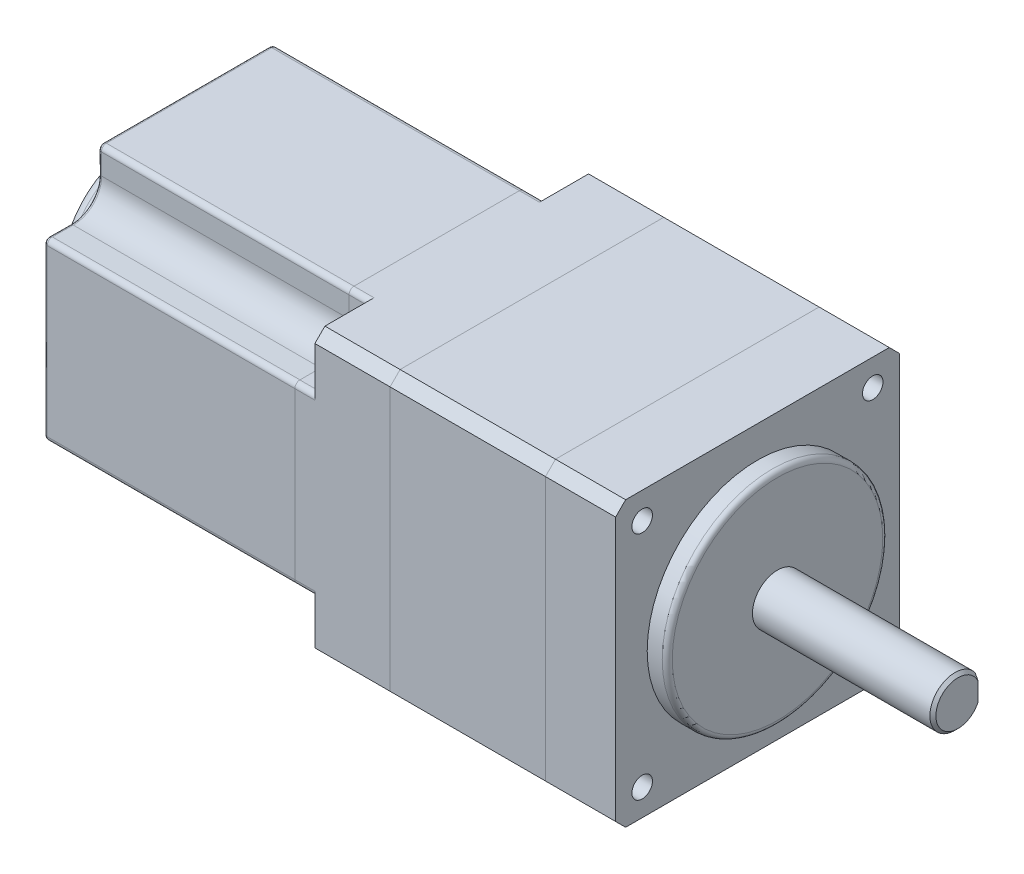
ISO-10303-21;
HEADER;
FILE_DESCRIPTION(('STEP AP214'),'2;1');
FILE_NAME('part.step','',(''),(''),'','','');
FILE_SCHEMA(('AUTOMOTIVE_DESIGN { 1 0 10303 214 1 1 1 1 }'));
ENDSEC;
DATA;
#1=APPLICATION_CONTEXT('core data for automotive mechanical design processes');
#2=APPLICATION_PROTOCOL_DEFINITION('international standard','automotive_design',2000,#1);
#3=PRODUCT_CONTEXT('',#1,'mechanical');
#4=PRODUCT('Part','Part','',(#3));
#5=PRODUCT_RELATED_PRODUCT_CATEGORY('part','',(#4));
#6=PRODUCT_DEFINITION_FORMATION('','',#4);
#7=PRODUCT_DEFINITION_CONTEXT('part definition',#1,'design');
#8=PRODUCT_DEFINITION('design','',#6,#7);
#9=PRODUCT_DEFINITION_SHAPE('','',#8);
#10=(LENGTH_UNIT() NAMED_UNIT(*) SI_UNIT(.MILLI.,.METRE.));
#11=(NAMED_UNIT(*) PLANE_ANGLE_UNIT() SI_UNIT($,.RADIAN.));
#12=(NAMED_UNIT(*) SI_UNIT($,.STERADIAN.) SOLID_ANGLE_UNIT());
#13=UNCERTAINTY_MEASURE_WITH_UNIT(LENGTH_MEASURE(1.E-05),#10,'distance_accuracy_value','');
#14=(GEOMETRIC_REPRESENTATION_CONTEXT(3) GLOBAL_UNCERTAINTY_ASSIGNED_CONTEXT((#13)) GLOBAL_UNIT_ASSIGNED_CONTEXT((#10,
#11,#12)) REPRESENTATION_CONTEXT('',''));
#15=CARTESIAN_POINT('',(0.,0.,0.));
#16=DIRECTION('',(0.,0.,1.));
#17=DIRECTION('',(1.,0.,0.));
#18=AXIS2_PLACEMENT_3D('',#15,#16,#17);
#19=CARTESIAN_POINT('',(-57.,0.,0.));
#20=DIRECTION('',(-1.,0.,0.));
#21=DIRECTION('',(0.,0.,1.));
#22=AXIS2_PLACEMENT_3D('',#19,#20,#21);
#23=PLANE('',#22);
#24=CARTESIAN_POINT('',(-57.,-8.25,-13.65));
#25=DIRECTION('',(-1.,0.,0.));
#26=DIRECTION('',(0.,0.,1.));
#27=AXIS2_PLACEMENT_3D('',#24,#25,#26);
#28=CIRCLE('',#27,0.2);
#29=CARTESIAN_POINT('',(-57.,-8.25,-13.85));
#30=VERTEX_POINT('',#29);
#31=CARTESIAN_POINT('',(-57.,-8.4499357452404,-13.6449307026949));
#32=VERTEX_POINT('',#31);
#33=EDGE_CURVE('E493',#30,#32,#28,.T.);
#34=ORIENTED_EDGE('',*,*,#33,.T.);
#35=DIRECTION('',(0.,0.00879604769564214,0.999961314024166));
#36=VECTOR('',#35,1.);
#37=CARTESIAN_POINT('',(-57.,-8.431583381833,-11.5585785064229));
#38=LINE('',#37,#36);
#39=CARTESIAN_POINT('',(-57.,-8.43159804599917,-11.5602455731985));
#40=VERTEX_POINT('',#39);
#41=EDGE_CURVE('E495',#32,#40,#38,.T.);
#42=ORIENTED_EDGE('',*,*,#41,.T.);
#43=CARTESIAN_POINT('',(-57.,-11.5,-11.5));
#44=DIRECTION('',(-1.,0.,0.));
#45=DIRECTION('',(0.,0.,1.));
#46=AXIS2_PLACEMENT_3D('',#43,#44,#45);
#47=CIRCLE('',#46,3.06899333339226);
#48=CARTESIAN_POINT('',(-57.,-8.91095106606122,-9.85210871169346));
#49=VERTEX_POINT('',#48);
#50=EDGE_CURVE('E306',#40,#49,#47,.F.);
#51=ORIENTED_EDGE('',*,*,#50,.T.);
#52=CARTESIAN_POINT('',(-57.,-11.45,-11.45));
#53=DIRECTION('',(-1.,0.,0.));
#54=DIRECTION('',(0.,0.,1.));
#55=AXIS2_PLACEMENT_3D('',#52,#53,#54);
#56=CIRCLE('',#55,3.);
#57=CARTESIAN_POINT('',(-57.,-9.8506729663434,-8.91186031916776));
#58=VERTEX_POINT('',#57);
#59=EDGE_CURVE('E447',#49,#58,#56,.F.);
#60=ORIENTED_EDGE('',*,*,#59,.T.);
#61=CARTESIAN_POINT('',(-57.,-11.5,-11.5));
#62=DIRECTION('',(-1.,0.,0.));
#63=DIRECTION('',(0.,0.,1.));
#64=AXIS2_PLACEMENT_3D('',#61,#62,#63);
#65=CIRCLE('',#64,3.06899333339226);
#66=CARTESIAN_POINT('',(-57.,-11.825224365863,-8.44828749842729));
#67=VERTEX_POINT('',#66);
#68=EDGE_CURVE('E449',#58,#67,#65,.F.);
#69=ORIENTED_EDGE('',*,*,#68,.T.);
#70=DIRECTION('',(0.,0.999999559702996,0.000938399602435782));
#71=VECTOR('',#70,1.);
#72=CARTESIAN_POINT('',(-57.,0.00791745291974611,-8.43718327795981));
#73=LINE('',#72,#71);
#74=CARTESIAN_POINT('',(-57.,-13.650000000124,-8.44999986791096));
#75=VERTEX_POINT('',#74);
#76=EDGE_CURVE('E451',#67,#75,#73,.F.);
#77=ORIENTED_EDGE('',*,*,#76,.T.);
#78=CARTESIAN_POINT('',(-57.,-13.65,-8.25));
#79=DIRECTION('',(-1.,0.,0.));
#80=DIRECTION('',(0.,0.,1.));
#81=AXIS2_PLACEMENT_3D('',#78,#79,#80);
#82=CIRCLE('',#81,0.2);
#83=CARTESIAN_POINT('',(-57.,-13.85,-8.24999999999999));
#84=VERTEX_POINT('',#83);
#85=EDGE_CURVE('E453',#75,#84,#82,.T.);
#86=ORIENTED_EDGE('',*,*,#85,.T.);
#87=DIRECTION('',(0.,0.,1.));
#88=VECTOR('',#87,1.);
#89=CARTESIAN_POINT('',(-57.,-13.85,8.25));
#90=LINE('',#89,#88);
#91=CARTESIAN_POINT('',(-57.,-13.85,8.25));
#92=VERTEX_POINT('',#91);
#93=EDGE_CURVE('E455',#84,#92,#90,.T.);
#94=ORIENTED_EDGE('',*,*,#93,.T.);
#95=CARTESIAN_POINT('',(-57.,-13.65,8.25));
#96=DIRECTION('',(-1.,0.,0.));
#97=DIRECTION('',(0.,0.,1.));
#98=AXIS2_PLACEMENT_3D('',#95,#96,#97);
#99=CIRCLE('',#98,0.2);
#100=CARTESIAN_POINT('',(-57.,-13.6511195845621,8.44999686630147));
#101=VERTEX_POINT('',#100);
#102=EDGE_CURVE('E457',#92,#101,#99,.T.);
#103=ORIENTED_EDGE('',*,*,#102,.T.);
#104=DIRECTION('',(0.,-0.999953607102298,0.00963242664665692));
#105=VECTOR('',#104,1.);
#106=CARTESIAN_POINT('',(-57.,0.0801235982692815,8.3177255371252));
#107=LINE('',#106,#105);
#108=CARTESIAN_POINT('',(-57.,-11.5576722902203,8.42983095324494));
#109=VERTEX_POINT('',#108);
#110=EDGE_CURVE('E459',#101,#109,#107,.F.);
#111=ORIENTED_EDGE('',*,*,#110,.T.);
#112=CARTESIAN_POINT('',(-57.,-11.5,11.5));
#113=DIRECTION('',(-1.,0.,0.));
#114=DIRECTION('',(0.,0.,1.));
#115=AXIS2_PLACEMENT_3D('',#112,#113,#114);
#116=CIRCLE('',#115,3.07071067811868);
#117=CARTESIAN_POINT('',(-57.,-8.45000000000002,11.8560394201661));
#118=VERTEX_POINT('',#117);
#119=EDGE_CURVE('E461',#109,#118,#116,.F.);
#120=ORIENTED_EDGE('',*,*,#119,.T.);
#121=DIRECTION('',(0.,0.,1.));
#122=VECTOR('',#121,1.);
#123=CARTESIAN_POINT('',(-57.,-8.45000000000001,13.65));
#124=LINE('',#123,#122);
#125=CARTESIAN_POINT('',(-57.,-8.45000000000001,13.65));
#126=VERTEX_POINT('',#125);
#127=EDGE_CURVE('E463',#118,#126,#124,.T.);
#128=ORIENTED_EDGE('',*,*,#127,.T.);
#129=CARTESIAN_POINT('',(-57.,-8.25000000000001,13.65));
#130=DIRECTION('',(-1.,0.,0.));
#131=DIRECTION('',(0.,0.,1.));
#132=AXIS2_PLACEMENT_3D('',#129,#130,#131);
#133=CIRCLE('',#132,0.2);
#134=CARTESIAN_POINT('',(-57.,-8.25,13.85));
#135=VERTEX_POINT('',#134);
#136=EDGE_CURVE('E465',#126,#135,#133,.T.);
#137=ORIENTED_EDGE('',*,*,#136,.T.);
#138=DIRECTION('',(0.,1.,0.));
#139=VECTOR('',#138,1.);
#140=CARTESIAN_POINT('',(-57.,8.25,13.85));
#141=LINE('',#140,#139);
#142=CARTESIAN_POINT('',(-57.,8.25,13.85));
#143=VERTEX_POINT('',#142);
#144=EDGE_CURVE('E467',#135,#143,#141,.T.);
#145=ORIENTED_EDGE('',*,*,#144,.T.);
#146=CARTESIAN_POINT('',(-57.,8.25,13.65));
#147=DIRECTION('',(-1.,0.,0.));
#148=DIRECTION('',(0.,0.,1.));
#149=AXIS2_PLACEMENT_3D('',#146,#147,#148);
#150=CIRCLE('',#149,0.2);
#151=CARTESIAN_POINT('',(-57.,8.44993818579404,13.6450278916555));
#152=VERTEX_POINT('',#151);
#153=EDGE_CURVE('E469',#143,#152,#150,.T.);
#154=ORIENTED_EDGE('',*,*,#153,.T.);
#155=DIRECTION('',(0.,0.00963242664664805,0.999953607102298));
#156=VECTOR('',#155,1.);
#157=CARTESIAN_POINT('',(-57.,8.31772553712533,-0.080123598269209));
#158=LINE('',#157,#156);
#159=CARTESIAN_POINT('',(-57.,8.42983095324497,11.5576722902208));
#160=VERTEX_POINT('',#159);
#161=EDGE_CURVE('E471',#152,#160,#158,.F.);
#162=ORIENTED_EDGE('',*,*,#161,.T.);
#163=CARTESIAN_POINT('',(-57.,11.5,11.5));
#164=DIRECTION('',(-1.,0.,0.));
#165=DIRECTION('',(0.,0.,1.));
#166=AXIS2_PLACEMENT_3D('',#163,#164,#165);
#167=CIRCLE('',#166,3.07071067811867);
#168=CARTESIAN_POINT('',(-57.,11.5576722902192,8.42983095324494));
#169=VERTEX_POINT('',#168);
#170=EDGE_CURVE('E473',#160,#169,#167,.F.);
#171=ORIENTED_EDGE('',*,*,#170,.T.);
#172=DIRECTION('',(0.,0.999953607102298,0.00963242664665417));
#173=VECTOR('',#172,1.);
#174=CARTESIAN_POINT('',(-57.,13.652889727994,8.45001391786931));
#175=LINE('',#174,#173);
#176=CARTESIAN_POINT('',(-57.,13.6511195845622,8.44999686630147));
#177=VERTEX_POINT('',#176);
#178=EDGE_CURVE('E475',#169,#177,#175,.T.);
#179=ORIENTED_EDGE('',*,*,#178,.T.);
#180=CARTESIAN_POINT('',(-57.,13.65,8.25));
#181=DIRECTION('',(-1.,0.,0.));
#182=DIRECTION('',(0.,0.,1.));
#183=AXIS2_PLACEMENT_3D('',#180,#181,#182);
#184=CIRCLE('',#183,0.2);
#185=CARTESIAN_POINT('',(-57.,13.85,8.25));
#186=VERTEX_POINT('',#185);
#187=EDGE_CURVE('E477',#177,#186,#184,.T.);
#188=ORIENTED_EDGE('',*,*,#187,.T.);
#189=DIRECTION('',(0.,0.,-1.));
#190=VECTOR('',#189,1.);
#191=CARTESIAN_POINT('',(-57.,13.85,-8.25));
#192=LINE('',#191,#190);
#193=CARTESIAN_POINT('',(-57.,13.85,-8.25));
#194=VERTEX_POINT('',#193);
#195=EDGE_CURVE('E479',#186,#194,#192,.T.);
#196=ORIENTED_EDGE('',*,*,#195,.T.);
#197=CARTESIAN_POINT('',(-57.,13.65,-8.25));
#198=DIRECTION('',(-1.,0.,0.));
#199=DIRECTION('',(0.,0.,1.));
#200=AXIS2_PLACEMENT_3D('',#197,#198,#199);
#201=CIRCLE('',#200,0.2);
#202=CARTESIAN_POINT('',(-57.,13.65,-8.45));
#203=VERTEX_POINT('',#202);
#204=EDGE_CURVE('E481',#194,#203,#201,.T.);
#205=ORIENTED_EDGE('',*,*,#204,.T.);
#206=DIRECTION('',(0.,-1.,0.));
#207=VECTOR('',#206,1.);
#208=CARTESIAN_POINT('',(-57.,11.8381385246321,-8.45));
#209=LINE('',#208,#207);
#210=CARTESIAN_POINT('',(-57.,11.8560394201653,-8.45));
#211=VERTEX_POINT('',#210);
#212=EDGE_CURVE('E483',#203,#211,#209,.T.);
#213=ORIENTED_EDGE('',*,*,#212,.T.);
#214=CARTESIAN_POINT('',(-57.,11.5,-11.5));
#215=DIRECTION('',(-1.,0.,0.));
#216=DIRECTION('',(0.,0.,1.));
#217=AXIS2_PLACEMENT_3D('',#214,#215,#216);
#218=CIRCLE('',#217,3.07071067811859);
#219=CARTESIAN_POINT('',(-57.,8.42983095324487,-11.5576722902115));
#220=VERTEX_POINT('',#219);
#221=EDGE_CURVE('E485',#211,#220,#218,.F.);
#222=ORIENTED_EDGE('',*,*,#221,.T.);
#223=DIRECTION('',(0.,0.00963242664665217,-0.999953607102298));
#224=VECTOR('',#223,1.);
#225=CARTESIAN_POINT('',(-57.,8.44992113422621,-13.6432577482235));
#226=LINE('',#225,#224);
#227=CARTESIAN_POINT('',(-57.,8.44993818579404,-13.6450278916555));
#228=VERTEX_POINT('',#227);
#229=EDGE_CURVE('E487',#220,#228,#226,.T.);
#230=ORIENTED_EDGE('',*,*,#229,.T.);
#231=CARTESIAN_POINT('',(-57.,8.25,-13.65));
#232=DIRECTION('',(-1.,0.,0.));
#233=DIRECTION('',(0.,0.,1.));
#234=AXIS2_PLACEMENT_3D('',#231,#232,#233);
#235=CIRCLE('',#234,0.200000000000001);
#236=CARTESIAN_POINT('',(-57.,8.24999999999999,-13.85));
#237=VERTEX_POINT('',#236);
#238=EDGE_CURVE('E489',#228,#237,#235,.T.);
#239=ORIENTED_EDGE('',*,*,#238,.T.);
#240=DIRECTION('',(0.,-1.,0.));
#241=VECTOR('',#240,1.);
#242=CARTESIAN_POINT('',(-57.,-8.25,-13.85));
#243=LINE('',#242,#241);
#244=EDGE_CURVE('E491',#237,#30,#243,.T.);
#245=ORIENTED_EDGE('',*,*,#244,.T.);
#246=EDGE_LOOP('',(#34,#42,#51,#60,#69,#77,#86,#94,#103,#111,#120,#128,#137,#145,#154,#162,#171,
#179,#188,#196,#205,#213,#222,#230,#239,#245));
#247=FACE_BOUND('',#246,.T.);
#248=CARTESIAN_POINT('',(-57.,0.,0.));
#249=DIRECTION('',(-1.,0.,0.));
#250=DIRECTION('',(0.,0.,1.));
#251=AXIS2_PLACEMENT_3D('',#248,#249,#250);
#252=CIRCLE('',#251,8.);
#253=CARTESIAN_POINT('',(-57.,0.,8.));
#254=VERTEX_POINT('',#253);
#255=EDGE_CURVE('E557',#254,#254,#252,.T.);
#256=ORIENTED_EDGE('',*,*,#255,.F.);
#257=EDGE_LOOP('',(#256));
#258=FACE_BOUND('',#257,.T.);
#259=ADVANCED_FACE('F48',(#247,#258),#23,.T.);
#260=CARTESIAN_POINT('',(-57.,-11.5,-11.5));
#261=DIRECTION('',(1.,0.,0.));
#262=DIRECTION('',(0.,0.,-1.));
#263=AXIS2_PLACEMENT_3D('',#260,#261,#262);
#264=CYLINDRICAL_SURFACE('',#263,2.76899333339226);
#265=DIRECTION('',(1.,0.,0.));
#266=VECTOR('',#265,1.);
#267=CARTESIAN_POINT('',(-57.,-9.16485925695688,-10.0118999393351));
#268=LINE('',#267,#266);
#269=CARTESIAN_POINT('',(-56.7,-9.16485925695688,-10.0118999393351));
#270=VERTEX_POINT('',#269);
#271=CARTESIAN_POINT('',(-32.,-9.16485925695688,-10.0118999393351));
#272=VERTEX_POINT('',#271);
#273=EDGE_CURVE('E298',#270,#272,#268,.T.);
#274=ORIENTED_EDGE('',*,*,#273,.F.);
#275=CARTESIAN_POINT('',(-56.7,-11.5,-11.5));
#276=DIRECTION('',(-1.,0.,0.));
#277=DIRECTION('',(0.,0.,1.));
#278=AXIS2_PLACEMENT_3D('',#275,#276,#277);
#279=CIRCLE('',#278,2.76899333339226);
#280=CARTESIAN_POINT('',(-56.7,-8.73157177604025,-11.5559396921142));
#281=VERTEX_POINT('',#280);
#282=EDGE_CURVE('E547',#270,#281,#279,.T.);
#283=ORIENTED_EDGE('',*,*,#282,.T.);
#284=DIRECTION('',(1.,0.,0.));
#285=VECTOR('',#284,1.);
#286=CARTESIAN_POINT('',(-57.,-8.73157177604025,-11.5559396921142));
#287=LINE('',#286,#285);
#288=CARTESIAN_POINT('',(-32.,-8.73157177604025,-11.5559396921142));
#289=VERTEX_POINT('',#288);
#290=EDGE_CURVE('E320',#281,#289,#287,.T.);
#291=ORIENTED_EDGE('',*,*,#290,.T.);
#292=CARTESIAN_POINT('',(-32.,-11.5,-11.5));
#293=DIRECTION('',(-1.,0.,0.));
#294=DIRECTION('',(0.,0.,1.));
#295=AXIS2_PLACEMENT_3D('',#292,#293,#294);
#296=CIRCLE('',#295,2.76899333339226);
#297=EDGE_CURVE('E313',#272,#289,#296,.T.);
#298=ORIENTED_EDGE('',*,*,#297,.F.);
#299=EDGE_LOOP('',(#274,#283,#291,#298));
#300=FACE_BOUND('',#299,.T.);
#301=ADVANCED_FACE('F318',(#300),#264,.F.);
#302=CARTESIAN_POINT('',(-57.,-11.45,-11.45));
#303=DIRECTION('',(1.,0.,0.));
#304=DIRECTION('',(0.,0.,-1.));
#305=AXIS2_PLACEMENT_3D('',#302,#303,#304);
#306=CYLINDRICAL_SURFACE('',#305,2.7);
#307=DIRECTION('',(1.,0.,0.));
#308=VECTOR('',#307,1.);
#309=CARTESIAN_POINT('',(-57.,-10.0118999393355,-9.16485925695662));
#310=LINE('',#309,#308);
#311=CARTESIAN_POINT('',(-56.7,-10.0118999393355,-9.16485925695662));
#312=VERTEX_POINT('',#311);
#313=CARTESIAN_POINT('',(-32.,-10.0118999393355,-9.16485925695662));
#314=VERTEX_POINT('',#313);
#315=EDGE_CURVE('E307',#312,#314,#310,.T.);
#316=ORIENTED_EDGE('',*,*,#315,.F.);
#317=CARTESIAN_POINT('',(-56.7,-11.45,-11.45));
#318=DIRECTION('',(-1.,0.,0.));
#319=DIRECTION('',(0.,0.,1.));
#320=AXIS2_PLACEMENT_3D('',#317,#318,#319);
#321=CIRCLE('',#320,2.7);
#322=EDGE_CURVE('E63',#312,#270,#321,.T.);
#323=ORIENTED_EDGE('',*,*,#322,.T.);
#324=ORIENTED_EDGE('',*,*,#273,.T.);
#325=CARTESIAN_POINT('',(-32.,-11.45,-11.45));
#326=DIRECTION('',(-1.,0.,0.));
#327=DIRECTION('',(0.,0.,1.));
#328=AXIS2_PLACEMENT_3D('',#325,#326,#327);
#329=CIRCLE('',#328,2.7);
#330=EDGE_CURVE('E301',#272,#314,#329,.F.);
#331=ORIENTED_EDGE('',*,*,#330,.T.);
#332=EDGE_LOOP('',(#316,#323,#324,#331));
#333=FACE_BOUND('',#332,.T.);
#334=ADVANCED_FACE('F300',(#333),#306,.F.);
#335=DIRECTION('',(1.,0.,0.));
#336=VECTOR('',#335,1.);
#337=CARTESIAN_POINT('',(-57.,-11.8087360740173,-8.74827215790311));
#338=LINE('',#337,#336);
#339=CARTESIAN_POINT('',(-56.7,-11.8087360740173,-8.74827215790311));
#340=VERTEX_POINT('',#339);
#341=CARTESIAN_POINT('',(-32.,-11.8087360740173,-8.74827215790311));
#342=VERTEX_POINT('',#341);
#343=EDGE_CURVE('E443',#340,#342,#338,.T.);
#344=ORIENTED_EDGE('',*,*,#343,.F.);
#345=CARTESIAN_POINT('',(-56.7,-11.5,-11.5));
#346=DIRECTION('',(-1.,0.,0.));
#347=DIRECTION('',(0.,0.,1.));
#348=AXIS2_PLACEMENT_3D('',#345,#346,#347);
#349=CIRCLE('',#348,2.76899333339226);
#350=EDGE_CURVE('E71',#340,#312,#349,.T.);
#351=ORIENTED_EDGE('',*,*,#350,.T.);
#352=ORIENTED_EDGE('',*,*,#315,.T.);
#353=EDGE_CURVE('E316',#342,#314,#296,.T.);
#354=ORIENTED_EDGE('',*,*,#353,.F.);
#355=EDGE_LOOP('',(#344,#351,#352,#354));
#356=FACE_BOUND('',#355,.T.);
#357=ADVANCED_FACE('F762',(#356),#264,.F.);
#358=CARTESIAN_POINT('',(-57.,0.00819897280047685,-8.73718314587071));
#359=DIRECTION('',(0.,0.000938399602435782,-0.999999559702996));
#360=DIRECTION('',(0.,0.999999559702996,0.000938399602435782));
#361=AXIS2_PLACEMENT_3D('',#358,#359,#360);
#362=PLANE('',#361);
#363=DIRECTION('',(1.,0.,0.));
#364=VECTOR('',#363,1.);
#365=CARTESIAN_POINT('',(-57.,-13.65,-8.75));
#366=LINE('',#365,#364);
#367=CARTESIAN_POINT('',(-56.7,-13.65,-8.75));
#368=VERTEX_POINT('',#367);
#369=CARTESIAN_POINT('',(-32.,-13.65,-8.75));
#370=VERTEX_POINT('',#369);
#371=EDGE_CURVE('E441',#368,#370,#366,.T.);
#372=ORIENTED_EDGE('',*,*,#371,.F.);
#373=DIRECTION('',(0.,0.999999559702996,0.000938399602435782));
#374=VECTOR('',#373,1.);
#375=CARTESIAN_POINT('',(-56.7,0.00819897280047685,-8.73718314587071));
#376=LINE('',#375,#374);
#377=EDGE_CURVE('E543',#368,#340,#376,.T.);
#378=ORIENTED_EDGE('',*,*,#377,.T.);
#379=ORIENTED_EDGE('',*,*,#343,.T.);
#380=DIRECTION('',(0.,0.999999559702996,0.000938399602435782));
#381=VECTOR('',#380,1.);
#382=CARTESIAN_POINT('',(-32.,0.00819897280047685,-8.73718314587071));
#383=LINE('',#382,#381);
#384=EDGE_CURVE('E328',#370,#342,#383,.T.);
#385=ORIENTED_EDGE('',*,*,#384,.F.);
#386=EDGE_LOOP('',(#372,#378,#379,#385));
#387=FACE_BOUND('',#386,.T.);
#388=ADVANCED_FACE('F854',(#387),#362,.T.);
#389=CARTESIAN_POINT('',(-57.,-13.65,-8.25));
#390=DIRECTION('',(1.,0.,0.));
#391=DIRECTION('',(0.,0.,-1.));
#392=AXIS2_PLACEMENT_3D('',#389,#390,#391);
#393=CYLINDRICAL_SURFACE('',#392,0.5);
#394=DIRECTION('',(1.,0.,0.));
#395=VECTOR('',#394,1.);
#396=CARTESIAN_POINT('',(-57.,-14.15,-8.24999999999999));
#397=LINE('',#396,#395);
#398=CARTESIAN_POINT('',(-56.7,-14.15,-8.24999999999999));
#399=VERTEX_POINT('',#398);
#400=CARTESIAN_POINT('',(-32.,-14.15,-8.24999999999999));
#401=VERTEX_POINT('',#400);
#402=EDGE_CURVE('E439',#399,#401,#397,.T.);
#403=ORIENTED_EDGE('',*,*,#402,.F.);
#404=CARTESIAN_POINT('',(-56.7,-13.65,-8.25));
#405=DIRECTION('',(-1.,0.,0.));
#406=DIRECTION('',(0.,0.,1.));
#407=AXIS2_PLACEMENT_3D('',#404,#405,#406);
#408=CIRCLE('',#407,0.5);
#409=EDGE_CURVE('E541',#399,#368,#408,.F.);
#410=ORIENTED_EDGE('',*,*,#409,.T.);
#411=ORIENTED_EDGE('',*,*,#371,.T.);
#412=CARTESIAN_POINT('',(-32.,-13.65,-8.25));
#413=DIRECTION('',(-1.,0.,0.));
#414=DIRECTION('',(0.,0.,1.));
#415=AXIS2_PLACEMENT_3D('',#412,#413,#414);
#416=CIRCLE('',#415,0.5);
#417=EDGE_CURVE('E329',#370,#401,#416,.T.);
#418=ORIENTED_EDGE('',*,*,#417,.T.);
#419=EDGE_LOOP('',(#403,#410,#411,#418));
#420=FACE_BOUND('',#419,.T.);
#421=ADVANCED_FACE('F850',(#420),#393,.T.);
#422=CARTESIAN_POINT('',(-57.,-14.15,0.));
#423=DIRECTION('',(0.,1.,0.));
#424=DIRECTION('',(0.,0.,1.));
#425=AXIS2_PLACEMENT_3D('',#422,#423,#424);
#426=PLANE('',#425);
#427=DIRECTION('',(1.,0.,0.));
#428=VECTOR('',#427,1.);
#429=CARTESIAN_POINT('',(-57.,-14.15,8.25));
#430=LINE('',#429,#428);
#431=CARTESIAN_POINT('',(-56.7,-14.15,8.25));
#432=VERTEX_POINT('',#431);
#433=CARTESIAN_POINT('',(-32.,-14.15,8.25));
#434=VERTEX_POINT('',#433);
#435=EDGE_CURVE('E437',#432,#434,#430,.T.);
#436=ORIENTED_EDGE('',*,*,#435,.F.);
#437=DIRECTION('',(0.,0.,1.));
#438=VECTOR('',#437,1.);
#439=CARTESIAN_POINT('',(-56.7,-14.15,-8.24999999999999));
#440=LINE('',#439,#438);
#441=EDGE_CURVE('E539',#432,#399,#440,.F.);
#442=ORIENTED_EDGE('',*,*,#441,.T.);
#443=ORIENTED_EDGE('',*,*,#402,.T.);
#444=DIRECTION('',(0.,0.,1.));
#445=VECTOR('',#444,1.);
#446=CARTESIAN_POINT('',(-32.,-14.15,0.));
#447=LINE('',#446,#445);
#448=EDGE_CURVE('E334',#401,#434,#447,.T.);
#449=ORIENTED_EDGE('',*,*,#448,.T.);
#450=EDGE_LOOP('',(#436,#442,#443,#449));
#451=FACE_BOUND('',#450,.T.);
#452=ADVANCED_FACE('F846',(#451),#426,.F.);
#453=CARTESIAN_POINT('',(-57.,-13.65,8.25));
#454=DIRECTION('',(1.,0.,0.));
#455=DIRECTION('',(0.,0.,-1.));
#456=AXIS2_PLACEMENT_3D('',#453,#454,#455);
#457=CYLINDRICAL_SURFACE('',#456,0.5);
#458=DIRECTION('',(1.,0.,0.));
#459=VECTOR('',#458,1.);
#460=CARTESIAN_POINT('',(-57.,-13.65,8.75));
#461=LINE('',#460,#459);
#462=CARTESIAN_POINT('',(-56.7,-13.65,8.75));
#463=VERTEX_POINT('',#462);
#464=CARTESIAN_POINT('',(-32.,-13.65,8.75));
#465=VERTEX_POINT('',#464);
#466=EDGE_CURVE('E435',#463,#465,#461,.T.);
#467=ORIENTED_EDGE('',*,*,#466,.F.);
#468=CARTESIAN_POINT('',(-56.7,-13.65,8.25));
#469=DIRECTION('',(-1.,0.,0.));
#470=DIRECTION('',(0.,0.,1.));
#471=AXIS2_PLACEMENT_3D('',#468,#469,#470);
#472=CIRCLE('',#471,0.5);
#473=EDGE_CURVE('E537',#463,#432,#472,.F.);
#474=ORIENTED_EDGE('',*,*,#473,.T.);
#475=ORIENTED_EDGE('',*,*,#435,.T.);
#476=CARTESIAN_POINT('',(-32.,-13.65,8.25));
#477=DIRECTION('',(-1.,0.,0.));
#478=DIRECTION('',(0.,0.,1.));
#479=AXIS2_PLACEMENT_3D('',#476,#477,#478);
#480=CIRCLE('',#479,0.5);
#481=EDGE_CURVE('E339',#434,#465,#480,.T.);
#482=ORIENTED_EDGE('',*,*,#481,.T.);
#483=EDGE_LOOP('',(#467,#474,#475,#482));
#484=FACE_BOUND('',#483,.T.);
#485=ADVANCED_FACE('F842',(#484),#457,.T.);
#486=CARTESIAN_POINT('',(-57.,0.0830133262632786,8.61771161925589));
#487=DIRECTION('',(0.,0.00963242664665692,0.999953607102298));
#488=DIRECTION('',(0.,-0.999953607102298,0.00963242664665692));
#489=AXIS2_PLACEMENT_3D('',#486,#487,#488);
#490=PLANE('',#489);
#491=DIRECTION('',(1.,0.,0.));
#492=VECTOR('',#491,1.);
#493=CARTESIAN_POINT('',(-57.,-11.5533748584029,8.72980347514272));
#494=LINE('',#493,#492);
#495=CARTESIAN_POINT('',(-56.7,-11.5533748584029,8.72980347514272));
#496=VERTEX_POINT('',#495);
#497=CARTESIAN_POINT('',(-32.,-11.5533748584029,8.72980347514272));
#498=VERTEX_POINT('',#497);
#499=EDGE_CURVE('E433',#496,#498,#494,.T.);
#500=ORIENTED_EDGE('',*,*,#499,.F.);
#501=DIRECTION('',(0.,-0.999953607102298,0.00963242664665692));
#502=VECTOR('',#501,1.);
#503=CARTESIAN_POINT('',(-56.7,0.0830133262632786,8.61771161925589));
#504=LINE('',#503,#502);
#505=EDGE_CURVE('E535',#496,#463,#504,.T.);
#506=ORIENTED_EDGE('',*,*,#505,.T.);
#507=ORIENTED_EDGE('',*,*,#466,.T.);
#508=DIRECTION('',(0.,-0.999953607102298,0.00963242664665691));
#509=VECTOR('',#508,1.);
#510=CARTESIAN_POINT('',(-32.,0.0830133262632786,8.61771161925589));
#511=LINE('',#510,#509);
#512=EDGE_CURVE('E342',#498,#465,#511,.T.);
#513=ORIENTED_EDGE('',*,*,#512,.F.);
#514=EDGE_LOOP('',(#500,#506,#507,#513));
#515=FACE_BOUND('',#514,.T.);
#516=ADVANCED_FACE('F838',(#515),#490,.T.);
#517=CARTESIAN_POINT('',(-57.,-11.5,11.5));
#518=DIRECTION('',(1.,0.,0.));
#519=DIRECTION('',(0.,0.,-1.));
#520=AXIS2_PLACEMENT_3D('',#517,#518,#519);
#521=CYLINDRICAL_SURFACE('',#520,2.77071067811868);
#522=DIRECTION('',(1.,0.,0.));
#523=VECTOR('',#522,1.);
#524=CARTESIAN_POINT('',(-57.,-8.75000000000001,11.8381385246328));
#525=LINE('',#524,#523);
#526=CARTESIAN_POINT('',(-56.7,-8.75000000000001,11.8381385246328));
#527=VERTEX_POINT('',#526);
#528=CARTESIAN_POINT('',(-32.,-8.75000000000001,11.8381385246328));
#529=VERTEX_POINT('',#528);
#530=EDGE_CURVE('E431',#527,#529,#525,.T.);
#531=ORIENTED_EDGE('',*,*,#530,.F.);
#532=CARTESIAN_POINT('',(-56.7,-11.5,11.5));
#533=DIRECTION('',(-1.,0.,0.));
#534=DIRECTION('',(0.,0.,1.));
#535=AXIS2_PLACEMENT_3D('',#532,#533,#534);
#536=CIRCLE('',#535,2.77071067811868);
#537=EDGE_CURVE('E533',#527,#496,#536,.T.);
#538=ORIENTED_EDGE('',*,*,#537,.T.);
#539=ORIENTED_EDGE('',*,*,#499,.T.);
#540=CARTESIAN_POINT('',(-32.,-11.5,11.5));
#541=DIRECTION('',(-1.,0.,0.));
#542=DIRECTION('',(0.,0.,1.));
#543=AXIS2_PLACEMENT_3D('',#540,#541,#542);
#544=CIRCLE('',#543,2.77071067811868);
#545=EDGE_CURVE('E345',#529,#498,#544,.T.);
#546=ORIENTED_EDGE('',*,*,#545,.F.);
#547=EDGE_LOOP('',(#531,#538,#539,#546));
#548=FACE_BOUND('',#547,.T.);
#549=ADVANCED_FACE('F834',(#548),#521,.F.);
#550=CARTESIAN_POINT('',(-57.,-8.75000000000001,0.));
#551=DIRECTION('',(0.,1.,0.));
#552=DIRECTION('',(0.,0.,1.));
#553=AXIS2_PLACEMENT_3D('',#550,#551,#552);
#554=PLANE('',#553);
#555=DIRECTION('',(1.,0.,0.));
#556=VECTOR('',#555,1.);
#557=CARTESIAN_POINT('',(-57.,-8.75000000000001,13.65));
#558=LINE('',#557,#556);
#559=CARTESIAN_POINT('',(-56.7,-8.75000000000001,13.65));
#560=VERTEX_POINT('',#559);
#561=CARTESIAN_POINT('',(-32.,-8.75000000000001,13.65));
#562=VERTEX_POINT('',#561);
#563=EDGE_CURVE('E429',#560,#562,#558,.T.);
#564=ORIENTED_EDGE('',*,*,#563,.F.);
#565=DIRECTION('',(0.,0.,1.));
#566=VECTOR('',#565,1.);
#567=CARTESIAN_POINT('',(-56.7,-8.75000000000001,11.8381385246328));
#568=LINE('',#567,#566);
#569=EDGE_CURVE('E531',#560,#527,#568,.F.);
#570=ORIENTED_EDGE('',*,*,#569,.T.);
#571=ORIENTED_EDGE('',*,*,#530,.T.);
#572=DIRECTION('',(0.,0.,1.));
#573=VECTOR('',#572,1.);
#574=CARTESIAN_POINT('',(-32.,-8.75000000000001,0.));
#575=LINE('',#574,#573);
#576=EDGE_CURVE('E348',#529,#562,#575,.T.);
#577=ORIENTED_EDGE('',*,*,#576,.T.);
#578=EDGE_LOOP('',(#564,#570,#571,#577));
#579=FACE_BOUND('',#578,.T.);
#580=ADVANCED_FACE('F830',(#579),#554,.F.);
#581=CARTESIAN_POINT('',(-57.,-8.25000000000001,13.65));
#582=DIRECTION('',(1.,0.,0.));
#583=DIRECTION('',(0.,0.,-1.));
#584=AXIS2_PLACEMENT_3D('',#581,#582,#583);
#585=CYLINDRICAL_SURFACE('',#584,0.5);
#586=DIRECTION('',(1.,0.,0.));
#587=VECTOR('',#586,1.);
#588=CARTESIAN_POINT('',(-57.,-8.25,14.15));
#589=LINE('',#588,#587);
#590=CARTESIAN_POINT('',(-56.7,-8.25,14.15));
#591=VERTEX_POINT('',#590);
#592=CARTESIAN_POINT('',(-32.,-8.25,14.15));
#593=VERTEX_POINT('',#592);
#594=EDGE_CURVE('E427',#591,#593,#589,.T.);
#595=ORIENTED_EDGE('',*,*,#594,.F.);
#596=CARTESIAN_POINT('',(-56.7,-8.25000000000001,13.65));
#597=DIRECTION('',(-1.,0.,0.));
#598=DIRECTION('',(0.,0.,1.));
#599=AXIS2_PLACEMENT_3D('',#596,#597,#598);
#600=CIRCLE('',#599,0.5);
#601=EDGE_CURVE('E529',#591,#560,#600,.F.);
#602=ORIENTED_EDGE('',*,*,#601,.T.);
#603=ORIENTED_EDGE('',*,*,#563,.T.);
#604=CARTESIAN_POINT('',(-32.,-8.25000000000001,13.65));
#605=DIRECTION('',(-1.,0.,0.));
#606=DIRECTION('',(0.,0.,1.));
#607=AXIS2_PLACEMENT_3D('',#604,#605,#606);
#608=CIRCLE('',#607,0.5);
#609=EDGE_CURVE('E351',#562,#593,#608,.T.);
#610=ORIENTED_EDGE('',*,*,#609,.T.);
#611=EDGE_LOOP('',(#595,#602,#603,#610));
#612=FACE_BOUND('',#611,.T.);
#613=ADVANCED_FACE('F826',(#612),#585,.T.);
#614=CARTESIAN_POINT('',(-57.,0.,14.15));
#615=DIRECTION('',(0.,0.,-1.));
#616=DIRECTION('',(0.,1.,0.));
#617=AXIS2_PLACEMENT_3D('',#614,#615,#616);
#618=PLANE('',#617);
#619=DIRECTION('',(1.,0.,0.));
#620=VECTOR('',#619,1.);
#621=CARTESIAN_POINT('',(-57.,8.25,14.15));
#622=LINE('',#621,#620);
#623=CARTESIAN_POINT('',(-56.7,8.25,14.15));
#624=VERTEX_POINT('',#623);
#625=CARTESIAN_POINT('',(-32.,8.25,14.15));
#626=VERTEX_POINT('',#625);
#627=EDGE_CURVE('E425',#624,#626,#622,.T.);
#628=ORIENTED_EDGE('',*,*,#627,.F.);
#629=DIRECTION('',(0.,1.,0.));
#630=VECTOR('',#629,1.);
#631=CARTESIAN_POINT('',(-56.7,-8.25,14.15));
#632=LINE('',#631,#630);
#633=EDGE_CURVE('E527',#624,#591,#632,.F.);
#634=ORIENTED_EDGE('',*,*,#633,.T.);
#635=ORIENTED_EDGE('',*,*,#594,.T.);
#636=DIRECTION('',(0.,1.,0.));
#637=VECTOR('',#636,1.);
#638=CARTESIAN_POINT('',(-32.,0.,14.15));
#639=LINE('',#638,#637);
#640=EDGE_CURVE('E354',#593,#626,#639,.T.);
#641=ORIENTED_EDGE('',*,*,#640,.T.);
#642=EDGE_LOOP('',(#628,#634,#635,#641));
#643=FACE_BOUND('',#642,.T.);
#644=ADVANCED_FACE('F822',(#643),#618,.F.);
#645=CARTESIAN_POINT('',(-57.,8.25,13.65));
#646=DIRECTION('',(1.,0.,0.));
#647=DIRECTION('',(0.,0.,-1.));
#648=AXIS2_PLACEMENT_3D('',#645,#646,#647);
#649=CYLINDRICAL_SURFACE('',#648,0.5);
#650=DIRECTION('',(1.,0.,0.));
#651=VECTOR('',#650,1.);
#652=CARTESIAN_POINT('',(-57.,8.7499072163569,13.6403680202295));
#653=LINE('',#652,#651);
#654=CARTESIAN_POINT('',(-56.7,8.7499072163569,13.6403680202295));
#655=VERTEX_POINT('',#654);
#656=CARTESIAN_POINT('',(-32.,8.7499072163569,13.6403680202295));
#657=VERTEX_POINT('',#656);
#658=EDGE_CURVE('E423',#655,#657,#653,.T.);
#659=ORIENTED_EDGE('',*,*,#658,.F.);
#660=CARTESIAN_POINT('',(-56.7,8.25,13.65));
#661=DIRECTION('',(-1.,0.,0.));
#662=DIRECTION('',(0.,0.,1.));
#663=AXIS2_PLACEMENT_3D('',#660,#661,#662);
#664=CIRCLE('',#663,0.5);
#665=EDGE_CURVE('E525',#655,#624,#664,.F.);
#666=ORIENTED_EDGE('',*,*,#665,.T.);
#667=ORIENTED_EDGE('',*,*,#627,.T.);
#668=CARTESIAN_POINT('',(-32.,8.25,13.65));
#669=DIRECTION('',(-1.,0.,0.));
#670=DIRECTION('',(0.,0.,1.));
#671=AXIS2_PLACEMENT_3D('',#668,#669,#670);
#672=CIRCLE('',#671,0.5);
#673=EDGE_CURVE('E357',#626,#657,#672,.T.);
#674=ORIENTED_EDGE('',*,*,#673,.T.);
#675=EDGE_LOOP('',(#659,#666,#667,#674));
#676=FACE_BOUND('',#675,.T.);
#677=ADVANCED_FACE('F818',(#676),#649,.T.);
#678=CARTESIAN_POINT('',(-57.,8.61771161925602,-0.0830133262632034));
#679=DIRECTION('',(0.,0.999953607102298,-0.00963242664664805));
#680=DIRECTION('',(0.,0.00963242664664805,0.999953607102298));
#681=AXIS2_PLACEMENT_3D('',#678,#679,#680);
#682=PLANE('',#681);
#683=DIRECTION('',(1.,0.,0.));
#684=VECTOR('',#683,1.);
#685=CARTESIAN_POINT('',(-57.,8.72980347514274,11.5533748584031));
#686=LINE('',#685,#684);
#687=CARTESIAN_POINT('',(-56.7,8.72980347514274,11.5533748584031));
#688=VERTEX_POINT('',#687);
#689=CARTESIAN_POINT('',(-32.,8.72980347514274,11.5533748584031));
#690=VERTEX_POINT('',#689);
#691=EDGE_CURVE('E421',#688,#690,#686,.T.);
#692=ORIENTED_EDGE('',*,*,#691,.F.);
#693=DIRECTION('',(0.,0.00963242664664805,0.999953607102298));
#694=VECTOR('',#693,1.);
#695=CARTESIAN_POINT('',(-56.7,8.61771161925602,-0.0830133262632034));
#696=LINE('',#695,#694);
#697=EDGE_CURVE('E523',#688,#655,#696,.T.);
#698=ORIENTED_EDGE('',*,*,#697,.T.);
#699=ORIENTED_EDGE('',*,*,#658,.T.);
#700=DIRECTION('',(0.,0.00963242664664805,0.999953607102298));
#701=VECTOR('',#700,1.);
#702=CARTESIAN_POINT('',(-32.,8.61771161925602,-0.0830133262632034));
#703=LINE('',#702,#701);
#704=EDGE_CURVE('E360',#690,#657,#703,.T.);
#705=ORIENTED_EDGE('',*,*,#704,.F.);
#706=EDGE_LOOP('',(#692,#698,#699,#705));
#707=FACE_BOUND('',#706,.T.);
#708=ADVANCED_FACE('F814',(#707),#682,.T.);
#709=CARTESIAN_POINT('',(-57.,11.5,11.5));
#710=DIRECTION('',(1.,0.,0.));
#711=DIRECTION('',(0.,0.,-1.));
#712=AXIS2_PLACEMENT_3D('',#709,#710,#711);
#713=CYLINDRICAL_SURFACE('',#712,2.77071067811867);
#714=DIRECTION('',(1.,0.,0.));
#715=VECTOR('',#714,1.);
#716=CARTESIAN_POINT('',(-57.,11.5533748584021,8.72980347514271));
#717=LINE('',#716,#715);
#718=CARTESIAN_POINT('',(-56.7,11.5533748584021,8.72980347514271));
#719=VERTEX_POINT('',#718);
#720=CARTESIAN_POINT('',(-32.,11.5533748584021,8.72980347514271));
#721=VERTEX_POINT('',#720);
#722=EDGE_CURVE('E419',#719,#721,#717,.T.);
#723=ORIENTED_EDGE('',*,*,#722,.F.);
#724=CARTESIAN_POINT('',(-56.7,11.5,11.5));
#725=DIRECTION('',(-1.,0.,0.));
#726=DIRECTION('',(0.,0.,1.));
#727=AXIS2_PLACEMENT_3D('',#724,#725,#726);
#728=CIRCLE('',#727,2.77071067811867);
#729=EDGE_CURVE('E521',#719,#688,#728,.T.);
#730=ORIENTED_EDGE('',*,*,#729,.T.);
#731=ORIENTED_EDGE('',*,*,#691,.T.);
#732=CARTESIAN_POINT('',(-32.,11.5,11.5));
#733=DIRECTION('',(-1.,0.,0.));
#734=DIRECTION('',(0.,0.,1.));
#735=AXIS2_PLACEMENT_3D('',#732,#733,#734);
#736=CIRCLE('',#735,2.77071067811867);
#737=EDGE_CURVE('E363',#721,#690,#736,.T.);
#738=ORIENTED_EDGE('',*,*,#737,.F.);
#739=EDGE_LOOP('',(#723,#730,#731,#738));
#740=FACE_BOUND('',#739,.T.);
#741=ADVANCED_FACE('F810',(#740),#713,.F.);
#742=CARTESIAN_POINT('',(-57.,-0.0830133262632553,8.61771161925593));
#743=DIRECTION('',(0.,0.00963242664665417,-0.999953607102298));
#744=DIRECTION('',(0.,0.999953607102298,0.00963242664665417));
#745=AXIS2_PLACEMENT_3D('',#742,#743,#744);
#746=PLANE('',#745);
#747=DIRECTION('',(1.,0.,0.));
#748=VECTOR('',#747,1.);
#749=CARTESIAN_POINT('',(-57.,13.65,8.75));
#750=LINE('',#749,#748);
#751=CARTESIAN_POINT('',(-56.7,13.65,8.75));
#752=VERTEX_POINT('',#751);
#753=CARTESIAN_POINT('',(-32.,13.65,8.75));
#754=VERTEX_POINT('',#753);
#755=EDGE_CURVE('E417',#752,#754,#750,.T.);
#756=ORIENTED_EDGE('',*,*,#755,.F.);
#757=DIRECTION('',(0.,0.999953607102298,0.00963242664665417));
#758=VECTOR('',#757,1.);
#759=CARTESIAN_POINT('',(-56.7,11.5533748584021,8.72980347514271));
#760=LINE('',#759,#758);
#761=EDGE_CURVE('E519',#752,#719,#760,.F.);
#762=ORIENTED_EDGE('',*,*,#761,.T.);
#763=ORIENTED_EDGE('',*,*,#722,.T.);
#764=DIRECTION('',(0.,0.999953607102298,0.00963242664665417));
#765=VECTOR('',#764,1.);
#766=CARTESIAN_POINT('',(-32.,-0.0830133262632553,8.61771161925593));
#767=LINE('',#766,#765);
#768=EDGE_CURVE('E366',#721,#754,#767,.T.);
#769=ORIENTED_EDGE('',*,*,#768,.T.);
#770=EDGE_LOOP('',(#756,#762,#763,#769));
#771=FACE_BOUND('',#770,.T.);
#772=ADVANCED_FACE('F806',(#771),#746,.F.);
#773=CARTESIAN_POINT('',(-57.,13.65,8.25));
#774=DIRECTION('',(1.,0.,0.));
#775=DIRECTION('',(0.,0.,-1.));
#776=AXIS2_PLACEMENT_3D('',#773,#774,#775);
#777=CYLINDRICAL_SURFACE('',#776,0.5);
#778=DIRECTION('',(1.,0.,0.));
#779=VECTOR('',#778,1.);
#780=CARTESIAN_POINT('',(-57.,14.15,8.25));
#781=LINE('',#780,#779);
#782=CARTESIAN_POINT('',(-56.7,14.15,8.25));
#783=VERTEX_POINT('',#782);
#784=CARTESIAN_POINT('',(-32.,14.15,8.25));
#785=VERTEX_POINT('',#784);
#786=EDGE_CURVE('E415',#783,#785,#781,.T.);
#787=ORIENTED_EDGE('',*,*,#786,.F.);
#788=CARTESIAN_POINT('',(-56.7,13.65,8.25));
#789=DIRECTION('',(-1.,0.,0.));
#790=DIRECTION('',(0.,0.,1.));
#791=AXIS2_PLACEMENT_3D('',#788,#789,#790);
#792=CIRCLE('',#791,0.5);
#793=EDGE_CURVE('E517',#783,#752,#792,.F.);
#794=ORIENTED_EDGE('',*,*,#793,.T.);
#795=ORIENTED_EDGE('',*,*,#755,.T.);
#796=CARTESIAN_POINT('',(-32.,13.65,8.25));
#797=DIRECTION('',(-1.,0.,0.));
#798=DIRECTION('',(0.,0.,1.));
#799=AXIS2_PLACEMENT_3D('',#796,#797,#798);
#800=CIRCLE('',#799,0.5);
#801=EDGE_CURVE('E369',#754,#785,#800,.T.);
#802=ORIENTED_EDGE('',*,*,#801,.T.);
#803=EDGE_LOOP('',(#787,#794,#795,#802));
#804=FACE_BOUND('',#803,.T.);
#805=ADVANCED_FACE('F802',(#804),#777,.T.);
#806=CARTESIAN_POINT('',(-57.,14.15,0.));
#807=DIRECTION('',(0.,-1.,0.));
#808=DIRECTION('',(0.,0.,-1.));
#809=AXIS2_PLACEMENT_3D('',#806,#807,#808);
#810=PLANE('',#809);
#811=DIRECTION('',(1.,0.,0.));
#812=VECTOR('',#811,1.);
#813=CARTESIAN_POINT('',(-57.,14.15,-8.25));
#814=LINE('',#813,#812);
#815=CARTESIAN_POINT('',(-56.7,14.15,-8.25));
#816=VERTEX_POINT('',#815);
#817=CARTESIAN_POINT('',(-32.,14.15,-8.25));
#818=VERTEX_POINT('',#817);
#819=EDGE_CURVE('E413',#816,#818,#814,.T.);
#820=ORIENTED_EDGE('',*,*,#819,.F.);
#821=DIRECTION('',(0.,0.,-1.));
#822=VECTOR('',#821,1.);
#823=CARTESIAN_POINT('',(-56.7,14.15,8.25));
#824=LINE('',#823,#822);
#825=EDGE_CURVE('E515',#816,#783,#824,.F.);
#826=ORIENTED_EDGE('',*,*,#825,.T.);
#827=ORIENTED_EDGE('',*,*,#786,.T.);
#828=DIRECTION('',(0.,0.,-1.));
#829=VECTOR('',#828,1.);
#830=CARTESIAN_POINT('',(-32.,14.15,0.));
#831=LINE('',#830,#829);
#832=EDGE_CURVE('E372',#785,#818,#831,.T.);
#833=ORIENTED_EDGE('',*,*,#832,.T.);
#834=EDGE_LOOP('',(#820,#826,#827,#833));
#835=FACE_BOUND('',#834,.T.);
#836=ADVANCED_FACE('F798',(#835),#810,.F.);
#837=CARTESIAN_POINT('',(-57.,13.65,-8.25));
#838=DIRECTION('',(1.,0.,0.));
#839=DIRECTION('',(0.,0.,-1.));
#840=AXIS2_PLACEMENT_3D('',#837,#838,#839);
#841=CYLINDRICAL_SURFACE('',#840,0.5);
#842=DIRECTION('',(1.,0.,0.));
#843=VECTOR('',#842,1.);
#844=CARTESIAN_POINT('',(-57.,13.65,-8.75));
#845=LINE('',#844,#843);
#846=CARTESIAN_POINT('',(-56.7,13.65,-8.75));
#847=VERTEX_POINT('',#846);
#848=CARTESIAN_POINT('',(-32.,13.65,-8.75));
#849=VERTEX_POINT('',#848);
#850=EDGE_CURVE('E411',#847,#849,#845,.T.);
#851=ORIENTED_EDGE('',*,*,#850,.F.);
#852=CARTESIAN_POINT('',(-56.7,13.65,-8.25));
#853=DIRECTION('',(-1.,0.,0.));
#854=DIRECTION('',(0.,0.,1.));
#855=AXIS2_PLACEMENT_3D('',#852,#853,#854);
#856=CIRCLE('',#855,0.5);
#857=EDGE_CURVE('E513',#847,#816,#856,.F.);
#858=ORIENTED_EDGE('',*,*,#857,.T.);
#859=ORIENTED_EDGE('',*,*,#819,.T.);
#860=CARTESIAN_POINT('',(-32.,13.65,-8.25));
#861=DIRECTION('',(-1.,0.,0.));
#862=DIRECTION('',(0.,0.,1.));
#863=AXIS2_PLACEMENT_3D('',#860,#861,#862);
#864=CIRCLE('',#863,0.5);
#865=EDGE_CURVE('E375',#818,#849,#864,.T.);
#866=ORIENTED_EDGE('',*,*,#865,.T.);
#867=EDGE_LOOP('',(#851,#858,#859,#866));
#868=FACE_BOUND('',#867,.T.);
#869=ADVANCED_FACE('F794',(#868),#841,.T.);
#870=CARTESIAN_POINT('',(-57.,0.,-8.75000000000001));
#871=DIRECTION('',(0.,0.,1.));
#872=DIRECTION('',(0.,-1.,0.));
#873=AXIS2_PLACEMENT_3D('',#870,#871,#872);
#874=PLANE('',#873);
#875=DIRECTION('',(1.,0.,0.));
#876=VECTOR('',#875,1.);
#877=CARTESIAN_POINT('',(-57.,11.8381385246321,-8.75));
#878=LINE('',#877,#876);
#879=CARTESIAN_POINT('',(-56.7,11.8381385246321,-8.75));
#880=VERTEX_POINT('',#879);
#881=CARTESIAN_POINT('',(-32.,11.8381385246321,-8.75));
#882=VERTEX_POINT('',#881);
#883=EDGE_CURVE('E409',#880,#882,#878,.T.);
#884=ORIENTED_EDGE('',*,*,#883,.F.);
#885=DIRECTION('',(0.,-1.,0.));
#886=VECTOR('',#885,1.);
#887=CARTESIAN_POINT('',(-56.7,13.65,-8.75));
#888=LINE('',#887,#886);
#889=EDGE_CURVE('E511',#880,#847,#888,.F.);
#890=ORIENTED_EDGE('',*,*,#889,.T.);
#891=ORIENTED_EDGE('',*,*,#850,.T.);
#892=DIRECTION('',(0.,-1.,0.));
#893=VECTOR('',#892,1.);
#894=CARTESIAN_POINT('',(-32.,0.,-8.75000000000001));
#895=LINE('',#894,#893);
#896=EDGE_CURVE('E378',#849,#882,#895,.T.);
#897=ORIENTED_EDGE('',*,*,#896,.T.);
#898=EDGE_LOOP('',(#884,#890,#891,#897));
#899=FACE_BOUND('',#898,.T.);
#900=ADVANCED_FACE('F790',(#899),#874,.F.);
#901=CARTESIAN_POINT('',(-57.,11.5,-11.5));
#902=DIRECTION('',(1.,0.,0.));
#903=DIRECTION('',(0.,0.,-1.));
#904=AXIS2_PLACEMENT_3D('',#901,#902,#903);
#905=CYLINDRICAL_SURFACE('',#904,2.77071067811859);
#906=DIRECTION('',(1.,0.,0.));
#907=VECTOR('',#906,1.);
#908=CARTESIAN_POINT('',(-57.,8.72980347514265,-11.5533748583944));
#909=LINE('',#908,#907);
#910=CARTESIAN_POINT('',(-56.7,8.72980347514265,-11.5533748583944));
#911=VERTEX_POINT('',#910);
#912=CARTESIAN_POINT('',(-32.,8.72980347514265,-11.5533748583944));
#913=VERTEX_POINT('',#912);
#914=EDGE_CURVE('E407',#911,#913,#909,.T.);
#915=ORIENTED_EDGE('',*,*,#914,.F.);
#916=CARTESIAN_POINT('',(-56.7,11.5,-11.5));
#917=DIRECTION('',(-1.,0.,0.));
#918=DIRECTION('',(0.,0.,1.));
#919=AXIS2_PLACEMENT_3D('',#916,#917,#918);
#920=CIRCLE('',#919,2.77071067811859);
#921=EDGE_CURVE('E509',#911,#880,#920,.T.);
#922=ORIENTED_EDGE('',*,*,#921,.T.);
#923=ORIENTED_EDGE('',*,*,#883,.T.);
#924=CARTESIAN_POINT('',(-32.,11.5,-11.5));
#925=DIRECTION('',(-1.,0.,0.));
#926=DIRECTION('',(0.,0.,1.));
#927=AXIS2_PLACEMENT_3D('',#924,#925,#926);
#928=CIRCLE('',#927,2.77071067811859);
#929=EDGE_CURVE('E381',#913,#882,#928,.T.);
#930=ORIENTED_EDGE('',*,*,#929,.F.);
#931=EDGE_LOOP('',(#915,#922,#923,#930));
#932=FACE_BOUND('',#931,.T.);
#933=ADVANCED_FACE('F786',(#932),#905,.F.);
#934=CARTESIAN_POINT('',(-57.,8.61771161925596,0.0830133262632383));
#935=DIRECTION('',(0.,-0.999953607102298,-0.00963242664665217));
#936=DIRECTION('',(0.,0.00963242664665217,-0.999953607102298));
#937=AXIS2_PLACEMENT_3D('',#934,#935,#936);
#938=PLANE('',#937);
#939=DIRECTION('',(1.,0.,0.));
#940=VECTOR('',#939,1.);
#941=CARTESIAN_POINT('',(-57.,8.7499072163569,-13.6403680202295));
#942=LINE('',#941,#940);
#943=CARTESIAN_POINT('',(-56.7,8.7499072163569,-13.6403680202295));
#944=VERTEX_POINT('',#943);
#945=CARTESIAN_POINT('',(-32.,8.7499072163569,-13.6403680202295));
#946=VERTEX_POINT('',#945);
#947=EDGE_CURVE('E405',#944,#946,#942,.T.);
#948=ORIENTED_EDGE('',*,*,#947,.F.);
#949=DIRECTION('',(0.,0.00963242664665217,-0.999953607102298));
#950=VECTOR('',#949,1.);
#951=CARTESIAN_POINT('',(-56.7,8.72980347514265,-11.5533748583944));
#952=LINE('',#951,#950);
#953=EDGE_CURVE('E507',#944,#911,#952,.F.);
#954=ORIENTED_EDGE('',*,*,#953,.T.);
#955=ORIENTED_EDGE('',*,*,#914,.T.);
#956=DIRECTION('',(0.,0.00963242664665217,-0.999953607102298));
#957=VECTOR('',#956,1.);
#958=CARTESIAN_POINT('',(-32.,8.61771161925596,0.0830133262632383));
#959=LINE('',#958,#957);
#960=EDGE_CURVE('E384',#913,#946,#959,.T.);
#961=ORIENTED_EDGE('',*,*,#960,.T.);
#962=EDGE_LOOP('',(#948,#954,#955,#961));
#963=FACE_BOUND('',#962,.T.);
#964=ADVANCED_FACE('F782',(#963),#938,.F.);
#965=CARTESIAN_POINT('',(-57.,8.25,-13.65));
#966=DIRECTION('',(1.,0.,0.));
#967=DIRECTION('',(0.,0.,-1.));
#968=AXIS2_PLACEMENT_3D('',#965,#966,#967);
#969=CYLINDRICAL_SURFACE('',#968,0.500000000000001);
#970=DIRECTION('',(1.,0.,0.));
#971=VECTOR('',#970,1.);
#972=CARTESIAN_POINT('',(-57.,8.24999999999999,-14.15));
#973=LINE('',#972,#971);
#974=CARTESIAN_POINT('',(-56.7,8.24999999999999,-14.15));
#975=VERTEX_POINT('',#974);
#976=CARTESIAN_POINT('',(-32.,8.24999999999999,-14.15));
#977=VERTEX_POINT('',#976);
#978=EDGE_CURVE('E403',#975,#977,#973,.T.);
#979=ORIENTED_EDGE('',*,*,#978,.F.);
#980=CARTESIAN_POINT('',(-56.7,8.25,-13.65));
#981=DIRECTION('',(-1.,0.,0.));
#982=DIRECTION('',(0.,0.,1.));
#983=AXIS2_PLACEMENT_3D('',#980,#981,#982);
#984=CIRCLE('',#983,0.500000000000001);
#985=EDGE_CURVE('E505',#975,#944,#984,.F.);
#986=ORIENTED_EDGE('',*,*,#985,.T.);
#987=ORIENTED_EDGE('',*,*,#947,.T.);
#988=CARTESIAN_POINT('',(-32.,8.25,-13.65));
#989=DIRECTION('',(-1.,0.,0.));
#990=DIRECTION('',(0.,0.,1.));
#991=AXIS2_PLACEMENT_3D('',#988,#989,#990);
#992=CIRCLE('',#991,0.500000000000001);
#993=EDGE_CURVE('E387',#946,#977,#992,.T.);
#994=ORIENTED_EDGE('',*,*,#993,.T.);
#995=EDGE_LOOP('',(#979,#986,#987,#994));
#996=FACE_BOUND('',#995,.T.);
#997=ADVANCED_FACE('F778',(#996),#969,.T.);
#998=CARTESIAN_POINT('',(-57.,0.,-14.15));
#999=DIRECTION('',(0.,0.,1.));
#1000=DIRECTION('',(0.,-1.,0.));
#1001=AXIS2_PLACEMENT_3D('',#998,#999,#1000);
#1002=PLANE('',#1001);
#1003=DIRECTION('',(1.,0.,0.));
#1004=VECTOR('',#1003,1.);
#1005=CARTESIAN_POINT('',(-57.,-8.25,-14.15));
#1006=LINE('',#1005,#1004);
#1007=CARTESIAN_POINT('',(-56.7,-8.25,-14.15));
#1008=VERTEX_POINT('',#1007);
#1009=CARTESIAN_POINT('',(-32.,-8.25,-14.15));
#1010=VERTEX_POINT('',#1009);
#1011=EDGE_CURVE('E401',#1008,#1010,#1006,.T.);
#1012=ORIENTED_EDGE('',*,*,#1011,.F.);
#1013=DIRECTION('',(0.,-1.,0.));
#1014=VECTOR('',#1013,1.);
#1015=CARTESIAN_POINT('',(-56.7,8.24999999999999,-14.15));
#1016=LINE('',#1015,#1014);
#1017=EDGE_CURVE('E503',#1008,#975,#1016,.F.);
#1018=ORIENTED_EDGE('',*,*,#1017,.T.);
#1019=ORIENTED_EDGE('',*,*,#978,.T.);
#1020=DIRECTION('',(0.,-1.,0.));
#1021=VECTOR('',#1020,1.);
#1022=CARTESIAN_POINT('',(-32.,0.,-14.15));
#1023=LINE('',#1022,#1021);
#1024=EDGE_CURVE('E390',#977,#1010,#1023,.T.);
#1025=ORIENTED_EDGE('',*,*,#1024,.T.);
#1026=EDGE_LOOP('',(#1012,#1018,#1019,#1025));
#1027=FACE_BOUND('',#1026,.T.);
#1028=ADVANCED_FACE('F774',(#1027),#1002,.F.);
#1029=CARTESIAN_POINT('',(-57.,-8.25,-13.65));
#1030=DIRECTION('',(1.,0.,0.));
#1031=DIRECTION('',(0.,0.,-1.));
#1032=AXIS2_PLACEMENT_3D('',#1029,#1030,#1031);
#1033=CYLINDRICAL_SURFACE('',#1032,0.5);
#1034=DIRECTION('',(1.,0.,0.));
#1035=VECTOR('',#1034,1.);
#1036=CARTESIAN_POINT('',(-57.,-8.7499072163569,-13.6403680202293));
#1037=LINE('',#1036,#1035);
#1038=CARTESIAN_POINT('',(-56.7,-8.7499072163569,-13.6403680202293));
#1039=VERTEX_POINT('',#1038);
#1040=CARTESIAN_POINT('',(-32.,-8.7499072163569,-13.6403680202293));
#1041=VERTEX_POINT('',#1040);
#1042=EDGE_CURVE('E399',#1039,#1041,#1037,.T.);
#1043=ORIENTED_EDGE('',*,*,#1042,.F.);
#1044=CARTESIAN_POINT('',(-56.7,-8.25,-13.65));
#1045=DIRECTION('',(-1.,0.,0.));
#1046=DIRECTION('',(0.,0.,1.));
#1047=AXIS2_PLACEMENT_3D('',#1044,#1045,#1046);
#1048=CIRCLE('',#1047,0.5);
#1049=EDGE_CURVE('E501',#1039,#1008,#1048,.F.);
#1050=ORIENTED_EDGE('',*,*,#1049,.T.);
#1051=ORIENTED_EDGE('',*,*,#1011,.T.);
#1052=CARTESIAN_POINT('',(-32.,-8.25,-13.65));
#1053=DIRECTION('',(-1.,0.,0.));
#1054=DIRECTION('',(0.,0.,1.));
#1055=AXIS2_PLACEMENT_3D('',#1052,#1053,#1054);
#1056=CIRCLE('',#1055,0.5);
#1057=EDGE_CURVE('E393',#1010,#1041,#1056,.T.);
#1058=ORIENTED_EDGE('',*,*,#1057,.T.);
#1059=EDGE_LOOP('',(#1043,#1050,#1051,#1058));
#1060=FACE_BOUND('',#1059,.T.);
#1061=ADVANCED_FACE('F770',(#1060),#1033,.T.);
#1062=CARTESIAN_POINT('',(-57.,-8.62925354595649,0.0759062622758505));
#1063=DIRECTION('',(0.,0.999961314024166,-0.00879604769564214));
#1064=DIRECTION('',(0.,0.00879604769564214,0.999961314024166));
#1065=AXIS2_PLACEMENT_3D('',#1062,#1063,#1064);
#1066=PLANE('',#1065);
#1067=ORIENTED_EDGE('',*,*,#290,.F.);
#1068=DIRECTION('',(0.,0.00879604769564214,0.999961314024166));
#1069=VECTOR('',#1068,1.);
#1070=CARTESIAN_POINT('',(-56.7,-8.7499072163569,-13.6403680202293));
#1071=LINE('',#1070,#1069);
#1072=EDGE_CURVE('E498',#281,#1039,#1071,.F.);
#1073=ORIENTED_EDGE('',*,*,#1072,.T.);
#1074=ORIENTED_EDGE('',*,*,#1042,.T.);
#1075=DIRECTION('',(0.,0.00879604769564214,0.999961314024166));
#1076=VECTOR('',#1075,1.);
#1077=CARTESIAN_POINT('',(-32.,-8.62925354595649,0.0759062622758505));
#1078=LINE('',#1077,#1076);
#1079=EDGE_CURVE('E396',#1041,#289,#1078,.T.);
#1080=ORIENTED_EDGE('',*,*,#1079,.T.);
#1081=EDGE_LOOP('',(#1067,#1073,#1074,#1080));
#1082=FACE_BOUND('',#1081,.T.);
#1083=ADVANCED_FACE('F752',(#1082),#1066,.F.);
#1084=CARTESIAN_POINT('',(-32.,0.,0.));
#1085=DIRECTION('',(-1.,0.,0.));
#1086=DIRECTION('',(0.,0.,1.));
#1087=AXIS2_PLACEMENT_3D('',#1084,#1085,#1086);
#1088=PLANE('',#1087);
#1089=ORIENTED_EDGE('',*,*,#297,.T.);
#1090=ORIENTED_EDGE('',*,*,#1079,.F.);
#1091=ORIENTED_EDGE('',*,*,#1057,.F.);
#1092=ORIENTED_EDGE('',*,*,#1024,.F.);
#1093=ORIENTED_EDGE('',*,*,#993,.F.);
#1094=ORIENTED_EDGE('',*,*,#960,.F.);
#1095=ORIENTED_EDGE('',*,*,#929,.T.);
#1096=ORIENTED_EDGE('',*,*,#896,.F.);
#1097=ORIENTED_EDGE('',*,*,#865,.F.);
#1098=ORIENTED_EDGE('',*,*,#832,.F.);
#1099=ORIENTED_EDGE('',*,*,#801,.F.);
#1100=ORIENTED_EDGE('',*,*,#768,.F.);
#1101=ORIENTED_EDGE('',*,*,#737,.T.);
#1102=ORIENTED_EDGE('',*,*,#704,.T.);
#1103=ORIENTED_EDGE('',*,*,#673,.F.);
#1104=ORIENTED_EDGE('',*,*,#640,.F.);
#1105=ORIENTED_EDGE('',*,*,#609,.F.);
#1106=ORIENTED_EDGE('',*,*,#576,.F.);
#1107=ORIENTED_EDGE('',*,*,#545,.T.);
#1108=ORIENTED_EDGE('',*,*,#512,.T.);
#1109=ORIENTED_EDGE('',*,*,#481,.F.);
#1110=ORIENTED_EDGE('',*,*,#448,.F.);
#1111=ORIENTED_EDGE('',*,*,#417,.F.);
#1112=ORIENTED_EDGE('',*,*,#384,.T.);
#1113=ORIENTED_EDGE('',*,*,#353,.T.);
#1114=ORIENTED_EDGE('',*,*,#330,.F.);
#1115=EDGE_LOOP('',(#1089,#1090,#1091,#1092,#1093,#1094,#1095,#1096,#1097,#1098,#1099,#1100,
#1101,#1102,#1103,#1104,#1105,#1106,#1107,#1108,#1109,#1110,#1111,#1112,#1113,#1114));
#1116=FACE_BOUND('',#1115,.T.);
#1117=ADVANCED_FACE('F311',(#1116),#1088,.F.);
#1118=CARTESIAN_POINT('',(-56.7,8.25,13.65));
#1119=DIRECTION('',(-1.,0.,0.));
#1120=DIRECTION('',(0.,0.,1.));
#1121=AXIS2_PLACEMENT_3D('',#1118,#1119,#1120);
#1122=DEGENERATE_TOROIDAL_SURFACE('',#1121,0.2,0.3,.T.);
#1123=CARTESIAN_POINT('',(-56.7,8.25,13.85));
#1124=DIRECTION('',(0.,-1.,0.));
#1125=DIRECTION('',(0.,0.,-1.));
#1126=AXIS2_PLACEMENT_3D('',#1123,#1124,#1125);
#1127=CIRCLE('',#1126,0.3);
#1128=EDGE_CURVE('E325',#624,#143,#1127,.T.);
#1129=ORIENTED_EDGE('',*,*,#1128,.F.);
#1130=ORIENTED_EDGE('',*,*,#665,.F.);
#1131=CARTESIAN_POINT('',(-56.7,8.7499072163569,13.6403680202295));
#1132=CARTESIAN_POINT('',(-56.7168765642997,8.74992154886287,13.6403678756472));
#1133=CARTESIAN_POINT('',(-56.7337488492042,8.74848411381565,13.6403885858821));
#1134=CARTESIAN_POINT('',(-56.7670047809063,8.74281121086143,13.6404706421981));
#1135=CARTESIAN_POINT('',(-56.7833887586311,8.73857768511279,13.6405319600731));
#1136=CARTESIAN_POINT('',(-56.8152204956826,8.72741510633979,13.6406942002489));
#1137=CARTESIAN_POINT('',(-56.8306677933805,8.72048473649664,13.6407951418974));
#1138=CARTESIAN_POINT('',(-56.8601753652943,8.70413218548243,13.6410345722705));
#1139=CARTESIAN_POINT('',(-56.874236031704,8.69471071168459,13.6411730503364));
#1140=CARTESIAN_POINT('',(-56.900574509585,8.67364261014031,13.641484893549));
#1141=CARTESIAN_POINT('',(-56.9128525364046,8.66199625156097,13.6416582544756));
#1142=CARTESIAN_POINT('',(-56.9352855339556,8.63680135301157,13.642036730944));
#1143=CARTESIAN_POINT('',(-56.9454393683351,8.62325180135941,13.6422418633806));
#1144=CARTESIAN_POINT('',(-56.9633326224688,8.59463242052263,13.6426802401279));
#1145=CARTESIAN_POINT('',(-56.9710705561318,8.57956166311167,13.6429135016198));
#1146=CARTESIAN_POINT('',(-56.9838930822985,8.54835804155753,13.6434037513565));
#1147=CARTESIAN_POINT('',(-56.9889822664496,8.53222707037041,13.6436606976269));
#1148=CARTESIAN_POINT('',(-56.9954844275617,8.50333667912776,13.6441298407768));
#1149=CARTESIAN_POINT('',(-56.997489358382,8.49070733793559,13.6443377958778));
#1150=CARTESIAN_POINT('',(-56.999561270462,8.4686752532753,13.6447071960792));
#1151=CARTESIAN_POINT('',(-57.0000015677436,8.45930656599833,13.6448663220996));
#1152=CARTESIAN_POINT('',(-57.,8.4499381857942,13.6450278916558));
#1153=B_SPLINE_CURVE_WITH_KNOTS('',3,(#1131,#1132,#1133,#1134,#1135,#1136,#1137,#1138,#1139,
#1140,#1141,#1142,#1143,#1144,#1145,#1146,#1147,#1148,#1149,#1150,#1151,#1152),.UNSPECIFIED.,
.F.,.F.,(4,2,2,2,2,2,2,2,2,2,4),(0.,0.050562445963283,0.101089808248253,0.151641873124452,
0.202179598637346,0.25271121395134,0.303269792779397,0.353859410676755,0.40436103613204,
0.442626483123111,0.470727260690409),.UNSPECIFIED.);
#1154=EDGE_CURVE('E322',#152,#655,#1153,.F.);
#1155=ORIENTED_EDGE('',*,*,#1154,.F.);
#1156=ORIENTED_EDGE('',*,*,#153,.F.);
#1157=EDGE_LOOP('',(#1129,#1130,#1155,#1156));
#1158=FACE_BOUND('',#1157,.T.);
#1159=ADVANCED_FACE('F740',(#1158),#1122,.T.);
#1160=CARTESIAN_POINT('',(-56.7,8.31772553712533,-0.080123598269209));
#1161=DIRECTION('',(0.,0.00963242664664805,0.999953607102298));
#1162=DIRECTION('',(0.,-0.999953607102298,0.00963242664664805));
#1163=AXIS2_PLACEMENT_3D('',#1160,#1161,#1162);
#1164=CYLINDRICAL_SURFACE('',#1163,0.3);
#1165=ORIENTED_EDGE('',*,*,#1154,.T.);
#1166=ORIENTED_EDGE('',*,*,#697,.F.);
#1167=CARTESIAN_POINT('',(-56.7,8.72980347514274,11.5533748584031));
#1168=CARTESIAN_POINT('',(-56.7168765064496,8.72981780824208,11.5533746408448));
#1169=CARTESIAN_POINT('',(-56.7337487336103,8.72838038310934,11.5533954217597));
#1170=CARTESIAN_POINT('',(-56.7670046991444,8.72270749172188,11.5534773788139));
#1171=CARTESIAN_POINT('',(-56.7833887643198,8.71847394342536,11.5535385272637));
#1172=CARTESIAN_POINT('',(-56.8152207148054,8.70731127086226,11.5536996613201));
#1173=CARTESIAN_POINT('',(-56.8306681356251,8.70038082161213,11.5537996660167));
#1174=CARTESIAN_POINT('',(-56.860175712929,8.6840281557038,11.5540354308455));
#1175=CARTESIAN_POINT('',(-56.8742362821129,8.67460668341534,11.5541711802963));
#1176=CARTESIAN_POINT('',(-56.9005743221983,8.65353885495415,11.5544744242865));
#1177=CARTESIAN_POINT('',(-56.9128520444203,8.64189281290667,11.554641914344));
#1178=CARTESIAN_POINT('',(-56.9352852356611,8.61669759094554,11.5550038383));
#1179=CARTESIAN_POINT('',(-56.9454394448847,8.60314728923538,11.5551982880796));
#1180=CARTESIAN_POINT('',(-56.9633340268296,8.57452583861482,11.5556084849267));
#1181=CARTESIAN_POINT('',(-56.9710726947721,8.55945362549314,11.5558242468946));
#1182=CARTESIAN_POINT('',(-56.9838947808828,8.52824698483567,11.5562703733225));
#1183=CARTESIAN_POINT('',(-56.9889834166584,8.51211471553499,11.5565007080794));
#1184=CARTESIAN_POINT('',(-56.9948852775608,8.48589410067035,11.556874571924));
#1185=CARTESIAN_POINT('',(-56.996595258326,8.4759986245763,11.5570155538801));
#1186=CARTESIAN_POINT('',(-56.9992665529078,8.45403434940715,11.5573282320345));
#1187=CARTESIAN_POINT('',(-57.0000010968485,8.44193774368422,11.5575002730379));
#1188=CARTESIAN_POINT('',(-57.,8.42983095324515,11.5576722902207));
#1189=B_SPLINE_CURVE_WITH_KNOTS('',3,(#1167,#1168,#1169,#1170,#1171,#1172,#1173,#1174,#1175,
#1176,#1177,#1178,#1179,#1180,#1181,#1182,#1183,#1184,#1185,#1186,#1187,#1188),.UNSPECIFIED.,
.F.,.F.,(4,2,2,2,2,2,2,2,2,2,4),(0.,0.0505622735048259,0.101089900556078,0.151642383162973,
0.202179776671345,0.252710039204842,0.303270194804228,0.353865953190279,0.404361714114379,
0.434445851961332,0.470726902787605),.UNSPECIFIED.);
#1190=EDGE_CURVE('E730',#160,#688,#1189,.F.);
#1191=ORIENTED_EDGE('',*,*,#1190,.F.);
#1192=ORIENTED_EDGE('',*,*,#161,.F.);
#1193=EDGE_LOOP('',(#1165,#1166,#1191,#1192));
#1194=FACE_BOUND('',#1193,.T.);
#1195=ADVANCED_FACE('F736',(#1194),#1164,.T.);
#1196=CARTESIAN_POINT('',(-56.7,0.,13.85));
#1197=DIRECTION('',(0.,-1.,0.));
#1198=DIRECTION('',(0.,0.,-1.));
#1199=AXIS2_PLACEMENT_3D('',#1196,#1197,#1198);
#1200=CYLINDRICAL_SURFACE('',#1199,0.3);
#1201=ORIENTED_EDGE('',*,*,#1128,.T.);
#1202=ORIENTED_EDGE('',*,*,#144,.F.);
#1203=CARTESIAN_POINT('',(-56.7,-8.25,13.85));
#1204=DIRECTION('',(0.,-1.,0.));
#1205=DIRECTION('',(0.,0.,-1.));
#1206=AXIS2_PLACEMENT_3D('',#1203,#1204,#1205);
#1207=CIRCLE('',#1206,0.3);
#1208=EDGE_CURVE('E719',#591,#135,#1207,.T.);
#1209=ORIENTED_EDGE('',*,*,#1208,.F.);
#1210=ORIENTED_EDGE('',*,*,#633,.F.);
#1211=EDGE_LOOP('',(#1201,#1202,#1209,#1210));
#1212=FACE_BOUND('',#1211,.T.);
#1213=ADVANCED_FACE('F726',(#1212),#1200,.T.);
#1214=CARTESIAN_POINT('',(-56.7,11.5,11.5));
#1215=DIRECTION('',(-1.,0.,0.));
#1216=DIRECTION('',(0.,0.,1.));
#1217=AXIS2_PLACEMENT_3D('',#1214,#1215,#1216);
#1218=TOROIDAL_SURFACE('',#1217,3.07071067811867,0.3);
#1219=ORIENTED_EDGE('',*,*,#1190,.T.);
#1220=ORIENTED_EDGE('',*,*,#729,.F.);
#1221=CARTESIAN_POINT('',(-56.7,11.5533748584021,8.72980347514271));
#1222=CARTESIAN_POINT('',(-56.7168765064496,11.5533746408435,8.72981780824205));
#1223=CARTESIAN_POINT('',(-56.7337487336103,11.5533954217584,8.72838038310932));
#1224=CARTESIAN_POINT('',(-56.7670046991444,11.5534773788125,8.72270749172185));
#1225=CARTESIAN_POINT('',(-56.7833887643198,11.5535385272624,8.71847394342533));
#1226=CARTESIAN_POINT('',(-56.8152207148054,11.5536996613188,8.70731127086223));
#1227=CARTESIAN_POINT('',(-56.8306681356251,11.5537996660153,8.7003808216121));
#1228=CARTESIAN_POINT('',(-56.860175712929,11.5540354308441,8.68402815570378));
#1229=CARTESIAN_POINT('',(-56.8742362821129,11.5541711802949,8.67460668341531));
#1230=CARTESIAN_POINT('',(-56.9005743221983,11.5544744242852,8.65353885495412));
#1231=CARTESIAN_POINT('',(-56.9128520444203,11.5546419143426,8.64189281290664));
#1232=CARTESIAN_POINT('',(-56.9352852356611,11.5550038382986,8.61669759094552));
#1233=CARTESIAN_POINT('',(-56.9454394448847,11.5551982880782,8.60314728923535));
#1234=CARTESIAN_POINT('',(-56.9633340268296,11.5556084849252,8.57452583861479));
#1235=CARTESIAN_POINT('',(-56.9710726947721,11.5558242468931,8.55945362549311));
#1236=CARTESIAN_POINT('',(-56.9838947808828,11.5562703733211,8.52824698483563));
#1237=CARTESIAN_POINT('',(-56.9889834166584,11.556500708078,8.51211471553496));
#1238=CARTESIAN_POINT('',(-56.9948852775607,11.5568745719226,8.48589410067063));
#1239=CARTESIAN_POINT('',(-56.9965952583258,11.5570155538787,8.47599862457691));
#1240=CARTESIAN_POINT('',(-56.9992665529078,11.557328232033,8.45403434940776));
#1241=CARTESIAN_POINT('',(-57.0000010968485,11.5575002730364,8.44193774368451));
#1242=CARTESIAN_POINT('',(-57.,11.5576722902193,8.42983095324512));
#1243=B_SPLINE_CURVE_WITH_KNOTS('',3,(#1221,#1222,#1223,#1224,#1225,#1226,#1227,#1228,#1229,
#1230,#1231,#1232,#1233,#1234,#1235,#1236,#1237,#1238,#1239,#1240,#1241,#1242),.UNSPECIFIED.,
.F.,.F.,(4,2,2,2,2,2,2,2,2,2,4),(0.,0.0505622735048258,0.101089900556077,0.151642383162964,
0.202179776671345,0.252710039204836,0.303270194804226,0.353865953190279,0.404361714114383,
0.434445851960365,0.470726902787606),.UNSPECIFIED.);
#1244=EDGE_CURVE('E713',#169,#719,#1243,.F.);
#1245=ORIENTED_EDGE('',*,*,#1244,.F.);
#1246=ORIENTED_EDGE('',*,*,#170,.F.);
#1247=EDGE_LOOP('',(#1219,#1220,#1245,#1246));
#1248=FACE_BOUND('',#1247,.T.);
#1249=ADVANCED_FACE('F722',(#1248),#1218,.T.);
#1250=CARTESIAN_POINT('',(-56.7,-8.25000000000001,13.65));
#1251=DIRECTION('',(-1.,0.,0.));
#1252=DIRECTION('',(0.,0.,1.));
#1253=AXIS2_PLACEMENT_3D('',#1250,#1251,#1252);
#1254=DEGENERATE_TOROIDAL_SURFACE('',#1253,0.2,0.3,.T.);
#1255=ORIENTED_EDGE('',*,*,#1208,.T.);
#1256=ORIENTED_EDGE('',*,*,#136,.F.);
#1257=CARTESIAN_POINT('',(-56.7,-8.45000000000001,13.65));
#1258=DIRECTION('',(0.,0.,-1.));
#1259=DIRECTION('',(0.,1.,0.));
#1260=AXIS2_PLACEMENT_3D('',#1257,#1258,#1259);
#1261=CIRCLE('',#1260,0.3);
#1262=EDGE_CURVE('E720',#560,#126,#1261,.T.);
#1263=ORIENTED_EDGE('',*,*,#1262,.F.);
#1264=ORIENTED_EDGE('',*,*,#601,.F.);
#1265=EDGE_LOOP('',(#1255,#1256,#1263,#1264));
#1266=FACE_BOUND('',#1265,.T.);
#1267=ADVANCED_FACE('F707',(#1266),#1254,.T.);
#1268=CARTESIAN_POINT('',(-56.7,-0.080123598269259,8.31772553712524));
#1269=DIRECTION('',(0.,-0.999953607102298,-0.00963242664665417));
#1270=DIRECTION('',(0.,0.00963242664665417,-0.999953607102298));
#1271=AXIS2_PLACEMENT_3D('',#1268,#1269,#1270);
#1272=CYLINDRICAL_SURFACE('',#1271,0.3);
#1273=ORIENTED_EDGE('',*,*,#1244,.T.);
#1274=ORIENTED_EDGE('',*,*,#761,.F.);
#1275=CARTESIAN_POINT('',(-56.7,13.65,8.75));
#1276=CARTESIAN_POINT('',(-56.7168765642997,13.6499998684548,8.75001433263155));
#1277=CARTESIAN_POINT('',(-56.7337488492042,13.6500068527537,8.74857676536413));
#1278=CARTESIAN_POINT('',(-56.7670047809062,13.6500340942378,8.74290333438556));
#1279=CARTESIAN_POINT('',(-56.7833887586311,13.65005434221,8.73866941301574));
#1280=CARTESIAN_POINT('',(-56.8152204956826,13.6501071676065,8.72750578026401));
#1281=CARTESIAN_POINT('',(-56.8306677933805,13.6501397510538,8.72057475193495));
#1282=CARTESIAN_POINT('',(-56.8601753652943,13.6502153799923,8.70422062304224));
#1283=CARTESIAN_POINT('',(-56.874236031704,13.6502584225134,8.69479822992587));
#1284=CARTESIAN_POINT('',(-56.900574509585,13.6503524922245,8.67372803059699));
#1285=CARTESIAN_POINT('',(-56.9128525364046,13.6504035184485,8.66208049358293));
#1286=CARTESIAN_POINT('',(-56.9352855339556,13.6505104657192,8.63688297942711));
#1287=CARTESIAN_POINT('',(-56.9454393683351,13.6505663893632,8.62333199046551));
#1288=CARTESIAN_POINT('',(-56.9633326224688,13.6506794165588,8.59470947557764));
#1289=CARTESIAN_POINT('',(-56.9710705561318,13.6507365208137,8.57963702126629));
#1290=CARTESIAN_POINT('',(-56.9838930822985,13.6508474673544,8.54842974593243));
#1291=CARTESIAN_POINT('',(-56.9889822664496,13.6509013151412,8.5322968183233));
#1292=CARTESIAN_POINT('',(-56.9954844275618,13.6509888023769,8.50340275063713));
#1293=CARTESIAN_POINT('',(-56.9974893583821,13.6510241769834,8.49077174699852));
#1294=CARTESIAN_POINT('',(-56.999561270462,13.651079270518,8.46873663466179));
#1295=CARTESIAN_POINT('',(-57.0000015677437,13.6511006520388,8.45936662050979));
#1296=CARTESIAN_POINT('',(-57.,13.6511195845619,8.44999686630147));
#1297=B_SPLINE_CURVE_WITH_KNOTS('',3,(#1275,#1276,#1277,#1278,#1279,#1280,#1281,#1282,#1283,
#1284,#1285,#1286,#1287,#1288,#1289,#1290,#1291,#1292,#1293,#1294,#1295,#1296),.UNSPECIFIED.,
.F.,.F.,(4,2,2,2,2,2,2,2,2,2,4),(0.,0.0505624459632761,0.101089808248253,0.151641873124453,
0.202179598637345,0.252711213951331,0.303269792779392,0.353859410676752,0.404361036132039,
0.442626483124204,0.470727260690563),.UNSPECIFIED.);
#1298=EDGE_CURVE('E693',#177,#752,#1297,.F.);
#1299=ORIENTED_EDGE('',*,*,#1298,.F.);
#1300=ORIENTED_EDGE('',*,*,#178,.F.);
#1301=EDGE_LOOP('',(#1273,#1274,#1299,#1300));
#1302=FACE_BOUND('',#1301,.T.);
#1303=ADVANCED_FACE('F703',(#1302),#1272,.T.);
#1304=CARTESIAN_POINT('',(-56.7,-8.45000000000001,0.));
#1305=DIRECTION('',(0.,0.,-1.));
#1306=DIRECTION('',(-1.,0.,0.));
#1307=AXIS2_PLACEMENT_3D('',#1304,#1305,#1306);
#1308=CYLINDRICAL_SURFACE('',#1307,0.3);
#1309=ORIENTED_EDGE('',*,*,#1262,.T.);
#1310=ORIENTED_EDGE('',*,*,#127,.F.);
#1311=CARTESIAN_POINT('',(-56.7,-8.75000000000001,11.8381385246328));
#1312=CARTESIAN_POINT('',(-56.7168543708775,-8.75001443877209,11.8381375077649));
#1313=CARTESIAN_POINT('',(-56.7337042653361,-8.74858052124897,11.8382254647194));
#1314=CARTESIAN_POINT('',(-56.7669144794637,-8.74292254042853,11.8385718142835));
#1315=CARTESIAN_POINT('',(-56.7832751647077,-8.73870061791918,11.8388300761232));
#1316=CARTESIAN_POINT('',(-56.8150609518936,-8.72757032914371,11.839509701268));
#1317=CARTESIAN_POINT('',(-56.8304856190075,-8.72066072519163,11.8399311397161));
#1318=CARTESIAN_POINT('',(-56.8599518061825,-8.70435937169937,11.8409228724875));
#1319=CARTESIAN_POINT('',(-56.873993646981,-8.69496819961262,11.8414931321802));
#1320=CARTESIAN_POINT('',(-56.9003123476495,-8.67396145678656,11.8427647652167));
#1321=CARTESIAN_POINT('',(-56.9125878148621,-8.66234414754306,11.8434662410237));
#1322=CARTESIAN_POINT('',(-56.9350195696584,-8.63721514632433,11.8449781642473));
#1323=CARTESIAN_POINT('',(-56.9451750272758,-8.62370271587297,11.8457886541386));
#1324=CARTESIAN_POINT('',(-56.9630942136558,-8.59514267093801,11.8474950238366));
#1325=CARTESIAN_POINT('',(-56.9708528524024,-8.58009187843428,11.8483910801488));
#1326=CARTESIAN_POINT('',(-56.9837251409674,-8.5489130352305,11.8502396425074));
#1327=CARTESIAN_POINT('',(-56.988841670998,-8.53278617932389,11.8511920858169));
#1328=CARTESIAN_POINT('',(-56.9946633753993,-8.50712700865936,11.8527011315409));
#1329=CARTESIAN_POINT('',(-56.9963191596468,-8.49779886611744,11.8532484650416));
#1330=CARTESIAN_POINT('',(-56.9987407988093,-8.47903632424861,11.8543467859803));
#1331=CARTESIAN_POINT('',(-56.9995078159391,-8.46960208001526,11.8548977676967));
#1332=CARTESIAN_POINT('',(-56.999942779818,-8.45677150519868,11.855645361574));
#1333=CARTESIAN_POINT('',(-57.0000001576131,-8.45338541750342,11.8558424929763));
#1334=CARTESIAN_POINT('',(-57.,-8.45000000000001,11.8560394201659));
#1335=B_SPLINE_CURVE_WITH_KNOTS('',3,(#1311,#1312,#1313,#1314,#1315,#1316,#1317,#1318,#1319,
#1320,#1321,#1322,#1323,#1324,#1325,#1326,#1327,#1328,#1329,#1330,#1331,#1332,#1333,#1334),
.UNSPECIFIED.,.F.,.F.,(4,2,2,2,2,2,2,2,2,2,2,4),(0.,0.0504955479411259,0.100952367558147,
0.151432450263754,0.201900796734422,0.252408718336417,0.302936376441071,0.353570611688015,
0.404149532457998,0.432583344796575,0.460979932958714,0.471154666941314),.UNSPECIFIED.);
#1336=EDGE_CURVE('E687',#527,#118,#1335,.T.);
#1337=ORIENTED_EDGE('',*,*,#1336,.F.);
#1338=ORIENTED_EDGE('',*,*,#569,.F.);
#1339=EDGE_LOOP('',(#1309,#1310,#1337,#1338));
#1340=FACE_BOUND('',#1339,.T.);
#1341=ADVANCED_FACE('F700',(#1340),#1308,.T.);
#1342=CARTESIAN_POINT('',(-56.7,13.65,8.25));
#1343=DIRECTION('',(-1.,0.,0.));
#1344=DIRECTION('',(0.,0.,1.));
#1345=AXIS2_PLACEMENT_3D('',#1342,#1343,#1344);
#1346=DEGENERATE_TOROIDAL_SURFACE('',#1345,0.2,0.3,.T.);
#1347=ORIENTED_EDGE('',*,*,#1298,.T.);
#1348=ORIENTED_EDGE('',*,*,#793,.F.);
#1349=CARTESIAN_POINT('',(-56.7,13.85,8.25));
#1350=DIRECTION('',(0.,0.,-1.));
#1351=DIRECTION('',(-1.,0.,0.));
#1352=AXIS2_PLACEMENT_3D('',#1349,#1350,#1351);
#1353=CIRCLE('',#1352,0.3);
#1354=EDGE_CURVE('E676',#186,#783,#1353,.T.);
#1355=ORIENTED_EDGE('',*,*,#1354,.F.);
#1356=ORIENTED_EDGE('',*,*,#187,.F.);
#1357=EDGE_LOOP('',(#1347,#1348,#1355,#1356));
#1358=FACE_BOUND('',#1357,.T.);
#1359=ADVANCED_FACE('F683',(#1358),#1346,.T.);
#1360=CARTESIAN_POINT('',(-56.7,-11.5,11.5));
#1361=DIRECTION('',(-1.,0.,0.));
#1362=DIRECTION('',(0.,0.,1.));
#1363=AXIS2_PLACEMENT_3D('',#1360,#1361,#1362);
#1364=TOROIDAL_SURFACE('',#1363,3.07071067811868,0.3);
#1365=ORIENTED_EDGE('',*,*,#1336,.T.);
#1366=ORIENTED_EDGE('',*,*,#119,.F.);
#1367=CARTESIAN_POINT('',(-56.7,-11.5533748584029,8.72980347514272));
#1368=CARTESIAN_POINT('',(-56.7168765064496,-11.5533746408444,8.72981780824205));
#1369=CARTESIAN_POINT('',(-56.7337487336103,-11.5533954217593,8.72838038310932));
#1370=CARTESIAN_POINT('',(-56.7670046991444,-11.5534773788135,8.72270749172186));
#1371=CARTESIAN_POINT('',(-56.7833887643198,-11.5535385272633,8.71847394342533));
#1372=CARTESIAN_POINT('',(-56.8152207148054,-11.5536996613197,8.70731127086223));
#1373=CARTESIAN_POINT('',(-56.8306681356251,-11.5537996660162,8.7003808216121));
#1374=CARTESIAN_POINT('',(-56.860175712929,-11.554035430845,8.68402815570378));
#1375=CARTESIAN_POINT('',(-56.8742362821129,-11.5541711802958,8.67460668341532));
#1376=CARTESIAN_POINT('',(-56.9005743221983,-11.5544744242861,8.65353885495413));
#1377=CARTESIAN_POINT('',(-56.9128520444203,-11.5546419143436,8.64189281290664));
#1378=CARTESIAN_POINT('',(-56.9352852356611,-11.5550038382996,8.61669759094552));
#1379=CARTESIAN_POINT('',(-56.9454394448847,-11.5551982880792,8.60314728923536));
#1380=CARTESIAN_POINT('',(-56.9633340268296,-11.5556084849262,8.5745258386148));
#1381=CARTESIAN_POINT('',(-56.9710726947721,-11.5558242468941,8.55945362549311));
#1382=CARTESIAN_POINT('',(-56.9838947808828,-11.556270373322,8.52824698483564));
#1383=CARTESIAN_POINT('',(-56.9889834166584,-11.5565007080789,8.51211471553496));
#1384=CARTESIAN_POINT('',(-56.9948852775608,-11.5568745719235,8.48589410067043));
#1385=CARTESIAN_POINT('',(-56.9965952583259,-11.5570155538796,8.47599862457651));
#1386=CARTESIAN_POINT('',(-56.9992665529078,-11.557328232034,8.45403434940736));
#1387=CARTESIAN_POINT('',(-57.0000010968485,-11.5575002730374,8.44193774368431));
#1388=CARTESIAN_POINT('',(-57.,-11.5576722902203,8.42983095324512));
#1389=B_SPLINE_CURVE_WITH_KNOTS('',3,(#1367,#1368,#1369,#1370,#1371,#1372,#1373,#1374,#1375,
#1376,#1377,#1378,#1379,#1380,#1381,#1382,#1383,#1384,#1385,#1386,#1387,#1388),.UNSPECIFIED.,
.F.,.F.,(4,2,2,2,2,2,2,2,2,2,4),(0.,0.050562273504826,0.101089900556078,0.151642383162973,
0.202179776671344,0.252710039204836,0.303270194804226,0.353865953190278,0.404361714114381,
0.434445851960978,0.470726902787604),.UNSPECIFIED.);
#1390=EDGE_CURVE('E669',#496,#109,#1389,.T.);
#1391=ORIENTED_EDGE('',*,*,#1390,.F.);
#1392=ORIENTED_EDGE('',*,*,#537,.F.);
#1393=EDGE_LOOP('',(#1365,#1366,#1391,#1392));
#1394=FACE_BOUND('',#1393,.T.);
#1395=ADVANCED_FACE('F678',(#1394),#1364,.T.);
#1396=CARTESIAN_POINT('',(-56.7,13.85,0.));
#1397=DIRECTION('',(0.,0.,1.));
#1398=DIRECTION('',(1.,0.,0.));
#1399=AXIS2_PLACEMENT_3D('',#1396,#1397,#1398);
#1400=CYLINDRICAL_SURFACE('',#1399,0.3);
#1401=ORIENTED_EDGE('',*,*,#1354,.T.);
#1402=ORIENTED_EDGE('',*,*,#825,.F.);
#1403=CARTESIAN_POINT('',(-56.7,13.85,-8.25));
#1404=DIRECTION('',(0.,0.,-1.));
#1405=DIRECTION('',(0.,1.,0.));
#1406=AXIS2_PLACEMENT_3D('',#1403,#1404,#1405);
#1407=CIRCLE('',#1406,0.3);
#1408=EDGE_CURVE('E665',#194,#816,#1407,.T.);
#1409=ORIENTED_EDGE('',*,*,#1408,.F.);
#1410=ORIENTED_EDGE('',*,*,#195,.F.);
#1411=EDGE_LOOP('',(#1401,#1402,#1409,#1410));
#1412=FACE_BOUND('',#1411,.T.);
#1413=ADVANCED_FACE('F682',(#1412),#1400,.T.);
#1414=CARTESIAN_POINT('',(-56.7,0.0801235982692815,8.3177255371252));
#1415=DIRECTION('',(0.,-0.999953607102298,0.00963242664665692));
#1416=DIRECTION('',(0.,-0.00963242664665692,-0.999953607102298));
#1417=AXIS2_PLACEMENT_3D('',#1414,#1415,#1416);
#1418=CYLINDRICAL_SURFACE('',#1417,0.3);
#1419=ORIENTED_EDGE('',*,*,#1390,.T.);
#1420=ORIENTED_EDGE('',*,*,#110,.F.);
#1421=CARTESIAN_POINT('',(-56.7,-13.65,8.75));
#1422=CARTESIAN_POINT('',(-56.7168765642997,-13.6499998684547,8.75001433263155));
#1423=CARTESIAN_POINT('',(-56.7337488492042,-13.6500068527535,8.74857676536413));
#1424=CARTESIAN_POINT('',(-56.7670047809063,-13.6500340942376,8.74290333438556));
#1425=CARTESIAN_POINT('',(-56.7833887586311,-13.6500543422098,8.73866941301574));
#1426=CARTESIAN_POINT('',(-56.8152204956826,-13.6501071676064,8.72750578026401));
#1427=CARTESIAN_POINT('',(-56.8306677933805,-13.6501397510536,8.72057475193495));
#1428=CARTESIAN_POINT('',(-56.8601753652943,-13.6502153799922,8.70422062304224));
#1429=CARTESIAN_POINT('',(-56.874236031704,-13.6502584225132,8.69479822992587));
#1430=CARTESIAN_POINT('',(-56.900574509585,-13.6503524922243,8.67372803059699));
#1431=CARTESIAN_POINT('',(-56.9128525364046,-13.6504035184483,8.66208049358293));
#1432=CARTESIAN_POINT('',(-56.9352855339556,-13.650510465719,8.63688297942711));
#1433=CARTESIAN_POINT('',(-56.9454393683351,-13.6505663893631,8.62333199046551));
#1434=CARTESIAN_POINT('',(-56.9633326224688,-13.6506794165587,8.59470947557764));
#1435=CARTESIAN_POINT('',(-56.9710705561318,-13.6507365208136,8.57963702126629));
#1436=CARTESIAN_POINT('',(-56.9838930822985,-13.6508474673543,8.54842974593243));
#1437=CARTESIAN_POINT('',(-56.9889822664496,-13.6509013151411,8.5322968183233));
#1438=CARTESIAN_POINT('',(-56.9954844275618,-13.6509888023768,8.50340275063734));
#1439=CARTESIAN_POINT('',(-56.9974893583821,-13.6510241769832,8.49077174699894));
#1440=CARTESIAN_POINT('',(-56.999561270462,-13.6510792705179,8.46873663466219));
#1441=CARTESIAN_POINT('',(-57.0000015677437,-13.6511006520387,8.45936662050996));
#1442=CARTESIAN_POINT('',(-57.,-13.6511195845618,8.4499968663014));
#1443=B_SPLINE_CURVE_WITH_KNOTS('',3,(#1421,#1422,#1423,#1424,#1425,#1426,#1427,#1428,#1429,
#1430,#1431,#1432,#1433,#1434,#1435,#1436,#1437,#1438,#1439,#1440,#1441,#1442),.UNSPECIFIED.,
.F.,.F.,(4,2,2,2,2,2,2,2,2,2,4),(0.,0.0505624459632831,0.101089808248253,0.151641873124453,
0.202179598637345,0.252711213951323,0.303269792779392,0.35385941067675,0.404361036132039,
0.442626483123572,0.470727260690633),.UNSPECIFIED.);
#1444=EDGE_CURVE('E659',#463,#101,#1443,.T.);
#1445=ORIENTED_EDGE('',*,*,#1444,.F.);
#1446=ORIENTED_EDGE('',*,*,#505,.F.);
#1447=EDGE_LOOP('',(#1419,#1420,#1445,#1446));
#1448=FACE_BOUND('',#1447,.T.);
#1449=ADVANCED_FACE('F655',(#1448),#1418,.T.);
#1450=CARTESIAN_POINT('',(-56.7,13.65,-8.25));
#1451=DIRECTION('',(-1.,0.,0.));
#1452=DIRECTION('',(0.,0.,1.));
#1453=AXIS2_PLACEMENT_3D('',#1450,#1451,#1452);
#1454=DEGENERATE_TOROIDAL_SURFACE('',#1453,0.2,0.3,.T.);
#1455=ORIENTED_EDGE('',*,*,#1408,.T.);
#1456=ORIENTED_EDGE('',*,*,#857,.F.);
#1457=CARTESIAN_POINT('',(-56.7,13.65,-8.45));
#1458=DIRECTION('',(0.,-1.,0.));
#1459=DIRECTION('',(0.,0.,-1.));
#1460=AXIS2_PLACEMENT_3D('',#1457,#1458,#1459);
#1461=CIRCLE('',#1460,0.3);
#1462=EDGE_CURVE('E666',#203,#847,#1461,.T.);
#1463=ORIENTED_EDGE('',*,*,#1462,.F.);
#1464=ORIENTED_EDGE('',*,*,#204,.F.);
#1465=EDGE_LOOP('',(#1455,#1456,#1463,#1464));
#1466=FACE_BOUND('',#1465,.T.);
#1467=ADVANCED_FACE('F653',(#1466),#1454,.T.);
#1468=CARTESIAN_POINT('',(-56.7,-13.65,8.25));
#1469=DIRECTION('',(-1.,0.,0.));
#1470=DIRECTION('',(0.,0.,1.));
#1471=AXIS2_PLACEMENT_3D('',#1468,#1469,#1470);
#1472=DEGENERATE_TOROIDAL_SURFACE('',#1471,0.2,0.3,.T.);
#1473=ORIENTED_EDGE('',*,*,#1444,.T.);
#1474=ORIENTED_EDGE('',*,*,#102,.F.);
#1475=CARTESIAN_POINT('',(-56.7,-13.85,8.25));
#1476=DIRECTION('',(0.,0.,-1.));
#1477=DIRECTION('',(0.,1.,0.));
#1478=AXIS2_PLACEMENT_3D('',#1475,#1476,#1477);
#1479=CIRCLE('',#1478,0.3);
#1480=EDGE_CURVE('E638',#432,#92,#1479,.T.);
#1481=ORIENTED_EDGE('',*,*,#1480,.F.);
#1482=ORIENTED_EDGE('',*,*,#473,.F.);
#1483=EDGE_LOOP('',(#1473,#1474,#1481,#1482));
#1484=FACE_BOUND('',#1483,.T.);
#1485=ADVANCED_FACE('F645',(#1484),#1472,.T.);
#1486=CARTESIAN_POINT('',(-56.7,0.,-8.45000000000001));
#1487=DIRECTION('',(0.,1.,0.));
#1488=DIRECTION('',(0.,0.,1.));
#1489=AXIS2_PLACEMENT_3D('',#1486,#1487,#1488);
#1490=CYLINDRICAL_SURFACE('',#1489,0.3);
#1491=ORIENTED_EDGE('',*,*,#1462,.T.);
#1492=ORIENTED_EDGE('',*,*,#889,.F.);
#1493=CARTESIAN_POINT('',(-56.7,11.8381385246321,-8.75));
#1494=CARTESIAN_POINT('',(-56.7168543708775,11.8381375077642,-8.75001443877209));
#1495=CARTESIAN_POINT('',(-56.7337042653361,11.8382254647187,-8.74858052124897));
#1496=CARTESIAN_POINT('',(-56.7669144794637,11.8385718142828,-8.74292254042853));
#1497=CARTESIAN_POINT('',(-56.7832751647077,11.8388300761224,-8.73870061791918));
#1498=CARTESIAN_POINT('',(-56.8150609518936,11.8395097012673,-8.72757032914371));
#1499=CARTESIAN_POINT('',(-56.8304856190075,11.8399311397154,-8.72066072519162));
#1500=CARTESIAN_POINT('',(-56.8599518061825,11.8409228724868,-8.70435937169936));
#1501=CARTESIAN_POINT('',(-56.873993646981,11.8414931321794,-8.69496819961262));
#1502=CARTESIAN_POINT('',(-56.9003123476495,11.8427647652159,-8.67396145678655));
#1503=CARTESIAN_POINT('',(-56.9125878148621,11.8434662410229,-8.66234414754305));
#1504=CARTESIAN_POINT('',(-56.9350195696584,11.8449781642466,-8.63721514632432));
#1505=CARTESIAN_POINT('',(-56.9451750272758,11.8457886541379,-8.62370271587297));
#1506=CARTESIAN_POINT('',(-56.9630942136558,11.8474950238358,-8.595142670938));
#1507=CARTESIAN_POINT('',(-56.9708528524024,11.848391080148,-8.58009187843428));
#1508=CARTESIAN_POINT('',(-56.9837251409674,11.8502396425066,-8.54891303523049));
#1509=CARTESIAN_POINT('',(-56.988841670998,11.8511920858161,-8.53278617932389));
#1510=CARTESIAN_POINT('',(-56.9946633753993,11.8527011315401,-8.50712700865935));
#1511=CARTESIAN_POINT('',(-56.9963191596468,11.8532484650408,-8.49779886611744));
#1512=CARTESIAN_POINT('',(-56.9987407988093,11.8543467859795,-8.47903632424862));
#1513=CARTESIAN_POINT('',(-56.9995078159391,11.854897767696,-8.46960208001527));
#1514=CARTESIAN_POINT('',(-56.999942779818,11.8556453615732,-8.45677150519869));
#1515=CARTESIAN_POINT('',(-57.0000001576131,11.8558424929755,-8.45338541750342));
#1516=CARTESIAN_POINT('',(-57.,11.8560394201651,-8.45));
#1517=B_SPLINE_CURVE_WITH_KNOTS('',3,(#1493,#1494,#1495,#1496,#1497,#1498,#1499,#1500,#1501,
#1502,#1503,#1504,#1505,#1506,#1507,#1508,#1509,#1510,#1511,#1512,#1513,#1514,#1515,#1516),
.UNSPECIFIED.,.F.,.F.,(4,2,2,2,2,2,2,2,2,2,2,4),(0.,0.0504955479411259,0.100952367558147,
0.151432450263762,0.20190079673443,0.252408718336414,0.302936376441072,0.353570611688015,
0.404149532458,0.432583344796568,0.460979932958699,0.471154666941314),.UNSPECIFIED.);
#1518=EDGE_CURVE('E631',#211,#880,#1517,.F.);
#1519=ORIENTED_EDGE('',*,*,#1518,.F.);
#1520=ORIENTED_EDGE('',*,*,#212,.F.);
#1521=EDGE_LOOP('',(#1491,#1492,#1519,#1520));
#1522=FACE_BOUND('',#1521,.T.);
#1523=ADVANCED_FACE('F640',(#1522),#1490,.T.);
#1524=CARTESIAN_POINT('',(-56.7,-13.85,0.));
#1525=DIRECTION('',(0.,0.,-1.));
#1526=DIRECTION('',(0.,1.,0.));
#1527=AXIS2_PLACEMENT_3D('',#1524,#1525,#1526);
#1528=CYLINDRICAL_SURFACE('',#1527,0.3);
#1529=ORIENTED_EDGE('',*,*,#1480,.T.);
#1530=ORIENTED_EDGE('',*,*,#93,.F.);
#1531=CARTESIAN_POINT('',(-56.7,-13.85,-8.24999999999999));
#1532=DIRECTION('',(0.,0.,-1.));
#1533=DIRECTION('',(-1.,0.,0.));
#1534=AXIS2_PLACEMENT_3D('',#1531,#1532,#1533);
#1535=CIRCLE('',#1534,0.3);
#1536=EDGE_CURVE('E628',#399,#84,#1535,.T.);
#1537=ORIENTED_EDGE('',*,*,#1536,.F.);
#1538=ORIENTED_EDGE('',*,*,#441,.F.);
#1539=EDGE_LOOP('',(#1529,#1530,#1537,#1538));
#1540=FACE_BOUND('',#1539,.T.);
#1541=ADVANCED_FACE('F644',(#1540),#1528,.T.);
#1542=CARTESIAN_POINT('',(-56.7,11.5,-11.5));
#1543=DIRECTION('',(-1.,0.,0.));
#1544=DIRECTION('',(0.,0.,1.));
#1545=AXIS2_PLACEMENT_3D('',#1542,#1543,#1544);
#1546=TOROIDAL_SURFACE('',#1545,3.07071067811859,0.3);
#1547=ORIENTED_EDGE('',*,*,#1518,.T.);
#1548=ORIENTED_EDGE('',*,*,#921,.F.);
#1549=CARTESIAN_POINT('',(-56.7,8.72980347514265,-11.5533748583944));
#1550=CARTESIAN_POINT('',(-56.7168765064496,8.72981780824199,-11.5533746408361));
#1551=CARTESIAN_POINT('',(-56.7337487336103,8.72838038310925,-11.553395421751));
#1552=CARTESIAN_POINT('',(-56.7670046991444,8.72270749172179,-11.5534773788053));
#1553=CARTESIAN_POINT('',(-56.7833887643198,8.71847394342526,-11.5535385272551));
#1554=CARTESIAN_POINT('',(-56.8152207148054,8.70731127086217,-11.5536996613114));
#1555=CARTESIAN_POINT('',(-56.8306681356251,8.70038082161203,-11.5537996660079));
#1556=CARTESIAN_POINT('',(-56.860175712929,8.68402815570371,-11.5540354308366));
#1557=CARTESIAN_POINT('',(-56.8742362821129,8.67460668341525,-11.5541711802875));
#1558=CARTESIAN_POINT('',(-56.9005743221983,8.65353885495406,-11.5544744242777));
#1559=CARTESIAN_POINT('',(-56.9128520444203,8.64189281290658,-11.5546419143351));
#1560=CARTESIAN_POINT('',(-56.9352852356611,8.61669759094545,-11.5550038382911));
#1561=CARTESIAN_POINT('',(-56.9454394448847,8.60314728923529,-11.5551982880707));
#1562=CARTESIAN_POINT('',(-56.9633340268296,8.57452583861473,-11.5556084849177));
#1563=CARTESIAN_POINT('',(-56.9710726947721,8.55945362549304,-11.5558242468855));
#1564=CARTESIAN_POINT('',(-56.9838947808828,8.52824698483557,-11.5562703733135));
#1565=CARTESIAN_POINT('',(-56.9889834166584,8.51211471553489,-11.5565007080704));
#1566=CARTESIAN_POINT('',(-56.9948852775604,8.48589410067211,-11.5568745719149));
#1567=CARTESIAN_POINT('',(-56.9965952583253,8.47599862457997,-11.557015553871));
#1568=CARTESIAN_POINT('',(-56.9992665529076,8.45403434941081,-11.5573282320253));
#1569=CARTESIAN_POINT('',(-57.0000010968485,8.44193774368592,-11.5575002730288));
#1570=CARTESIAN_POINT('',(-57.,8.42983095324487,-11.5576722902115));
#1571=B_SPLINE_CURVE_WITH_KNOTS('',3,(#1549,#1550,#1551,#1552,#1553,#1554,#1555,#1556,#1557,
#1558,#1559,#1560,#1561,#1562,#1563,#1564,#1565,#1566,#1567,#1568,#1569,#1570),.UNSPECIFIED.,
.F.,.F.,(4,2,2,2,2,2,2,2,2,2,4),(0.,0.0505622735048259,0.101089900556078,0.151642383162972,
0.202179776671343,0.252710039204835,0.303270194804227,0.353865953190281,0.404361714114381,
0.434445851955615,0.470726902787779),.UNSPECIFIED.);
#1572=EDGE_CURVE('E622',#220,#911,#1571,.F.);
#1573=ORIENTED_EDGE('',*,*,#1572,.F.);
#1574=ORIENTED_EDGE('',*,*,#221,.F.);
#1575=EDGE_LOOP('',(#1547,#1548,#1573,#1574));
#1576=FACE_BOUND('',#1575,.T.);
#1577=ADVANCED_FACE('F618',(#1576),#1546,.T.);
#1578=CARTESIAN_POINT('',(-56.7,-13.65,-8.25));
#1579=DIRECTION('',(-1.,0.,0.));
#1580=DIRECTION('',(0.,0.,1.));
#1581=AXIS2_PLACEMENT_3D('',#1578,#1579,#1580);
#1582=DEGENERATE_TOROIDAL_SURFACE('',#1581,0.2,0.3,.T.);
#1583=ORIENTED_EDGE('',*,*,#1536,.T.);
#1584=ORIENTED_EDGE('',*,*,#85,.F.);
#1585=CARTESIAN_POINT('',(-56.7,-13.65,-8.45));
#1586=DIRECTION('',(0.,1.,0.));
#1587=DIRECTION('',(0.,0.,1.));
#1588=AXIS2_PLACEMENT_3D('',#1585,#1586,#1587);
#1589=CIRCLE('',#1588,0.3);
#1590=EDGE_CURVE('E609',#368,#75,#1589,.T.);
#1591=ORIENTED_EDGE('',*,*,#1590,.F.);
#1592=ORIENTED_EDGE('',*,*,#409,.F.);
#1593=EDGE_LOOP('',(#1583,#1584,#1591,#1592));
#1594=FACE_BOUND('',#1593,.T.);
#1595=ADVANCED_FACE('F616',(#1594),#1582,.T.);
#1596=CARTESIAN_POINT('',(-56.7,8.31772553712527,0.0801235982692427));
#1597=DIRECTION('',(0.,-0.00963242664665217,0.999953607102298));
#1598=DIRECTION('',(0.,-0.999953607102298,-0.00963242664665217));
#1599=AXIS2_PLACEMENT_3D('',#1596,#1597,#1598);
#1600=CYLINDRICAL_SURFACE('',#1599,0.3);
#1601=ORIENTED_EDGE('',*,*,#1572,.T.);
#1602=ORIENTED_EDGE('',*,*,#953,.F.);
#1603=CARTESIAN_POINT('',(-56.7,8.7499072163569,-13.6403680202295));
#1604=CARTESIAN_POINT('',(-56.7168765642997,8.74992154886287,-13.6403678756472));
#1605=CARTESIAN_POINT('',(-56.7337488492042,8.74848411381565,-13.6403885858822));
#1606=CARTESIAN_POINT('',(-56.7670047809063,8.74281121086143,-13.6404706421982));
#1607=CARTESIAN_POINT('',(-56.7833887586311,8.73857768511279,-13.6405319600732));
#1608=CARTESIAN_POINT('',(-56.8152204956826,8.72741510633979,-13.640694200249));
#1609=CARTESIAN_POINT('',(-56.8306677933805,8.72048473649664,-13.6407951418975));
#1610=CARTESIAN_POINT('',(-56.8601753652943,8.70413218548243,-13.6410345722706));
#1611=CARTESIAN_POINT('',(-56.874236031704,8.6947107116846,-13.6411730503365));
#1612=CARTESIAN_POINT('',(-56.900574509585,8.67364261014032,-13.6414848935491));
#1613=CARTESIAN_POINT('',(-56.9128525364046,8.66199625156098,-13.6416582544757));
#1614=CARTESIAN_POINT('',(-56.9352855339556,8.63680135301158,-13.6420367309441));
#1615=CARTESIAN_POINT('',(-56.9454393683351,8.62325180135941,-13.6422418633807));
#1616=CARTESIAN_POINT('',(-56.9633326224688,8.59463242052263,-13.642680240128));
#1617=CARTESIAN_POINT('',(-56.9710705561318,8.57956166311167,-13.6429135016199));
#1618=CARTESIAN_POINT('',(-56.9838930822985,8.54835804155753,-13.6434037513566));
#1619=CARTESIAN_POINT('',(-56.9889822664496,8.53222707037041,-13.643660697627));
#1620=CARTESIAN_POINT('',(-56.9954844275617,8.50333667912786,-13.6441298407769));
#1621=CARTESIAN_POINT('',(-56.997489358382,8.4907073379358,-13.6443377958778));
#1622=CARTESIAN_POINT('',(-56.999561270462,8.46867525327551,-13.6447071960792));
#1623=CARTESIAN_POINT('',(-57.0000015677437,8.45930656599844,-13.6448663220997));
#1624=CARTESIAN_POINT('',(-57.,8.4499381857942,-13.6450278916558));
#1625=B_SPLINE_CURVE_WITH_KNOTS('',3,(#1603,#1604,#1605,#1606,#1607,#1608,#1609,#1610,#1611,
#1612,#1613,#1614,#1615,#1616,#1617,#1618,#1619,#1620,#1621,#1622,#1623,#1624),.UNSPECIFIED.,
.F.,.F.,(4,2,2,2,2,2,2,2,2,2,4),(0.,0.050562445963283,0.101089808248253,0.151641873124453,
0.202179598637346,0.25271121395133,0.303269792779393,0.353859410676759,0.404361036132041,
0.4426264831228,0.470727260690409),.UNSPECIFIED.);
#1626=EDGE_CURVE('E600',#228,#944,#1625,.F.);
#1627=ORIENTED_EDGE('',*,*,#1626,.F.);
#1628=ORIENTED_EDGE('',*,*,#229,.F.);
#1629=EDGE_LOOP('',(#1601,#1602,#1627,#1628));
#1630=FACE_BOUND('',#1629,.T.);
#1631=ADVANCED_FACE('F612',(#1630),#1600,.T.);
#1632=CARTESIAN_POINT('',(-56.7,0.00791745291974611,-8.43718327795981));
#1633=DIRECTION('',(0.,0.999999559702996,0.000938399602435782));
#1634=DIRECTION('',(0.,-0.000938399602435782,0.999999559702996));
#1635=AXIS2_PLACEMENT_3D('',#1632,#1633,#1634);
#1636=CYLINDRICAL_SURFACE('',#1635,0.3);
#1637=ORIENTED_EDGE('',*,*,#1590,.T.);
#1638=ORIENTED_EDGE('',*,*,#76,.F.);
#1639=CARTESIAN_POINT('',(-56.7,-11.8087360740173,-8.74827215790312));
#1640=CARTESIAN_POINT('',(-56.7168584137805,-11.8087351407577,-8.74828657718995));
#1641=CARTESIAN_POINT('',(-56.7337123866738,-11.8088161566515,-8.74685207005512));
#1642=CARTESIAN_POINT('',(-56.7669308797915,-11.8091351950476,-8.74119158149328));
#1643=CARTESIAN_POINT('',(-56.7832957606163,-11.8093730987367,-8.73696771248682));
#1644=CARTESIAN_POINT('',(-56.8150898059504,-11.8099991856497,-8.72583199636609));
#1645=CARTESIAN_POINT('',(-56.830518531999,-11.8103874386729,-8.71891890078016));
#1646=CARTESIAN_POINT('',(-56.8599922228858,-11.8113011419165,-8.70260886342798));
#1647=CARTESIAN_POINT('',(-56.8740375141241,-11.8118265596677,-8.69321250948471));
#1648=CARTESIAN_POINT('',(-56.9003599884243,-11.812998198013,-8.67219524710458));
#1649=CARTESIAN_POINT('',(-56.9126360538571,-11.8136444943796,-8.66057294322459));
#1650=CARTESIAN_POINT('',(-56.9350680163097,-11.8150375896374,-8.6354327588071));
#1651=CARTESIAN_POINT('',(-56.9452230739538,-11.815784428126,-8.62191413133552));
#1652=CARTESIAN_POINT('',(-56.9631370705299,-11.8173566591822,-8.59334519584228));
#1653=CARTESIAN_POINT('',(-56.9708916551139,-11.8181821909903,-8.578292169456));
#1654=CARTESIAN_POINT('',(-56.9837552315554,-11.8198853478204,-8.54710931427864));
#1655=CARTESIAN_POINT('',(-56.9888671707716,-11.8207629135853,-8.53098070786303));
#1656=CARTESIAN_POINT('',(-56.9946585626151,-11.8221479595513,-8.50541960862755));
#1657=CARTESIAN_POINT('',(-56.9962982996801,-11.8226467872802,-8.49619302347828));
#1658=CARTESIAN_POINT('',(-56.9987070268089,-11.8236478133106,-8.47763522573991));
#1659=CARTESIAN_POINT('',(-56.9994771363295,-11.8241500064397,-8.46830416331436));
#1660=CARTESIAN_POINT('',(-56.9999367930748,-11.8248427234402,-8.45540390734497));
#1661=CARTESIAN_POINT('',(-57.000000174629,-11.8250336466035,-8.45184534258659));
#1662=CARTESIAN_POINT('',(-57.,-11.8252243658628,-8.44828749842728));
#1663=B_SPLINE_CURVE_WITH_KNOTS('',3,(#1639,#1640,#1641,#1642,#1643,#1644,#1645,#1646,#1647,
#1648,#1649,#1650,#1651,#1652,#1653,#1654,#1655,#1656,#1657,#1658,#1659,#1660,#1661,#1662),
.UNSPECIFIED.,.F.,.F.,(4,2,2,2,2,2,2,2,2,2,2,4),(0.,0.0505077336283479,0.100977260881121,
0.151470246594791,0.201951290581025,0.252464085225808,0.302996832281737,0.353620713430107,
0.404188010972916,0.432307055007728,0.460389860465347,0.471080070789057),.UNSPECIFIED.);
#1664=EDGE_CURVE('E593',#340,#67,#1663,.T.);
#1665=ORIENTED_EDGE('',*,*,#1664,.F.);
#1666=ORIENTED_EDGE('',*,*,#377,.F.);
#1667=EDGE_LOOP('',(#1637,#1638,#1665,#1666));
#1668=FACE_BOUND('',#1667,.T.);
#1669=ADVANCED_FACE('F589',(#1668),#1636,.T.);
#1670=CARTESIAN_POINT('',(-56.7,8.25,-13.65));
#1671=DIRECTION('',(-1.,0.,0.));
#1672=DIRECTION('',(0.,0.,1.));
#1673=AXIS2_PLACEMENT_3D('',#1670,#1671,#1672);
#1674=DEGENERATE_TOROIDAL_SURFACE('',#1673,0.200000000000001,0.3,.T.);
#1675=ORIENTED_EDGE('',*,*,#1626,.T.);
#1676=ORIENTED_EDGE('',*,*,#985,.F.);
#1677=CARTESIAN_POINT('',(-56.7,8.24999999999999,-13.85));
#1678=DIRECTION('',(0.,-1.,0.));
#1679=DIRECTION('',(0.,0.,-1.));
#1680=AXIS2_PLACEMENT_3D('',#1677,#1678,#1679);
#1681=CIRCLE('',#1680,0.3);
#1682=EDGE_CURVE('E601',#237,#975,#1681,.T.);
#1683=ORIENTED_EDGE('',*,*,#1682,.F.);
#1684=ORIENTED_EDGE('',*,*,#238,.F.);
#1685=EDGE_LOOP('',(#1675,#1676,#1683,#1684));
#1686=FACE_BOUND('',#1685,.T.);
#1687=ADVANCED_FACE('F587',(#1686),#1674,.T.);
#1688=CARTESIAN_POINT('',(-56.7,-11.5,-11.5));
#1689=DIRECTION('',(-1.,0.,0.));
#1690=DIRECTION('',(0.,0.,1.));
#1691=AXIS2_PLACEMENT_3D('',#1688,#1689,#1690);
#1692=TOROIDAL_SURFACE('',#1691,3.06899333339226,0.3);
#1693=ORIENTED_EDGE('',*,*,#1664,.T.);
#1694=ORIENTED_EDGE('',*,*,#68,.F.);
#1695=CARTESIAN_POINT('',(-56.7,-9.85067527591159,-8.91186398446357));
#1696=DIRECTION('',(0.,0.843317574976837,-0.537415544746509));
#1697=DIRECTION('',(0.,0.537415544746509,0.843317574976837));
#1698=AXIS2_PLACEMENT_3D('',#1695,#1696,#1697);
#1699=CIRCLE('',#1698,0.3);
#1700=EDGE_CURVE('E1367',#312,#58,#1699,.T.);
#1701=ORIENTED_EDGE('',*,*,#1700,.F.);
#1702=ORIENTED_EDGE('',*,*,#350,.F.);
#1703=EDGE_LOOP('',(#1693,#1694,#1701,#1702));
#1704=FACE_BOUND('',#1703,.T.);
#1705=ADVANCED_FACE('F582',(#1704),#1692,.T.);
#1706=CARTESIAN_POINT('',(-56.7,0.,-13.85));
#1707=DIRECTION('',(0.,1.,0.));
#1708=DIRECTION('',(0.,0.,1.));
#1709=AXIS2_PLACEMENT_3D('',#1706,#1707,#1708);
#1710=CYLINDRICAL_SURFACE('',#1709,0.3);
#1711=ORIENTED_EDGE('',*,*,#1682,.T.);
#1712=ORIENTED_EDGE('',*,*,#1017,.F.);
#1713=CARTESIAN_POINT('',(-56.7,-8.25,-13.85));
#1714=DIRECTION('',(0.,-1.,0.));
#1715=DIRECTION('',(0.,0.,-1.));
#1716=AXIS2_PLACEMENT_3D('',#1713,#1714,#1715);
#1717=CIRCLE('',#1716,0.3);
#1718=EDGE_CURVE('E1297',#30,#1008,#1717,.T.);
#1719=ORIENTED_EDGE('',*,*,#1718,.F.);
#1720=ORIENTED_EDGE('',*,*,#244,.F.);
#1721=EDGE_LOOP('',(#1711,#1712,#1719,#1720));
#1722=FACE_BOUND('',#1721,.T.);
#1723=ADVANCED_FACE('F578',(#1722),#1710,.T.);
#1724=CARTESIAN_POINT('',(-56.7,-11.45,-11.45));
#1725=DIRECTION('',(-1.,0.,0.));
#1726=DIRECTION('',(0.,0.,1.));
#1727=AXIS2_PLACEMENT_3D('',#1724,#1725,#1726);
#1728=TOROIDAL_SURFACE('',#1727,3.,0.3);
#1729=ORIENTED_EDGE('',*,*,#1700,.T.);
#1730=ORIENTED_EDGE('',*,*,#59,.F.);
#1731=CARTESIAN_POINT('',(-56.7,-8.91095472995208,-9.85211104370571));
#1732=DIRECTION('',(0.,0.532629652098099,-0.846348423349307));
#1733=DIRECTION('',(0.,0.846348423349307,0.532629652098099));
#1734=AXIS2_PLACEMENT_3D('',#1731,#1732,#1733);
#1735=CIRCLE('',#1734,0.3);
#1736=EDGE_CURVE('E1294',#270,#49,#1735,.T.);
#1737=ORIENTED_EDGE('',*,*,#1736,.F.);
#1738=ORIENTED_EDGE('',*,*,#322,.F.);
#1739=EDGE_LOOP('',(#1729,#1730,#1737,#1738));
#1740=FACE_BOUND('',#1739,.T.);
#1741=ADVANCED_FACE('F574',(#1740),#1728,.T.);
#1742=CARTESIAN_POINT('',(-56.7,-8.25,-13.65));
#1743=DIRECTION('',(-1.,0.,0.));
#1744=DIRECTION('',(0.,0.,1.));
#1745=AXIS2_PLACEMENT_3D('',#1742,#1743,#1744);
#1746=DEGENERATE_TOROIDAL_SURFACE('',#1745,0.2,0.3,.T.);
#1747=ORIENTED_EDGE('',*,*,#1718,.T.);
#1748=ORIENTED_EDGE('',*,*,#1049,.F.);
#1749=CARTESIAN_POINT('',(-56.7,-8.7499072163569,-13.6403680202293));
#1750=CARTESIAN_POINT('',(-56.7168765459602,-8.74992154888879,-13.6403678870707));
#1751=CARTESIAN_POINT('',(-56.7337488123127,-8.74848410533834,-13.6403879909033));
#1752=CARTESIAN_POINT('',(-56.7670046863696,-8.74281117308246,-13.6404676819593));
#1753=CARTESIAN_POINT('',(-56.78338862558,-8.73857762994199,-13.6405272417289));
#1754=CARTESIAN_POINT('',(-56.8152202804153,-8.72741501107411,-13.6406848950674));
#1755=CARTESIAN_POINT('',(-56.8306675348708,-8.72048461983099,-13.6407830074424));
#1756=CARTESIAN_POINT('',(-56.8601750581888,-8.7041320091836,-13.6410158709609));
#1757=CARTESIAN_POINT('',(-56.8742357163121,-8.69471049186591,-13.6411506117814));
#1758=CARTESIAN_POINT('',(-56.9005742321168,-8.67364224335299,-13.6414542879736));
#1759=CARTESIAN_POINT('',(-56.9128522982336,-8.66199577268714,-13.6416232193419));
#1760=CARTESIAN_POINT('',(-56.935285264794,-8.63680077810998,-13.6419924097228));
#1761=CARTESIAN_POINT('',(-56.9454390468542,-8.62325125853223,-13.6421926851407));
#1762=CARTESIAN_POINT('',(-56.9633321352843,-8.59463197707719,-13.64262124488));
#1763=CARTESIAN_POINT('',(-56.9710699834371,-8.57956130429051,-13.6428495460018));
#1764=CARTESIAN_POINT('',(-56.9838926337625,-8.5483578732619,-13.6433301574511));
#1765=CARTESIAN_POINT('',(-56.9889819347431,-8.53222696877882,-13.6435824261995));
#1766=CARTESIAN_POINT('',(-56.9955683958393,-8.50296143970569,-13.6440499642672));
#1767=CARTESIAN_POINT('',(-56.9976089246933,-8.48994661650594,-13.644261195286));
#1768=CARTESIAN_POINT('',(-56.9995965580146,-8.46790632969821,-13.6446263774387));
#1769=CARTESIAN_POINT('',(-57.0000015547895,-8.45892051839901,-13.6447773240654));
#1770=CARTESIAN_POINT('',(-57.,-8.44993574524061,-13.6449307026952));
#1771=B_SPLINE_CURVE_WITH_KNOTS('',3,(#1749,#1750,#1751,#1752,#1753,#1754,#1755,#1756,#1757,
#1758,#1759,#1760,#1761,#1762,#1763,#1764,#1765,#1766,#1767,#1768,#1769,#1770),.UNSPECIFIED.,
.F.,.F.,(4,2,2,2,2,2,2,2,2,2,4),(0.,0.0505623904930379,0.101089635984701,0.151641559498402,
0.202179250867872,0.252711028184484,0.303269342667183,0.353858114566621,0.404360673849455,
0.443774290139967,0.470726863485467),.UNSPECIFIED.);
#1772=EDGE_CURVE('E556',#32,#1039,#1771,.F.);
#1773=ORIENTED_EDGE('',*,*,#1772,.F.);
#1774=ORIENTED_EDGE('',*,*,#33,.F.);
#1775=EDGE_LOOP('',(#1747,#1748,#1773,#1774));
#1776=FACE_BOUND('',#1775,.T.);
#1777=ADVANCED_FACE('F569',(#1776),#1746,.T.);
#1778=CARTESIAN_POINT('',(-56.7,-11.5,-11.5));
#1779=DIRECTION('',(-1.,0.,0.));
#1780=DIRECTION('',(0.,0.,1.));
#1781=AXIS2_PLACEMENT_3D('',#1778,#1779,#1780);
#1782=TOROIDAL_SURFACE('',#1781,3.06899333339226,0.3);
#1783=ORIENTED_EDGE('',*,*,#1736,.T.);
#1784=ORIENTED_EDGE('',*,*,#50,.F.);
#1785=CARTESIAN_POINT('',(-56.7,-8.73157177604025,-11.5559396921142));
#1786=CARTESIAN_POINT('',(-56.7168764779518,-8.73158610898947,-11.5559394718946));
#1787=CARTESIAN_POINT('',(-56.7337486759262,-8.73014868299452,-11.5559603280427));
#1788=CARTESIAN_POINT('',(-56.7670045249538,-8.72447579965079,-11.5560425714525));
#1789=CARTESIAN_POINT('',(-56.7833885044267,-8.72024226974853,-11.5561039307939));
#1790=CARTESIAN_POINT('',(-56.8152202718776,-8.70907965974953,-11.5562656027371));
#1791=CARTESIAN_POINT('',(-56.8306675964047,-8.70214925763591,-11.5563659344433));
#1792=CARTESIAN_POINT('',(-56.8601750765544,-8.68579667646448,-11.5566024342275));
#1793=CARTESIAN_POINT('',(-56.8742356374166,-8.67637522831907,-11.5567385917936));
#1794=CARTESIAN_POINT('',(-56.9005737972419,-8.65530732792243,-11.5570426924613));
#1795=CARTESIAN_POINT('',(-56.9128516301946,-8.64366116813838,-11.5572106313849));
#1796=CARTESIAN_POINT('',(-56.9352847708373,-8.61846602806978,-11.5575734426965));
#1797=CARTESIAN_POINT('',(-56.9454388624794,-8.60491596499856,-11.5577683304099));
#1798=CARTESIAN_POINT('',(-56.9633330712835,-8.5762951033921,-11.5581793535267));
#1799=CARTESIAN_POINT('',(-56.9710715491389,-8.56122328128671,-11.5583955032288));
#1800=CARTESIAN_POINT('',(-56.9838939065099,-8.53001736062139,-11.5588423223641));
#1801=CARTESIAN_POINT('',(-56.9889827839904,-8.51388532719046,-11.5590729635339));
#1802=CARTESIAN_POINT('',(-56.9951014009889,-8.48670099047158,-11.5594609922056));
#1803=CARTESIAN_POINT('',(-56.9969262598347,-8.47582098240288,-11.5596161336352));
#1804=CARTESIAN_POINT('',(-56.9993816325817,-8.45382919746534,-11.5599293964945));
#1805=CARTESIAN_POINT('',(-57.0000013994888,-8.44271622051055,-11.5600875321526));
#1806=CARTESIAN_POINT('',(-57.,-8.43159804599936,-11.5602455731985));
#1807=B_SPLINE_CURVE_WITH_KNOTS('',3,(#1785,#1786,#1787,#1788,#1789,#1790,#1791,#1792,#1793,
#1794,#1795,#1796,#1797,#1798,#1799,#1800,#1801,#1802,#1803,#1804,#1805,#1806),.UNSPECIFIED.,
.F.,.F.,(4,2,2,2,2,2,2,2,2,2,4),(0.,0.0505621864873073,0.101089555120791,0.151641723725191,
0.202179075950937,0.252709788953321,0.303269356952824,0.353863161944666,0.404361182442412,
0.437398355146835,0.470728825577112),.UNSPECIFIED.);
#1808=EDGE_CURVE('E549',#281,#40,#1807,.T.);
#1809=ORIENTED_EDGE('',*,*,#1808,.F.);
#1810=ORIENTED_EDGE('',*,*,#282,.F.);
#1811=EDGE_LOOP('',(#1783,#1784,#1809,#1810));
#1812=FACE_BOUND('',#1811,.T.);
#1813=ADVANCED_FACE('F566',(#1812),#1782,.T.);
#1814=CARTESIAN_POINT('',(-56.7,-8.32926515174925,0.0732674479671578));
#1815=DIRECTION('',(0.,-0.00879604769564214,-0.999961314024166));
#1816=DIRECTION('',(0.,0.999961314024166,-0.00879604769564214));
#1817=AXIS2_PLACEMENT_3D('',#1814,#1815,#1816);
#1818=CYLINDRICAL_SURFACE('',#1817,0.3);
#1819=ORIENTED_EDGE('',*,*,#1772,.T.);
#1820=ORIENTED_EDGE('',*,*,#1072,.F.);
#1821=ORIENTED_EDGE('',*,*,#1808,.T.);
#1822=ORIENTED_EDGE('',*,*,#41,.F.);
#1823=EDGE_LOOP('',(#1819,#1820,#1821,#1822));
#1824=FACE_BOUND('',#1823,.T.);
#1825=ADVANCED_FACE('F563',(#1824),#1818,.T.);
#1826=CARTESIAN_POINT('',(-62.,0.,0.));
#1827=DIRECTION('',(1.,0.,0.));
#1828=DIRECTION('',(0.,0.,-1.));
#1829=AXIS2_PLACEMENT_3D('',#1826,#1827,#1828);
#1830=CYLINDRICAL_SURFACE('',#1829,8.);
#1831=CARTESIAN_POINT('',(-61.,0.,0.));
#1832=DIRECTION('',(-1.,0.,0.));
#1833=DIRECTION('',(0.,0.,1.));
#1834=AXIS2_PLACEMENT_3D('',#1831,#1832,#1833);
#1835=CIRCLE('',#1834,8.);
#1836=CARTESIAN_POINT('',(-61.,0.,8.));
#1837=VERTEX_POINT('',#1836);
#1838=EDGE_CURVE('E12',#1837,#1837,#1835,.F.);
#1839=ORIENTED_EDGE('',*,*,#1838,.T.);
#1840=EDGE_LOOP('',(#1839));
#1841=FACE_BOUND('',#1840,.T.);
#1842=ORIENTED_EDGE('',*,*,#255,.T.);
#1843=EDGE_LOOP('',(#1842));
#1844=FACE_BOUND('',#1843,.T.);
#1845=ADVANCED_FACE('F765',(#1841,#1844),#1830,.T.);
#1846=CARTESIAN_POINT('',(-62.,0.,0.));
#1847=DIRECTION('',(-1.,0.,0.));
#1848=DIRECTION('',(0.,0.,1.));
#1849=AXIS2_PLACEMENT_3D('',#1846,#1847,#1848);
#1850=PLANE('',#1849);
#1851=CARTESIAN_POINT('',(-62.,0.,0.));
#1852=DIRECTION('',(-1.,0.,0.));
#1853=DIRECTION('',(0.,0.,1.));
#1854=AXIS2_PLACEMENT_3D('',#1851,#1852,#1853);
#1855=CIRCLE('',#1854,7.);
#1856=CARTESIAN_POINT('',(-62.,0.,7.));
#1857=VERTEX_POINT('',#1856);
#1858=EDGE_CURVE('E56',#1857,#1857,#1855,.T.);
#1859=ORIENTED_EDGE('',*,*,#1858,.T.);
#1860=EDGE_LOOP('',(#1859));
#1861=FACE_BOUND('',#1860,.T.);
#1862=ADVANCED_FACE('F1237',(#1861),#1850,.T.);
#1863=CARTESIAN_POINT('',(-61.,0.,0.));
#1864=DIRECTION('',(-1.,0.,0.));
#1865=DIRECTION('',(0.,0.,1.));
#1866=AXIS2_PLACEMENT_3D('',#1863,#1864,#1865);
#1867=TOROIDAL_SURFACE('',#1866,7.,1.);
#1868=ORIENTED_EDGE('',*,*,#1838,.F.);
#1869=EDGE_LOOP('',(#1868));
#1870=FACE_BOUND('',#1869,.T.);
#1871=ORIENTED_EDGE('',*,*,#1858,.F.);
#1872=EDGE_LOOP('',(#1871));
#1873=FACE_BOUND('',#1872,.T.);
#1874=ADVANCED_FACE('F50',(#1870,#1873),#1867,.T.);
#1875=CLOSED_SHELL('',(#259,#301,#334,#357,#388,#421,#452,#485,#516,#549,#580,#613,#644,#677,
#708,#741,#772,#805,#836,#869,#900,#933,#964,#997,#1028,#1061,#1083,#1117,#1159,#1195,#1213,
#1249,#1267,#1303,#1341,#1359,#1395,#1413,#1449,#1467,#1485,#1523,#1541,#1577,#1595,#1631,#1669,
#1687,#1705,#1723,#1741,#1777,#1813,#1825,#1845,#1862,#1874));
#1876=MANIFOLD_SOLID_BREP('B2',#1875);
#1877=CARTESIAN_POINT('',(-30.,11.45,-11.45));
#1878=DIRECTION('',(-1.,0.,0.));
#1879=DIRECTION('',(0.,0.,1.));
#1880=AXIS2_PLACEMENT_3D('',#1877,#1878,#1879);
#1881=PLANE('',#1880);
#1882=DIRECTION('',(0.,0.707106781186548,0.707106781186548));
#1883=VECTOR('',#1882,1.);
#1884=CARTESIAN_POINT('',(-30.,13.65,-13.65));
#1885=LINE('',#1884,#1883);
#1886=CARTESIAN_POINT('',(-30.,13.15,-14.15));
#1887=VERTEX_POINT('',#1886);
#1888=CARTESIAN_POINT('',(-30.,14.15,-13.15));
#1889=VERTEX_POINT('',#1888);
#1890=EDGE_CURVE('E1789',#1887,#1889,#1885,.T.);
#1891=ORIENTED_EDGE('',*,*,#1890,.F.);
#1892=DIRECTION('',(0.,-1.,0.));
#1893=VECTOR('',#1892,1.);
#1894=CARTESIAN_POINT('',(-30.,8.75,-14.15));
#1895=LINE('',#1894,#1893);
#1896=CARTESIAN_POINT('',(-30.,8.25,-14.15));
#1897=VERTEX_POINT('',#1896);
#1898=EDGE_CURVE('E1770',#1887,#1897,#1895,.T.);
#1899=ORIENTED_EDGE('',*,*,#1898,.T.);
#1900=CARTESIAN_POINT('',(-30.,8.25,-13.65));
#1901=DIRECTION('',(1.,0.,0.));
#1902=DIRECTION('',(0.,0.,1.));
#1903=AXIS2_PLACEMENT_3D('',#1900,#1901,#1902);
#1904=CIRCLE('',#1903,0.5);
#1905=CARTESIAN_POINT('',(-30.,8.75,-13.65));
#1906=VERTEX_POINT('',#1905);
#1907=EDGE_CURVE('E1841',#1897,#1906,#1904,.T.);
#1908=ORIENTED_EDGE('',*,*,#1907,.T.);
#1909=DIRECTION('',(0.,0.,1.));
#1910=VECTOR('',#1909,1.);
#1911=CARTESIAN_POINT('',(-30.,8.75,-11.45));
#1912=LINE('',#1911,#1910);
#1913=CARTESIAN_POINT('',(-30.,8.75,-11.45));
#1914=VERTEX_POINT('',#1913);
#1915=EDGE_CURVE('E1917',#1906,#1914,#1912,.T.);
#1916=ORIENTED_EDGE('',*,*,#1915,.T.);
#1917=CARTESIAN_POINT('',(-30.,11.45,-11.45));
#1918=DIRECTION('',(-1.,0.,0.));
#1919=DIRECTION('',(0.,0.,1.));
#1920=AXIS2_PLACEMENT_3D('',#1917,#1918,#1919);
#1921=CIRCLE('',#1920,2.7);
#1922=CARTESIAN_POINT('',(-30.,11.45,-8.75));
#1923=VERTEX_POINT('',#1922);
#1924=EDGE_CURVE('E1906',#1914,#1923,#1921,.T.);
#1925=ORIENTED_EDGE('',*,*,#1924,.T.);
#1926=DIRECTION('',(0.,1.,0.));
#1927=VECTOR('',#1926,1.);
#1928=CARTESIAN_POINT('',(-30.,11.45,-8.75));
#1929=LINE('',#1928,#1927);
#1930=CARTESIAN_POINT('',(-30.,13.65,-8.75));
#1931=VERTEX_POINT('',#1930);
#1932=EDGE_CURVE('E1909',#1923,#1931,#1929,.T.);
#1933=ORIENTED_EDGE('',*,*,#1932,.T.);
#1934=CARTESIAN_POINT('',(-30.,13.65,-8.25));
#1935=DIRECTION('',(1.,0.,0.));
#1936=DIRECTION('',(0.,0.,1.));
#1937=AXIS2_PLACEMENT_3D('',#1934,#1935,#1936);
#1938=CIRCLE('',#1937,0.5);
#1939=CARTESIAN_POINT('',(-30.,14.15,-8.25));
#1940=VERTEX_POINT('',#1939);
#1941=EDGE_CURVE('E1850',#1931,#1940,#1938,.T.);
#1942=ORIENTED_EDGE('',*,*,#1941,.T.);
#1943=DIRECTION('',(0.,0.,-1.));
#1944=VECTOR('',#1943,1.);
#1945=CARTESIAN_POINT('',(-30.,14.15,-13.65));
#1946=LINE('',#1945,#1944);
#1947=EDGE_CURVE('E1913',#1940,#1889,#1946,.T.);
#1948=ORIENTED_EDGE('',*,*,#1947,.T.);
#1949=EDGE_LOOP('',(#1891,#1899,#1908,#1916,#1925,#1933,#1942,#1948));
#1950=FACE_BOUND('',#1949,.T.);
#1951=CARTESIAN_POINT('',(-30.,11.45,-11.45));
#1952=DIRECTION('',(-1.,0.,0.));
#1953=DIRECTION('',(0.,0.,1.));
#1954=AXIS2_PLACEMENT_3D('',#1951,#1952,#1953);
#1955=CIRCLE('',#1954,1.5);
#1956=CARTESIAN_POINT('',(-30.,11.45,-9.95));
#1957=VERTEX_POINT('',#1956);
#1958=EDGE_CURVE('E1793',#1957,#1957,#1955,.T.);
#1959=ORIENTED_EDGE('',*,*,#1958,.F.);
#1960=EDGE_LOOP('',(#1959));
#1961=FACE_BOUND('',#1960,.T.);
#1962=ADVANCED_FACE('F1436',(#1950,#1961),#1881,.T.);
#1963=CARTESIAN_POINT('',(-30.,-11.45,-11.45));
#1964=DIRECTION('',(-1.,0.,0.));
#1965=DIRECTION('',(0.,0.,1.));
#1966=AXIS2_PLACEMENT_3D('',#1963,#1964,#1965);
#1967=PLANE('',#1966);
#1968=DIRECTION('',(0.,0.707106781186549,-0.707106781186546));
#1969=VECTOR('',#1968,1.);
#1970=CARTESIAN_POINT('',(-30.,-13.65,-13.65));
#1971=LINE('',#1970,#1969);
#1972=CARTESIAN_POINT('',(-30.,-14.15,-13.15));
#1973=VERTEX_POINT('',#1972);
#1974=CARTESIAN_POINT('',(-30.,-13.15,-14.15));
#1975=VERTEX_POINT('',#1974);
#1976=EDGE_CURVE('E1791',#1973,#1975,#1971,.T.);
#1977=ORIENTED_EDGE('',*,*,#1976,.F.);
#1978=DIRECTION('',(0.,0.,1.));
#1979=VECTOR('',#1978,1.);
#1980=CARTESIAN_POINT('',(-30.,-14.15,-8.75));
#1981=LINE('',#1980,#1979);
#1982=CARTESIAN_POINT('',(-30.,-14.15,-8.25));
#1983=VERTEX_POINT('',#1982);
#1984=EDGE_CURVE('E1703',#1973,#1983,#1981,.T.);
#1985=ORIENTED_EDGE('',*,*,#1984,.T.);
#1986=CARTESIAN_POINT('',(-30.,-13.65,-8.25));
#1987=DIRECTION('',(1.,0.,0.));
#1988=DIRECTION('',(0.,0.,1.));
#1989=AXIS2_PLACEMENT_3D('',#1986,#1987,#1988);
#1990=CIRCLE('',#1989,0.5);
#1991=CARTESIAN_POINT('',(-30.,-13.65,-8.75));
#1992=VERTEX_POINT('',#1991);
#1993=EDGE_CURVE('E1822',#1983,#1992,#1990,.T.);
#1994=ORIENTED_EDGE('',*,*,#1993,.T.);
#1995=DIRECTION('',(0.,1.,0.));
#1996=VECTOR('',#1995,1.);
#1997=CARTESIAN_POINT('',(-30.,-11.45,-8.75));
#1998=LINE('',#1997,#1996);
#1999=CARTESIAN_POINT('',(-30.,-11.45,-8.75));
#2000=VERTEX_POINT('',#1999);
#2001=EDGE_CURVE('E1705',#1992,#2000,#1998,.T.);
#2002=ORIENTED_EDGE('',*,*,#2001,.T.);
#2003=CARTESIAN_POINT('',(-30.,-11.45,-11.45));
#2004=DIRECTION('',(-1.,0.,0.));
#2005=DIRECTION('',(0.,0.,1.));
#2006=AXIS2_PLACEMENT_3D('',#2003,#2004,#2005);
#2007=CIRCLE('',#2006,2.7);
#2008=CARTESIAN_POINT('',(-30.,-8.75000000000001,-11.45));
#2009=VERTEX_POINT('',#2008);
#2010=EDGE_CURVE('E1693',#2000,#2009,#2007,.T.);
#2011=ORIENTED_EDGE('',*,*,#2010,.T.);
#2012=DIRECTION('',(0.,0.,-1.));
#2013=VECTOR('',#2012,1.);
#2014=CARTESIAN_POINT('',(-30.,-8.75000000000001,-11.45));
#2015=LINE('',#2014,#2013);
#2016=CARTESIAN_POINT('',(-30.,-8.75,-13.65));
#2017=VERTEX_POINT('',#2016);
#2018=EDGE_CURVE('E1696',#2009,#2017,#2015,.T.);
#2019=ORIENTED_EDGE('',*,*,#2018,.T.);
#2020=CARTESIAN_POINT('',(-30.,-8.25,-13.65));
#2021=DIRECTION('',(1.,0.,0.));
#2022=DIRECTION('',(0.,0.,1.));
#2023=AXIS2_PLACEMENT_3D('',#2020,#2021,#2022);
#2024=CIRCLE('',#2023,0.5);
#2025=CARTESIAN_POINT('',(-30.,-8.25,-14.15));
#2026=VERTEX_POINT('',#2025);
#2027=EDGE_CURVE('E1831',#2017,#2026,#2024,.T.);
#2028=ORIENTED_EDGE('',*,*,#2027,.T.);
#2029=DIRECTION('',(0.,-1.,0.));
#2030=VECTOR('',#2029,1.);
#2031=CARTESIAN_POINT('',(-30.,-13.65,-14.15));
#2032=LINE('',#2031,#2030);
#2033=EDGE_CURVE('E1700',#2026,#1975,#2032,.T.);
#2034=ORIENTED_EDGE('',*,*,#2033,.T.);
#2035=EDGE_LOOP('',(#1977,#1985,#1994,#2002,#2011,#2019,#2028,#2034));
#2036=FACE_BOUND('',#2035,.T.);
#2037=CARTESIAN_POINT('',(-30.,-11.45,-11.45));
#2038=DIRECTION('',(-1.,0.,0.));
#2039=DIRECTION('',(0.,0.,1.));
#2040=AXIS2_PLACEMENT_3D('',#2037,#2038,#2039);
#2041=CIRCLE('',#2040,1.5);
#2042=CARTESIAN_POINT('',(-30.,-11.45,-9.95));
#2043=VERTEX_POINT('',#2042);
#2044=EDGE_CURVE('E1796',#2043,#2043,#2041,.T.);
#2045=ORIENTED_EDGE('',*,*,#2044,.F.);
#2046=EDGE_LOOP('',(#2045));
#2047=FACE_BOUND('',#2046,.T.);
#2048=ADVANCED_FACE('F1955',(#2036,#2047),#1967,.T.);
#2049=CARTESIAN_POINT('',(-30.,-11.45,11.45));
#2050=DIRECTION('',(-1.,0.,0.));
#2051=DIRECTION('',(0.,0.,1.));
#2052=AXIS2_PLACEMENT_3D('',#2049,#2050,#2051);
#2053=PLANE('',#2052);
#2054=DIRECTION('',(0.,-0.70710678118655,-0.707106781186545));
#2055=VECTOR('',#2054,1.);
#2056=CARTESIAN_POINT('',(-30.,-13.65,13.65));
#2057=LINE('',#2056,#2055);
#2058=CARTESIAN_POINT('',(-30.,-13.15,14.15));
#2059=VERTEX_POINT('',#2058);
#2060=CARTESIAN_POINT('',(-30.,-14.15,13.15));
#2061=VERTEX_POINT('',#2060);
#2062=EDGE_CURVE('E1642',#2059,#2061,#2057,.T.);
#2063=ORIENTED_EDGE('',*,*,#2062,.F.);
#2064=DIRECTION('',(0.,1.,0.));
#2065=VECTOR('',#2064,1.);
#2066=CARTESIAN_POINT('',(-30.,-8.75000000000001,14.15));
#2067=LINE('',#2066,#2065);
#2068=CARTESIAN_POINT('',(-30.,-8.25,14.15));
#2069=VERTEX_POINT('',#2068);
#2070=EDGE_CURVE('E1668',#2059,#2069,#2067,.T.);
#2071=ORIENTED_EDGE('',*,*,#2070,.T.);
#2072=CARTESIAN_POINT('',(-30.,-8.25000000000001,13.65));
#2073=DIRECTION('',(1.,0.,0.));
#2074=DIRECTION('',(0.,0.,-1.));
#2075=AXIS2_PLACEMENT_3D('',#2072,#2073,#2074);
#2076=CIRCLE('',#2075,0.5);
#2077=CARTESIAN_POINT('',(-30.,-8.75000000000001,13.65));
#2078=VERTEX_POINT('',#2077);
#2079=EDGE_CURVE('E1806',#2069,#2078,#2076,.T.);
#2080=ORIENTED_EDGE('',*,*,#2079,.T.);
#2081=DIRECTION('',(0.,0.,-1.));
#2082=VECTOR('',#2081,1.);
#2083=CARTESIAN_POINT('',(-30.,-8.75000000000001,11.45));
#2084=LINE('',#2083,#2082);
#2085=CARTESIAN_POINT('',(-30.,-8.75000000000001,11.45));
#2086=VERTEX_POINT('',#2085);
#2087=EDGE_CURVE('E1671',#2078,#2086,#2084,.T.);
#2088=ORIENTED_EDGE('',*,*,#2087,.T.);
#2089=CARTESIAN_POINT('',(-30.,-11.45,11.45));
#2090=DIRECTION('',(-1.,0.,0.));
#2091=DIRECTION('',(0.,0.,1.));
#2092=AXIS2_PLACEMENT_3D('',#2089,#2090,#2091);
#2093=CIRCLE('',#2092,2.7);
#2094=CARTESIAN_POINT('',(-30.,-11.45,8.75));
#2095=VERTEX_POINT('',#2094);
#2096=EDGE_CURVE('E1673',#2086,#2095,#2093,.T.);
#2097=ORIENTED_EDGE('',*,*,#2096,.T.);
#2098=DIRECTION('',(0.,-1.,0.));
#2099=VECTOR('',#2098,1.);
#2100=CARTESIAN_POINT('',(-30.,-11.45,8.75));
#2101=LINE('',#2100,#2099);
#2102=CARTESIAN_POINT('',(-30.,-13.65,8.75));
#2103=VERTEX_POINT('',#2102);
#2104=EDGE_CURVE('E1669',#2095,#2103,#2101,.T.);
#2105=ORIENTED_EDGE('',*,*,#2104,.T.);
#2106=CARTESIAN_POINT('',(-30.,-13.65,8.25));
#2107=DIRECTION('',(1.,0.,0.));
#2108=DIRECTION('',(0.,0.,1.));
#2109=AXIS2_PLACEMENT_3D('',#2106,#2107,#2108);
#2110=CIRCLE('',#2109,0.5);
#2111=CARTESIAN_POINT('',(-30.,-14.15,8.25));
#2112=VERTEX_POINT('',#2111);
#2113=EDGE_CURVE('E1667',#2103,#2112,#2110,.T.);
#2114=ORIENTED_EDGE('',*,*,#2113,.T.);
#2115=DIRECTION('',(0.,0.,1.));
#2116=VECTOR('',#2115,1.);
#2117=CARTESIAN_POINT('',(-30.,-14.15,13.65));
#2118=LINE('',#2117,#2116);
#2119=EDGE_CURVE('E1657',#2112,#2061,#2118,.T.);
#2120=ORIENTED_EDGE('',*,*,#2119,.T.);
#2121=EDGE_LOOP('',(#2063,#2071,#2080,#2088,#2097,#2105,#2114,#2120));
#2122=FACE_BOUND('',#2121,.T.);
#2123=CARTESIAN_POINT('',(-30.,-11.45,11.45));
#2124=DIRECTION('',(-1.,0.,0.));
#2125=DIRECTION('',(0.,0.,1.));
#2126=AXIS2_PLACEMENT_3D('',#2123,#2124,#2125);
#2127=CIRCLE('',#2126,1.5);
#2128=CARTESIAN_POINT('',(-30.,-11.45,12.95));
#2129=VERTEX_POINT('',#2128);
#2130=EDGE_CURVE('E1799',#2129,#2129,#2127,.T.);
#2131=ORIENTED_EDGE('',*,*,#2130,.F.);
#2132=EDGE_LOOP('',(#2131));
#2133=FACE_BOUND('',#2132,.T.);
#2134=ADVANCED_FACE('F1664',(#2122,#2133),#2053,.T.);
#2135=CARTESIAN_POINT('',(-30.,11.45,11.45));
#2136=DIRECTION('',(-1.,0.,0.));
#2137=DIRECTION('',(0.,0.,1.));
#2138=AXIS2_PLACEMENT_3D('',#2135,#2136,#2137);
#2139=PLANE('',#2138);
#2140=DIRECTION('',(0.,-0.707106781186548,0.707106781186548));
#2141=VECTOR('',#2140,1.);
#2142=CARTESIAN_POINT('',(-30.,13.65,13.65));
#2143=LINE('',#2142,#2141);
#2144=CARTESIAN_POINT('',(-30.,14.15,13.15));
#2145=VERTEX_POINT('',#2144);
#2146=CARTESIAN_POINT('',(-30.,13.15,14.15));
#2147=VERTEX_POINT('',#2146);
#2148=EDGE_CURVE('E1649',#2145,#2147,#2143,.T.);
#2149=ORIENTED_EDGE('',*,*,#2148,.F.);
#2150=DIRECTION('',(0.,0.,-1.));
#2151=VECTOR('',#2150,1.);
#2152=CARTESIAN_POINT('',(-30.,14.15,8.75));
#2153=LINE('',#2152,#2151);
#2154=CARTESIAN_POINT('',(-30.,14.15,8.25));
#2155=VERTEX_POINT('',#2154);
#2156=EDGE_CURVE('E1890',#2145,#2155,#2153,.T.);
#2157=ORIENTED_EDGE('',*,*,#2156,.T.);
#2158=CARTESIAN_POINT('',(-30.,13.65,8.25));
#2159=DIRECTION('',(1.,0.,0.));
#2160=DIRECTION('',(0.,0.,1.));
#2161=AXIS2_PLACEMENT_3D('',#2158,#2159,#2160);
#2162=CIRCLE('',#2161,0.5);
#2163=CARTESIAN_POINT('',(-30.,13.65,8.75));
#2164=VERTEX_POINT('',#2163);
#2165=EDGE_CURVE('E1860',#2155,#2164,#2162,.T.);
#2166=ORIENTED_EDGE('',*,*,#2165,.T.);
#2167=DIRECTION('',(0.,-1.,0.));
#2168=VECTOR('',#2167,1.);
#2169=CARTESIAN_POINT('',(-30.,11.45,8.75));
#2170=LINE('',#2169,#2168);
#2171=CARTESIAN_POINT('',(-30.,11.45,8.75));
#2172=VERTEX_POINT('',#2171);
#2173=EDGE_CURVE('E1892',#2164,#2172,#2170,.T.);
#2174=ORIENTED_EDGE('',*,*,#2173,.T.);
#2175=CARTESIAN_POINT('',(-30.,11.45,11.45));
#2176=DIRECTION('',(-1.,0.,0.));
#2177=DIRECTION('',(0.,0.,1.));
#2178=AXIS2_PLACEMENT_3D('',#2175,#2176,#2177);
#2179=CIRCLE('',#2178,2.7);
#2180=CARTESIAN_POINT('',(-30.,8.75,11.45));
#2181=VERTEX_POINT('',#2180);
#2182=EDGE_CURVE('E1880',#2172,#2181,#2179,.T.);
#2183=ORIENTED_EDGE('',*,*,#2182,.T.);
#2184=DIRECTION('',(0.,0.,1.));
#2185=VECTOR('',#2184,1.);
#2186=CARTESIAN_POINT('',(-30.,8.75,11.45));
#2187=LINE('',#2186,#2185);
#2188=CARTESIAN_POINT('',(-30.,8.75,13.65));
#2189=VERTEX_POINT('',#2188);
#2190=EDGE_CURVE('E1883',#2181,#2189,#2187,.T.);
#2191=ORIENTED_EDGE('',*,*,#2190,.T.);
#2192=CARTESIAN_POINT('',(-30.,8.25,13.65));
#2193=DIRECTION('',(1.,0.,0.));
#2194=DIRECTION('',(0.,0.,1.));
#2195=AXIS2_PLACEMENT_3D('',#2192,#2193,#2194);
#2196=CIRCLE('',#2195,0.5);
#2197=CARTESIAN_POINT('',(-30.,8.25,14.15));
#2198=VERTEX_POINT('',#2197);
#2199=EDGE_CURVE('E1869',#2189,#2198,#2196,.T.);
#2200=ORIENTED_EDGE('',*,*,#2199,.T.);
#2201=DIRECTION('',(0.,1.,0.));
#2202=VECTOR('',#2201,1.);
#2203=CARTESIAN_POINT('',(-30.,13.65,14.15));
#2204=LINE('',#2203,#2202);
#2205=EDGE_CURVE('E1887',#2198,#2147,#2204,.T.);
#2206=ORIENTED_EDGE('',*,*,#2205,.T.);
#2207=EDGE_LOOP('',(#2149,#2157,#2166,#2174,#2183,#2191,#2200,#2206));
#2208=FACE_BOUND('',#2207,.T.);
#2209=CARTESIAN_POINT('',(-30.,11.45,11.45));
#2210=DIRECTION('',(-1.,0.,0.));
#2211=DIRECTION('',(0.,0.,1.));
#2212=AXIS2_PLACEMENT_3D('',#2209,#2210,#2211);
#2213=CIRCLE('',#2212,1.33311500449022);
#2214=CARTESIAN_POINT('',(-30.,11.45,12.7831150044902));
#2215=VERTEX_POINT('',#2214);
#2216=EDGE_CURVE('E1802',#2215,#2215,#2213,.T.);
#2217=ORIENTED_EDGE('',*,*,#2216,.F.);
#2218=EDGE_LOOP('',(#2217));
#2219=FACE_BOUND('',#2218,.T.);
#2220=ADVANCED_FACE('F2003',(#2208,#2219),#2139,.T.);
#2221=CARTESIAN_POINT('',(-30.,-8.75000000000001,11.45));
#2222=DIRECTION('',(0.,1.,0.));
#2223=DIRECTION('',(0.,0.,1.));
#2224=AXIS2_PLACEMENT_3D('',#2221,#2222,#2223);
#2225=PLANE('',#2224);
#2226=DIRECTION('',(-1.,0.,0.));
#2227=VECTOR('',#2226,1.);
#2228=CARTESIAN_POINT('',(-30.,-8.75000000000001,13.65));
#2229=LINE('',#2228,#2227);
#2230=CARTESIAN_POINT('',(-32.,-8.75000000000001,13.65));
#2231=VERTEX_POINT('',#2230);
#2232=EDGE_CURVE('E1808',#2078,#2231,#2229,.T.);
#2233=ORIENTED_EDGE('',*,*,#2232,.T.);
#2234=DIRECTION('',(0.,0.,-1.));
#2235=VECTOR('',#2234,1.);
#2236=CARTESIAN_POINT('',(-32.,-8.75000000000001,11.45));
#2237=LINE('',#2236,#2235);
#2238=CARTESIAN_POINT('',(-32.,-8.75000000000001,11.45));
#2239=VERTEX_POINT('',#2238);
#2240=EDGE_CURVE('E1685',#2231,#2239,#2237,.T.);
#2241=ORIENTED_EDGE('',*,*,#2240,.T.);
#2242=DIRECTION('',(-1.,0.,0.));
#2243=VECTOR('',#2242,1.);
#2244=CARTESIAN_POINT('',(-30.,-8.75000000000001,11.45));
#2245=LINE('',#2244,#2243);
#2246=EDGE_CURVE('E1687',#2086,#2239,#2245,.T.);
#2247=ORIENTED_EDGE('',*,*,#2246,.F.);
#2248=ORIENTED_EDGE('',*,*,#2087,.F.);
#2249=EDGE_LOOP('',(#2233,#2241,#2247,#2248));
#2250=FACE_BOUND('',#2249,.T.);
#2251=ADVANCED_FACE('F1995',(#2250),#2225,.F.);
#2252=CARTESIAN_POINT('',(-32.,-14.15,13.65));
#2253=DIRECTION('',(0.,1.,0.));
#2254=DIRECTION('',(0.,0.,1.));
#2255=AXIS2_PLACEMENT_3D('',#2252,#2253,#2254);
#2256=PLANE('',#2255);
#2257=ORIENTED_EDGE('',*,*,#1984,.F.);
#2258=DIRECTION('',(1.,0.,0.));
#2259=VECTOR('',#2258,1.);
#2260=CARTESIAN_POINT('',(-49.,-14.15,-13.15));
#2261=LINE('',#2260,#2259);
#2262=CARTESIAN_POINT('',(-22.5,-14.15,-13.15));
#2263=VERTEX_POINT('',#2262);
#2264=EDGE_CURVE('E1650',#1973,#2263,#2261,.T.);
#2265=ORIENTED_EDGE('',*,*,#2264,.T.);
#2266=DIRECTION('',(0.,0.,1.));
#2267=VECTOR('',#2266,1.);
#2268=CARTESIAN_POINT('',(-22.5,-14.15,13.65));
#2269=LINE('',#2268,#2267);
#2270=CARTESIAN_POINT('',(-22.5,-14.15,13.15));
#2271=VERTEX_POINT('',#2270);
#2272=EDGE_CURVE('E1661',#2263,#2271,#2269,.T.);
#2273=ORIENTED_EDGE('',*,*,#2272,.T.);
#2274=DIRECTION('',(1.,0.,0.));
#2275=VECTOR('',#2274,1.);
#2276=CARTESIAN_POINT('',(-49.,-14.15,13.15));
#2277=LINE('',#2276,#2275);
#2278=EDGE_CURVE('E1451',#2061,#2271,#2277,.T.);
#2279=ORIENTED_EDGE('',*,*,#2278,.F.);
#2280=ORIENTED_EDGE('',*,*,#2119,.F.);
#2281=DIRECTION('',(-1.,0.,0.));
#2282=VECTOR('',#2281,1.);
#2283=CARTESIAN_POINT('',(-30.,-14.15,8.25));
#2284=LINE('',#2283,#2282);
#2285=CARTESIAN_POINT('',(-32.,-14.15,8.25));
#2286=VERTEX_POINT('',#2285);
#2287=EDGE_CURVE('E1816',#2112,#2286,#2284,.T.);
#2288=ORIENTED_EDGE('',*,*,#2287,.T.);
#2289=DIRECTION('',(0.,0.,1.));
#2290=VECTOR('',#2289,1.);
#2291=CARTESIAN_POINT('',(-32.,-14.15,13.65));
#2292=LINE('',#2291,#2290);
#2293=CARTESIAN_POINT('',(-32.,-14.15,-8.25));
#2294=VERTEX_POINT('',#2293);
#2295=EDGE_CURVE('E1718',#2294,#2286,#2292,.T.);
#2296=ORIENTED_EDGE('',*,*,#2295,.F.);
#2297=DIRECTION('',(-1.,0.,0.));
#2298=VECTOR('',#2297,1.);
#2299=CARTESIAN_POINT('',(-30.,-14.15,-8.25));
#2300=LINE('',#2299,#2298);
#2301=EDGE_CURVE('E1826',#1983,#2294,#2300,.T.);
#2302=ORIENTED_EDGE('',*,*,#2301,.F.);
#2303=EDGE_LOOP('',(#2257,#2265,#2273,#2279,#2280,#2288,#2296,#2302));
#2304=FACE_BOUND('',#2303,.T.);
#2305=ADVANCED_FACE('F1655',(#2304),#2256,.F.);
#2306=CARTESIAN_POINT('',(-30.,-11.45,-8.75));
#2307=DIRECTION('',(0.,0.,1.));
#2308=DIRECTION('',(1.,0.,0.));
#2309=AXIS2_PLACEMENT_3D('',#2306,#2307,#2308);
#2310=PLANE('',#2309);
#2311=DIRECTION('',(-1.,0.,0.));
#2312=VECTOR('',#2311,1.);
#2313=CARTESIAN_POINT('',(-30.,-13.65,-8.75));
#2314=LINE('',#2313,#2312);
#2315=CARTESIAN_POINT('',(-32.,-13.65,-8.75));
#2316=VERTEX_POINT('',#2315);
#2317=EDGE_CURVE('E1824',#1992,#2316,#2314,.T.);
#2318=ORIENTED_EDGE('',*,*,#2317,.T.);
#2319=DIRECTION('',(0.,1.,0.));
#2320=VECTOR('',#2319,1.);
#2321=CARTESIAN_POINT('',(-32.,-11.45,-8.75));
#2322=LINE('',#2321,#2320);
#2323=CARTESIAN_POINT('',(-32.,-11.45,-8.75));
#2324=VERTEX_POINT('',#2323);
#2325=EDGE_CURVE('E1697',#2316,#2324,#2322,.T.);
#2326=ORIENTED_EDGE('',*,*,#2325,.T.);
#2327=DIRECTION('',(-1.,0.,0.));
#2328=VECTOR('',#2327,1.);
#2329=CARTESIAN_POINT('',(-30.,-11.45,-8.75));
#2330=LINE('',#2329,#2328);
#2331=EDGE_CURVE('E1713',#2000,#2324,#2330,.T.);
#2332=ORIENTED_EDGE('',*,*,#2331,.F.);
#2333=ORIENTED_EDGE('',*,*,#2001,.F.);
#2334=EDGE_LOOP('',(#2318,#2326,#2332,#2333));
#2335=FACE_BOUND('',#2334,.T.);
#2336=ADVANCED_FACE('F2046',(#2335),#2310,.F.);
#2337=CARTESIAN_POINT('',(-32.,-13.65,-14.15));
#2338=DIRECTION('',(0.,0.,1.));
#2339=DIRECTION('',(0.,-1.,0.));
#2340=AXIS2_PLACEMENT_3D('',#2337,#2338,#2339);
#2341=PLANE('',#2340);
#2342=DIRECTION('',(0.,-1.,0.));
#2343=VECTOR('',#2342,1.);
#2344=CARTESIAN_POINT('',(-22.5,-13.65,-14.15));
#2345=LINE('',#2344,#2343);
#2346=CARTESIAN_POINT('',(-22.5,13.15,-14.15));
#2347=VERTEX_POINT('',#2346);
#2348=CARTESIAN_POINT('',(-22.5,-13.15,-14.15));
#2349=VERTEX_POINT('',#2348);
#2350=EDGE_CURVE('E1722',#2347,#2349,#2345,.T.);
#2351=ORIENTED_EDGE('',*,*,#2350,.T.);
#2352=DIRECTION('',(1.,0.,0.));
#2353=VECTOR('',#2352,1.);
#2354=CARTESIAN_POINT('',(-49.,-13.15,-14.15));
#2355=LINE('',#2354,#2353);
#2356=EDGE_CURVE('E1771',#1975,#2349,#2355,.T.);
#2357=ORIENTED_EDGE('',*,*,#2356,.F.);
#2358=ORIENTED_EDGE('',*,*,#2033,.F.);
#2359=DIRECTION('',(-1.,0.,0.));
#2360=VECTOR('',#2359,1.);
#2361=CARTESIAN_POINT('',(-30.,-8.25,-14.15));
#2362=LINE('',#2361,#2360);
#2363=CARTESIAN_POINT('',(-32.,-8.25,-14.15));
#2364=VERTEX_POINT('',#2363);
#2365=EDGE_CURVE('E1834',#2026,#2364,#2362,.T.);
#2366=ORIENTED_EDGE('',*,*,#2365,.T.);
#2367=DIRECTION('',(0.,-1.,0.));
#2368=VECTOR('',#2367,1.);
#2369=CARTESIAN_POINT('',(-32.,-13.65,-14.15));
#2370=LINE('',#2369,#2368);
#2371=CARTESIAN_POINT('',(-32.,8.25,-14.15));
#2372=VERTEX_POINT('',#2371);
#2373=EDGE_CURVE('E1727',#2372,#2364,#2370,.T.);
#2374=ORIENTED_EDGE('',*,*,#2373,.F.);
#2375=DIRECTION('',(-1.,0.,0.));
#2376=VECTOR('',#2375,1.);
#2377=CARTESIAN_POINT('',(-30.,8.25,-14.15));
#2378=LINE('',#2377,#2376);
#2379=EDGE_CURVE('E1845',#1897,#2372,#2378,.T.);
#2380=ORIENTED_EDGE('',*,*,#2379,.F.);
#2381=ORIENTED_EDGE('',*,*,#1898,.F.);
#2382=DIRECTION('',(1.,0.,0.));
#2383=VECTOR('',#2382,1.);
#2384=CARTESIAN_POINT('',(-49.,13.15,-14.15));
#2385=LINE('',#2384,#2383);
#2386=EDGE_CURVE('E1758',#1887,#2347,#2385,.T.);
#2387=ORIENTED_EDGE('',*,*,#2386,.T.);
#2388=EDGE_LOOP('',(#2351,#2357,#2358,#2366,#2374,#2380,#2381,#2387));
#2389=FACE_BOUND('',#2388,.T.);
#2390=ADVANCED_FACE('F1767',(#2389),#2341,.F.);
#2391=CARTESIAN_POINT('',(-30.,8.75,-11.45));
#2392=DIRECTION('',(0.,-1.,0.));
#2393=DIRECTION('',(0.,0.,-1.));
#2394=AXIS2_PLACEMENT_3D('',#2391,#2392,#2393);
#2395=PLANE('',#2394);
#2396=DIRECTION('',(-1.,0.,0.));
#2397=VECTOR('',#2396,1.);
#2398=CARTESIAN_POINT('',(-30.,8.75,-13.65));
#2399=LINE('',#2398,#2397);
#2400=CARTESIAN_POINT('',(-32.,8.75,-13.65));
#2401=VERTEX_POINT('',#2400);
#2402=EDGE_CURVE('E1843',#1906,#2401,#2399,.T.);
#2403=ORIENTED_EDGE('',*,*,#2402,.T.);
#2404=DIRECTION('',(0.,0.,1.));
#2405=VECTOR('',#2404,1.);
#2406=CARTESIAN_POINT('',(-32.,8.75,-11.45));
#2407=LINE('',#2406,#2405);
#2408=CARTESIAN_POINT('',(-32.,8.75,-11.45));
#2409=VERTEX_POINT('',#2408);
#2410=EDGE_CURVE('E1910',#2401,#2409,#2407,.T.);
#2411=ORIENTED_EDGE('',*,*,#2410,.T.);
#2412=DIRECTION('',(-1.,0.,0.));
#2413=VECTOR('',#2412,1.);
#2414=CARTESIAN_POINT('',(-30.,8.75,-11.45));
#2415=LINE('',#2414,#2413);
#2416=EDGE_CURVE('E1682',#1914,#2409,#2415,.T.);
#2417=ORIENTED_EDGE('',*,*,#2416,.F.);
#2418=ORIENTED_EDGE('',*,*,#1915,.F.);
#2419=EDGE_LOOP('',(#2403,#2411,#2417,#2418));
#2420=FACE_BOUND('',#2419,.T.);
#2421=ADVANCED_FACE('F2038',(#2420),#2395,.F.);
#2422=CARTESIAN_POINT('',(-32.,14.15,-13.65));
#2423=DIRECTION('',(0.,-1.,0.));
#2424=DIRECTION('',(0.,0.,-1.));
#2425=AXIS2_PLACEMENT_3D('',#2422,#2423,#2424);
#2426=PLANE('',#2425);
#2427=DIRECTION('',(0.,0.,-1.));
#2428=VECTOR('',#2427,1.);
#2429=CARTESIAN_POINT('',(-22.5,14.15,-13.65));
#2430=LINE('',#2429,#2428);
#2431=CARTESIAN_POINT('',(-22.5,14.15,13.15));
#2432=VERTEX_POINT('',#2431);
#2433=CARTESIAN_POINT('',(-22.5,14.15,-13.15));
#2434=VERTEX_POINT('',#2433);
#2435=EDGE_CURVE('E1735',#2432,#2434,#2430,.T.);
#2436=ORIENTED_EDGE('',*,*,#2435,.T.);
#2437=DIRECTION('',(1.,0.,0.));
#2438=VECTOR('',#2437,1.);
#2439=CARTESIAN_POINT('',(-49.,14.15,-13.15));
#2440=LINE('',#2439,#2438);
#2441=EDGE_CURVE('E1761',#1889,#2434,#2440,.T.);
#2442=ORIENTED_EDGE('',*,*,#2441,.F.);
#2443=ORIENTED_EDGE('',*,*,#1947,.F.);
#2444=DIRECTION('',(-1.,0.,0.));
#2445=VECTOR('',#2444,1.);
#2446=CARTESIAN_POINT('',(-30.,14.15,-8.25));
#2447=LINE('',#2446,#2445);
#2448=CARTESIAN_POINT('',(-32.,14.15,-8.25));
#2449=VERTEX_POINT('',#2448);
#2450=EDGE_CURVE('E1853',#1940,#2449,#2447,.T.);
#2451=ORIENTED_EDGE('',*,*,#2450,.T.);
#2452=DIRECTION('',(0.,0.,-1.));
#2453=VECTOR('',#2452,1.);
#2454=CARTESIAN_POINT('',(-32.,14.15,-13.65));
#2455=LINE('',#2454,#2453);
#2456=CARTESIAN_POINT('',(-32.,14.15,8.25));
#2457=VERTEX_POINT('',#2456);
#2458=EDGE_CURVE('E1724',#2457,#2449,#2455,.T.);
#2459=ORIENTED_EDGE('',*,*,#2458,.F.);
#2460=DIRECTION('',(-1.,0.,0.));
#2461=VECTOR('',#2460,1.);
#2462=CARTESIAN_POINT('',(-30.,14.15,8.25));
#2463=LINE('',#2462,#2461);
#2464=EDGE_CURVE('E1864',#2155,#2457,#2463,.T.);
#2465=ORIENTED_EDGE('',*,*,#2464,.F.);
#2466=ORIENTED_EDGE('',*,*,#2156,.F.);
#2467=DIRECTION('',(1.,0.,0.));
#2468=VECTOR('',#2467,1.);
#2469=CARTESIAN_POINT('',(-49.,14.15,13.15));
#2470=LINE('',#2469,#2468);
#2471=EDGE_CURVE('E1783',#2145,#2432,#2470,.T.);
#2472=ORIENTED_EDGE('',*,*,#2471,.T.);
#2473=EDGE_LOOP('',(#2436,#2442,#2443,#2451,#2459,#2465,#2466,#2472));
#2474=FACE_BOUND('',#2473,.T.);
#2475=ADVANCED_FACE('F1981',(#2474),#2426,.F.);
#2476=CARTESIAN_POINT('',(-30.,11.45,8.75));
#2477=DIRECTION('',(0.,0.,-1.));
#2478=DIRECTION('',(-1.,0.,0.));
#2479=AXIS2_PLACEMENT_3D('',#2476,#2477,#2478);
#2480=PLANE('',#2479);
#2481=DIRECTION('',(-1.,0.,0.));
#2482=VECTOR('',#2481,1.);
#2483=CARTESIAN_POINT('',(-30.,13.65,8.75));
#2484=LINE('',#2483,#2482);
#2485=CARTESIAN_POINT('',(-32.,13.65,8.75));
#2486=VERTEX_POINT('',#2485);
#2487=EDGE_CURVE('E1862',#2164,#2486,#2484,.T.);
#2488=ORIENTED_EDGE('',*,*,#2487,.T.);
#2489=DIRECTION('',(0.,-1.,0.));
#2490=VECTOR('',#2489,1.);
#2491=CARTESIAN_POINT('',(-32.,11.45,8.75));
#2492=LINE('',#2491,#2490);
#2493=CARTESIAN_POINT('',(-32.,11.45,8.75));
#2494=VERTEX_POINT('',#2493);
#2495=EDGE_CURVE('E1884',#2486,#2494,#2492,.T.);
#2496=ORIENTED_EDGE('',*,*,#2495,.T.);
#2497=DIRECTION('',(-1.,0.,0.));
#2498=VECTOR('',#2497,1.);
#2499=CARTESIAN_POINT('',(-30.,11.45,8.75));
#2500=LINE('',#2499,#2498);
#2501=EDGE_CURVE('E1900',#2172,#2494,#2500,.T.);
#2502=ORIENTED_EDGE('',*,*,#2501,.F.);
#2503=ORIENTED_EDGE('',*,*,#2173,.F.);
#2504=EDGE_LOOP('',(#2488,#2496,#2502,#2503));
#2505=FACE_BOUND('',#2504,.T.);
#2506=ADVANCED_FACE('F2018',(#2505),#2480,.F.);
#2507=CARTESIAN_POINT('',(-32.,13.65,14.15));
#2508=DIRECTION('',(0.,0.,-1.));
#2509=DIRECTION('',(0.,1.,0.));
#2510=AXIS2_PLACEMENT_3D('',#2507,#2508,#2509);
#2511=PLANE('',#2510);
#2512=DIRECTION('',(0.,1.,0.));
#2513=VECTOR('',#2512,1.);
#2514=CARTESIAN_POINT('',(-22.5,13.65,14.15));
#2515=LINE('',#2514,#2513);
#2516=CARTESIAN_POINT('',(-22.5,-13.15,14.15));
#2517=VERTEX_POINT('',#2516);
#2518=CARTESIAN_POINT('',(-22.5,13.15,14.15));
#2519=VERTEX_POINT('',#2518);
#2520=EDGE_CURVE('E1732',#2517,#2519,#2515,.T.);
#2521=ORIENTED_EDGE('',*,*,#2520,.T.);
#2522=DIRECTION('',(1.,0.,0.));
#2523=VECTOR('',#2522,1.);
#2524=CARTESIAN_POINT('',(-49.,13.15,14.15));
#2525=LINE('',#2524,#2523);
#2526=EDGE_CURVE('E1459',#2147,#2519,#2525,.T.);
#2527=ORIENTED_EDGE('',*,*,#2526,.F.);
#2528=ORIENTED_EDGE('',*,*,#2205,.F.);
#2529=DIRECTION('',(-1.,0.,0.));
#2530=VECTOR('',#2529,1.);
#2531=CARTESIAN_POINT('',(-30.,8.25,14.15));
#2532=LINE('',#2531,#2530);
#2533=CARTESIAN_POINT('',(-32.,8.25,14.15));
#2534=VERTEX_POINT('',#2533);
#2535=EDGE_CURVE('E1872',#2198,#2534,#2532,.T.);
#2536=ORIENTED_EDGE('',*,*,#2535,.T.);
#2537=DIRECTION('',(0.,1.,0.));
#2538=VECTOR('',#2537,1.);
#2539=CARTESIAN_POINT('',(-32.,13.65,14.15));
#2540=LINE('',#2539,#2538);
#2541=CARTESIAN_POINT('',(-32.,-8.25,14.15));
#2542=VERTEX_POINT('',#2541);
#2543=EDGE_CURVE('E1721',#2542,#2534,#2540,.T.);
#2544=ORIENTED_EDGE('',*,*,#2543,.F.);
#2545=DIRECTION('',(-1.,0.,0.));
#2546=VECTOR('',#2545,1.);
#2547=CARTESIAN_POINT('',(-30.,-8.25,14.15));
#2548=LINE('',#2547,#2546);
#2549=EDGE_CURVE('E1810',#2069,#2542,#2548,.T.);
#2550=ORIENTED_EDGE('',*,*,#2549,.F.);
#2551=ORIENTED_EDGE('',*,*,#2070,.F.);
#2552=DIRECTION('',(1.,0.,0.));
#2553=VECTOR('',#2552,1.);
#2554=CARTESIAN_POINT('',(-49.,-13.15,14.15));
#2555=LINE('',#2554,#2553);
#2556=EDGE_CURVE('E1645',#2059,#2517,#2555,.T.);
#2557=ORIENTED_EDGE('',*,*,#2556,.T.);
#2558=EDGE_LOOP('',(#2521,#2527,#2528,#2536,#2544,#2550,#2551,#2557));
#2559=FACE_BOUND('',#2558,.T.);
#2560=ADVANCED_FACE('F1986',(#2559),#2511,.F.);
#2561=CARTESIAN_POINT('',(-32.,0.,0.));
#2562=DIRECTION('',(1.,0.,0.));
#2563=DIRECTION('',(0.,0.,-1.));
#2564=AXIS2_PLACEMENT_3D('',#2561,#2562,#2563);
#2565=PLANE('',#2564);
#2566=ORIENTED_EDGE('',*,*,#2240,.F.);
#2567=CARTESIAN_POINT('',(-32.,-8.25000000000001,13.65));
#2568=DIRECTION('',(1.,0.,0.));
#2569=DIRECTION('',(0.,0.,-1.));
#2570=AXIS2_PLACEMENT_3D('',#2567,#2568,#2569);
#2571=CIRCLE('',#2570,0.5);
#2572=EDGE_CURVE('E1805',#2542,#2231,#2571,.T.);
#2573=ORIENTED_EDGE('',*,*,#2572,.F.);
#2574=ORIENTED_EDGE('',*,*,#2543,.T.);
#2575=CARTESIAN_POINT('',(-32.,8.25,13.65));
#2576=DIRECTION('',(1.,0.,0.));
#2577=DIRECTION('',(0.,0.,1.));
#2578=AXIS2_PLACEMENT_3D('',#2575,#2576,#2577);
#2579=CIRCLE('',#2578,0.5);
#2580=CARTESIAN_POINT('',(-32.,8.75,13.65));
#2581=VERTEX_POINT('',#2580);
#2582=EDGE_CURVE('E1866',#2581,#2534,#2579,.T.);
#2583=ORIENTED_EDGE('',*,*,#2582,.F.);
#2584=DIRECTION('',(0.,0.,1.));
#2585=VECTOR('',#2584,1.);
#2586=CARTESIAN_POINT('',(-32.,8.75,11.45));
#2587=LINE('',#2586,#2585);
#2588=CARTESIAN_POINT('',(-32.,8.75,11.45));
#2589=VERTEX_POINT('',#2588);
#2590=EDGE_CURVE('E1896',#2589,#2581,#2587,.T.);
#2591=ORIENTED_EDGE('',*,*,#2590,.F.);
#2592=CARTESIAN_POINT('',(-32.,11.45,11.45));
#2593=DIRECTION('',(-1.,0.,0.));
#2594=DIRECTION('',(0.,0.,1.));
#2595=AXIS2_PLACEMENT_3D('',#2592,#2593,#2594);
#2596=CIRCLE('',#2595,2.7);
#2597=EDGE_CURVE('E1877',#2494,#2589,#2596,.T.);
#2598=ORIENTED_EDGE('',*,*,#2597,.F.);
#2599=ORIENTED_EDGE('',*,*,#2495,.F.);
#2600=CARTESIAN_POINT('',(-32.,13.65,8.25));
#2601=DIRECTION('',(1.,0.,0.));
#2602=DIRECTION('',(0.,0.,1.));
#2603=AXIS2_PLACEMENT_3D('',#2600,#2601,#2602);
#2604=CIRCLE('',#2603,0.5);
#2605=EDGE_CURVE('E1857',#2457,#2486,#2604,.T.);
#2606=ORIENTED_EDGE('',*,*,#2605,.F.);
#2607=ORIENTED_EDGE('',*,*,#2458,.T.);
#2608=CARTESIAN_POINT('',(-32.,13.65,-8.25));
#2609=DIRECTION('',(1.,0.,0.));
#2610=DIRECTION('',(0.,0.,1.));
#2611=AXIS2_PLACEMENT_3D('',#2608,#2609,#2610);
#2612=CIRCLE('',#2611,0.5);
#2613=CARTESIAN_POINT('',(-32.,13.65,-8.75));
#2614=VERTEX_POINT('',#2613);
#2615=EDGE_CURVE('E1847',#2614,#2449,#2612,.T.);
#2616=ORIENTED_EDGE('',*,*,#2615,.F.);
#2617=DIRECTION('',(0.,1.,0.));
#2618=VECTOR('',#2617,1.);
#2619=CARTESIAN_POINT('',(-32.,11.45,-8.75));
#2620=LINE('',#2619,#2618);
#2621=CARTESIAN_POINT('',(-32.,11.45,-8.75));
#2622=VERTEX_POINT('',#2621);
#2623=EDGE_CURVE('E1921',#2622,#2614,#2620,.T.);
#2624=ORIENTED_EDGE('',*,*,#2623,.F.);
#2625=CARTESIAN_POINT('',(-32.,11.45,-11.45));
#2626=DIRECTION('',(-1.,0.,0.));
#2627=DIRECTION('',(0.,0.,1.));
#2628=AXIS2_PLACEMENT_3D('',#2625,#2626,#2627);
#2629=CIRCLE('',#2628,2.7);
#2630=EDGE_CURVE('E1903',#2409,#2622,#2629,.T.);
#2631=ORIENTED_EDGE('',*,*,#2630,.F.);
#2632=ORIENTED_EDGE('',*,*,#2410,.F.);
#2633=CARTESIAN_POINT('',(-32.,8.25,-13.65));
#2634=DIRECTION('',(1.,0.,0.));
#2635=DIRECTION('',(0.,0.,1.));
#2636=AXIS2_PLACEMENT_3D('',#2633,#2634,#2635);
#2637=CIRCLE('',#2636,0.5);
#2638=EDGE_CURVE('E1838',#2372,#2401,#2637,.T.);
#2639=ORIENTED_EDGE('',*,*,#2638,.F.);
#2640=ORIENTED_EDGE('',*,*,#2373,.T.);
#2641=CARTESIAN_POINT('',(-32.,-8.25,-13.65));
#2642=DIRECTION('',(1.,0.,0.));
#2643=DIRECTION('',(0.,0.,1.));
#2644=AXIS2_PLACEMENT_3D('',#2641,#2642,#2643);
#2645=CIRCLE('',#2644,0.5);
#2646=CARTESIAN_POINT('',(-32.,-8.75,-13.65));
#2647=VERTEX_POINT('',#2646);
#2648=EDGE_CURVE('E1828',#2647,#2364,#2645,.T.);
#2649=ORIENTED_EDGE('',*,*,#2648,.F.);
#2650=DIRECTION('',(0.,0.,-1.));
#2651=VECTOR('',#2650,1.);
#2652=CARTESIAN_POINT('',(-32.,-8.75000000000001,-11.45));
#2653=LINE('',#2652,#2651);
#2654=CARTESIAN_POINT('',(-32.,-8.75000000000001,-11.45));
#2655=VERTEX_POINT('',#2654);
#2656=EDGE_CURVE('E1709',#2655,#2647,#2653,.T.);
#2657=ORIENTED_EDGE('',*,*,#2656,.F.);
#2658=CARTESIAN_POINT('',(-32.,-11.45,-11.45));
#2659=DIRECTION('',(-1.,0.,0.));
#2660=DIRECTION('',(0.,0.,1.));
#2661=AXIS2_PLACEMENT_3D('',#2658,#2659,#2660);
#2662=CIRCLE('',#2661,2.7);
#2663=EDGE_CURVE('E1690',#2324,#2655,#2662,.T.);
#2664=ORIENTED_EDGE('',*,*,#2663,.F.);
#2665=ORIENTED_EDGE('',*,*,#2325,.F.);
#2666=CARTESIAN_POINT('',(-32.,-13.65,-8.25));
#2667=DIRECTION('',(1.,0.,0.));
#2668=DIRECTION('',(0.,0.,1.));
#2669=AXIS2_PLACEMENT_3D('',#2666,#2667,#2668);
#2670=CIRCLE('',#2669,0.5);
#2671=EDGE_CURVE('E1820',#2294,#2316,#2670,.T.);
#2672=ORIENTED_EDGE('',*,*,#2671,.F.);
#2673=ORIENTED_EDGE('',*,*,#2295,.T.);
#2674=CARTESIAN_POINT('',(-32.,-13.65,8.25));
#2675=DIRECTION('',(1.,0.,0.));
#2676=DIRECTION('',(0.,0.,1.));
#2677=AXIS2_PLACEMENT_3D('',#2674,#2675,#2676);
#2678=CIRCLE('',#2677,0.5);
#2679=CARTESIAN_POINT('',(-32.,-13.65,8.75));
#2680=VERTEX_POINT('',#2679);
#2681=EDGE_CURVE('E1812',#2680,#2286,#2678,.T.);
#2682=ORIENTED_EDGE('',*,*,#2681,.F.);
#2683=DIRECTION('',(0.,-1.,0.));
#2684=VECTOR('',#2683,1.);
#2685=CARTESIAN_POINT('',(-32.,-11.45,8.75));
#2686=LINE('',#2685,#2684);
#2687=CARTESIAN_POINT('',(-32.,-11.45,8.75));
#2688=VERTEX_POINT('',#2687);
#2689=EDGE_CURVE('E1681',#2688,#2680,#2686,.T.);
#2690=ORIENTED_EDGE('',*,*,#2689,.F.);
#2691=CARTESIAN_POINT('',(-32.,-11.45,11.45));
#2692=DIRECTION('',(-1.,0.,0.));
#2693=DIRECTION('',(0.,0.,1.));
#2694=AXIS2_PLACEMENT_3D('',#2691,#2692,#2693);
#2695=CIRCLE('',#2694,2.7);
#2696=EDGE_CURVE('E1679',#2239,#2688,#2695,.T.);
#2697=ORIENTED_EDGE('',*,*,#2696,.F.);
#2698=EDGE_LOOP('',(#2566,#2573,#2574,#2583,#2591,#2598,#2599,#2606,#2607,#2616,#2624,#2631,
#2632,#2639,#2640,#2649,#2657,#2664,#2665,#2672,#2673,#2682,#2690,#2697));
#2699=FACE_BOUND('',#2698,.T.);
#2700=ADVANCED_FACE('F1945',(#2699),#2565,.F.);
#2701=CARTESIAN_POINT('',(-22.5,0.,0.));
#2702=DIRECTION('',(1.,0.,0.));
#2703=DIRECTION('',(0.,0.,-1.));
#2704=AXIS2_PLACEMENT_3D('',#2701,#2702,#2703);
#2705=PLANE('',#2704);
#2706=DIRECTION('',(0.,-0.707106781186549,0.707106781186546));
#2707=VECTOR('',#2706,1.);
#2708=CARTESIAN_POINT('',(-22.5,-13.65,-13.65));
#2709=LINE('',#2708,#2707);
#2710=EDGE_CURVE('E46',#2349,#2263,#2709,.T.);
#2711=ORIENTED_EDGE('',*,*,#2710,.F.);
#2712=ORIENTED_EDGE('',*,*,#2350,.F.);
#2713=DIRECTION('',(0.,-0.707106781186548,-0.707106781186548));
#2714=VECTOR('',#2713,1.);
#2715=CARTESIAN_POINT('',(-22.5,13.65,-13.65));
#2716=LINE('',#2715,#2714);
#2717=EDGE_CURVE('E1444',#2434,#2347,#2716,.T.);
#2718=ORIENTED_EDGE('',*,*,#2717,.F.);
#2719=ORIENTED_EDGE('',*,*,#2435,.F.);
#2720=DIRECTION('',(0.,0.707106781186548,-0.707106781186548));
#2721=VECTOR('',#2720,1.);
#2722=CARTESIAN_POINT('',(-22.5,13.65,13.65));
#2723=LINE('',#2722,#2721);
#2724=EDGE_CURVE('E1753',#2519,#2432,#2723,.T.);
#2725=ORIENTED_EDGE('',*,*,#2724,.F.);
#2726=ORIENTED_EDGE('',*,*,#2520,.F.);
#2727=DIRECTION('',(0.,0.70710678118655,0.707106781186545));
#2728=VECTOR('',#2727,1.);
#2729=CARTESIAN_POINT('',(-22.5,-13.65,13.65));
#2730=LINE('',#2729,#2728);
#2731=EDGE_CURVE('E1751',#2271,#2517,#2730,.T.);
#2732=ORIENTED_EDGE('',*,*,#2731,.F.);
#2733=ORIENTED_EDGE('',*,*,#2272,.F.);
#2734=EDGE_LOOP('',(#2711,#2712,#2718,#2719,#2725,#2726,#2732,#2733));
#2735=FACE_BOUND('',#2734,.T.);
#2736=ADVANCED_FACE('F1774',(#2735),#2705,.T.);
#2737=CARTESIAN_POINT('',(-30.,-11.45,-11.45));
#2738=DIRECTION('',(-1.,0.,0.));
#2739=DIRECTION('',(0.,0.,1.));
#2740=AXIS2_PLACEMENT_3D('',#2737,#2738,#2739);
#2741=CYLINDRICAL_SURFACE('',#2740,2.7);
#2742=ORIENTED_EDGE('',*,*,#2663,.T.);
#2743=DIRECTION('',(-1.,0.,0.));
#2744=VECTOR('',#2743,1.);
#2745=CARTESIAN_POINT('',(-30.,-8.75000000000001,-11.45));
#2746=LINE('',#2745,#2744);
#2747=EDGE_CURVE('E1707',#2009,#2655,#2746,.T.);
#2748=ORIENTED_EDGE('',*,*,#2747,.F.);
#2749=ORIENTED_EDGE('',*,*,#2010,.F.);
#2750=ORIENTED_EDGE('',*,*,#2331,.T.);
#2751=EDGE_LOOP('',(#2742,#2748,#2749,#2750));
#2752=FACE_BOUND('',#2751,.T.);
#2753=ADVANCED_FACE('F2235',(#2752),#2741,.F.);
#2754=CARTESIAN_POINT('',(-30.,-8.75000000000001,-11.45));
#2755=DIRECTION('',(0.,1.,0.));
#2756=DIRECTION('',(0.,0.,1.));
#2757=AXIS2_PLACEMENT_3D('',#2754,#2755,#2756);
#2758=PLANE('',#2757);
#2759=ORIENTED_EDGE('',*,*,#2656,.T.);
#2760=DIRECTION('',(-1.,0.,0.));
#2761=VECTOR('',#2760,1.);
#2762=CARTESIAN_POINT('',(-30.,-8.75,-13.65));
#2763=LINE('',#2762,#2761);
#2764=EDGE_CURVE('E1836',#2017,#2647,#2763,.T.);
#2765=ORIENTED_EDGE('',*,*,#2764,.F.);
#2766=ORIENTED_EDGE('',*,*,#2018,.F.);
#2767=ORIENTED_EDGE('',*,*,#2747,.T.);
#2768=EDGE_LOOP('',(#2759,#2765,#2766,#2767));
#2769=FACE_BOUND('',#2768,.T.);
#2770=ADVANCED_FACE('F1967',(#2769),#2758,.F.);
#2771=CARTESIAN_POINT('',(-30.,-11.45,11.45));
#2772=DIRECTION('',(-1.,0.,0.));
#2773=DIRECTION('',(0.,0.,1.));
#2774=AXIS2_PLACEMENT_3D('',#2771,#2772,#2773);
#2775=CYLINDRICAL_SURFACE('',#2774,2.7);
#2776=ORIENTED_EDGE('',*,*,#2696,.T.);
#2777=DIRECTION('',(-1.,0.,0.));
#2778=VECTOR('',#2777,1.);
#2779=CARTESIAN_POINT('',(-30.,-11.45,8.75));
#2780=LINE('',#2779,#2778);
#2781=EDGE_CURVE('E1678',#2095,#2688,#2780,.T.);
#2782=ORIENTED_EDGE('',*,*,#2781,.F.);
#2783=ORIENTED_EDGE('',*,*,#2096,.F.);
#2784=ORIENTED_EDGE('',*,*,#2246,.T.);
#2785=EDGE_LOOP('',(#2776,#2782,#2783,#2784));
#2786=FACE_BOUND('',#2785,.T.);
#2787=ADVANCED_FACE('F1934',(#2786),#2775,.F.);
#2788=CARTESIAN_POINT('',(-30.,-11.45,8.75));
#2789=DIRECTION('',(0.,0.,-1.));
#2790=DIRECTION('',(-1.,0.,0.));
#2791=AXIS2_PLACEMENT_3D('',#2788,#2789,#2790);
#2792=PLANE('',#2791);
#2793=ORIENTED_EDGE('',*,*,#2689,.T.);
#2794=DIRECTION('',(-1.,0.,0.));
#2795=VECTOR('',#2794,1.);
#2796=CARTESIAN_POINT('',(-30.,-13.65,8.75));
#2797=LINE('',#2796,#2795);
#2798=EDGE_CURVE('E1818',#2103,#2680,#2797,.T.);
#2799=ORIENTED_EDGE('',*,*,#2798,.F.);
#2800=ORIENTED_EDGE('',*,*,#2104,.F.);
#2801=ORIENTED_EDGE('',*,*,#2781,.T.);
#2802=EDGE_LOOP('',(#2793,#2799,#2800,#2801));
#2803=FACE_BOUND('',#2802,.T.);
#2804=ADVANCED_FACE('F1939',(#2803),#2792,.F.);
#2805=CARTESIAN_POINT('',(-30.,11.45,-11.45));
#2806=DIRECTION('',(-1.,0.,0.));
#2807=DIRECTION('',(0.,0.,1.));
#2808=AXIS2_PLACEMENT_3D('',#2805,#2806,#2807);
#2809=CYLINDRICAL_SURFACE('',#2808,2.7);
#2810=ORIENTED_EDGE('',*,*,#2630,.T.);
#2811=DIRECTION('',(-1.,0.,0.));
#2812=VECTOR('',#2811,1.);
#2813=CARTESIAN_POINT('',(-30.,11.45,-8.75));
#2814=LINE('',#2813,#2812);
#2815=EDGE_CURVE('E1919',#1923,#2622,#2814,.T.);
#2816=ORIENTED_EDGE('',*,*,#2815,.F.);
#2817=ORIENTED_EDGE('',*,*,#1924,.F.);
#2818=ORIENTED_EDGE('',*,*,#2416,.T.);
#2819=EDGE_LOOP('',(#2810,#2816,#2817,#2818));
#2820=FACE_BOUND('',#2819,.T.);
#2821=ADVANCED_FACE('F2036',(#2820),#2809,.F.);
#2822=CARTESIAN_POINT('',(-30.,11.45,-8.75));
#2823=DIRECTION('',(0.,0.,1.));
#2824=DIRECTION('',(0.,-1.,0.));
#2825=AXIS2_PLACEMENT_3D('',#2822,#2823,#2824);
#2826=PLANE('',#2825);
#2827=ORIENTED_EDGE('',*,*,#2623,.T.);
#2828=DIRECTION('',(-1.,0.,0.));
#2829=VECTOR('',#2828,1.);
#2830=CARTESIAN_POINT('',(-30.,13.65,-8.75));
#2831=LINE('',#2830,#2829);
#2832=EDGE_CURVE('E1855',#1931,#2614,#2831,.T.);
#2833=ORIENTED_EDGE('',*,*,#2832,.F.);
#2834=ORIENTED_EDGE('',*,*,#1932,.F.);
#2835=ORIENTED_EDGE('',*,*,#2815,.T.);
#2836=EDGE_LOOP('',(#2827,#2833,#2834,#2835));
#2837=FACE_BOUND('',#2836,.T.);
#2838=ADVANCED_FACE('F2032',(#2837),#2826,.F.);
#2839=CARTESIAN_POINT('',(-30.,11.45,11.45));
#2840=DIRECTION('',(-1.,0.,0.));
#2841=DIRECTION('',(0.,0.,1.));
#2842=AXIS2_PLACEMENT_3D('',#2839,#2840,#2841);
#2843=CYLINDRICAL_SURFACE('',#2842,2.7);
#2844=ORIENTED_EDGE('',*,*,#2597,.T.);
#2845=DIRECTION('',(-1.,0.,0.));
#2846=VECTOR('',#2845,1.);
#2847=CARTESIAN_POINT('',(-30.,8.75,11.45));
#2848=LINE('',#2847,#2846);
#2849=EDGE_CURVE('E1894',#2181,#2589,#2848,.T.);
#2850=ORIENTED_EDGE('',*,*,#2849,.F.);
#2851=ORIENTED_EDGE('',*,*,#2182,.F.);
#2852=ORIENTED_EDGE('',*,*,#2501,.T.);
#2853=EDGE_LOOP('',(#2844,#2850,#2851,#2852));
#2854=FACE_BOUND('',#2853,.T.);
#2855=ADVANCED_FACE('F2014',(#2854),#2843,.F.);
#2856=CARTESIAN_POINT('',(-30.,8.75,11.45));
#2857=DIRECTION('',(0.,-1.,0.));
#2858=DIRECTION('',(0.,0.,-1.));
#2859=AXIS2_PLACEMENT_3D('',#2856,#2857,#2858);
#2860=PLANE('',#2859);
#2861=ORIENTED_EDGE('',*,*,#2590,.T.);
#2862=DIRECTION('',(-1.,0.,0.));
#2863=VECTOR('',#2862,1.);
#2864=CARTESIAN_POINT('',(-30.,8.75,13.65));
#2865=LINE('',#2864,#2863);
#2866=EDGE_CURVE('E1875',#2189,#2581,#2865,.T.);
#2867=ORIENTED_EDGE('',*,*,#2866,.F.);
#2868=ORIENTED_EDGE('',*,*,#2190,.F.);
#2869=ORIENTED_EDGE('',*,*,#2849,.T.);
#2870=EDGE_LOOP('',(#2861,#2867,#2868,#2869));
#2871=FACE_BOUND('',#2870,.T.);
#2872=ADVANCED_FACE('F2008',(#2871),#2860,.F.);
#2873=CARTESIAN_POINT('',(-30.,8.25,13.65));
#2874=DIRECTION('',(-1.,0.,0.));
#2875=DIRECTION('',(0.,0.,1.));
#2876=AXIS2_PLACEMENT_3D('',#2873,#2874,#2875);
#2877=CYLINDRICAL_SURFACE('',#2876,0.5);
#2878=ORIENTED_EDGE('',*,*,#2582,.T.);
#2879=ORIENTED_EDGE('',*,*,#2535,.F.);
#2880=ORIENTED_EDGE('',*,*,#2199,.F.);
#2881=ORIENTED_EDGE('',*,*,#2866,.T.);
#2882=EDGE_LOOP('',(#2878,#2879,#2880,#2881));
#2883=FACE_BOUND('',#2882,.T.);
#2884=ADVANCED_FACE('F1999',(#2883),#2877,.T.);
#2885=CARTESIAN_POINT('',(-30.,13.65,8.25));
#2886=DIRECTION('',(-1.,0.,0.));
#2887=DIRECTION('',(0.,0.,1.));
#2888=AXIS2_PLACEMENT_3D('',#2885,#2886,#2887);
#2889=CYLINDRICAL_SURFACE('',#2888,0.5);
#2890=ORIENTED_EDGE('',*,*,#2605,.T.);
#2891=ORIENTED_EDGE('',*,*,#2487,.F.);
#2892=ORIENTED_EDGE('',*,*,#2165,.F.);
#2893=ORIENTED_EDGE('',*,*,#2464,.T.);
#2894=EDGE_LOOP('',(#2890,#2891,#2892,#2893));
#2895=FACE_BOUND('',#2894,.T.);
#2896=ADVANCED_FACE('F2022',(#2895),#2889,.T.);
#2897=CARTESIAN_POINT('',(-30.,13.65,-8.25));
#2898=DIRECTION('',(-1.,0.,0.));
#2899=DIRECTION('',(0.,0.,1.));
#2900=AXIS2_PLACEMENT_3D('',#2897,#2898,#2899);
#2901=CYLINDRICAL_SURFACE('',#2900,0.5);
#2902=ORIENTED_EDGE('',*,*,#2615,.T.);
#2903=ORIENTED_EDGE('',*,*,#2450,.F.);
#2904=ORIENTED_EDGE('',*,*,#1941,.F.);
#2905=ORIENTED_EDGE('',*,*,#2832,.T.);
#2906=EDGE_LOOP('',(#2902,#2903,#2904,#2905));
#2907=FACE_BOUND('',#2906,.T.);
#2908=ADVANCED_FACE('F2027',(#2907),#2901,.T.);
#2909=CARTESIAN_POINT('',(-30.,8.25,-13.65));
#2910=DIRECTION('',(-1.,0.,0.));
#2911=DIRECTION('',(0.,0.,1.));
#2912=AXIS2_PLACEMENT_3D('',#2909,#2910,#2911);
#2913=CYLINDRICAL_SURFACE('',#2912,0.5);
#2914=ORIENTED_EDGE('',*,*,#2638,.T.);
#2915=ORIENTED_EDGE('',*,*,#2402,.F.);
#2916=ORIENTED_EDGE('',*,*,#1907,.F.);
#2917=ORIENTED_EDGE('',*,*,#2379,.T.);
#2918=EDGE_LOOP('',(#2914,#2915,#2916,#2917));
#2919=FACE_BOUND('',#2918,.T.);
#2920=ADVANCED_FACE('F1974',(#2919),#2913,.T.);
#2921=CARTESIAN_POINT('',(-30.,-8.25,-13.65));
#2922=DIRECTION('',(-1.,0.,0.));
#2923=DIRECTION('',(0.,0.,1.));
#2924=AXIS2_PLACEMENT_3D('',#2921,#2922,#2923);
#2925=CYLINDRICAL_SURFACE('',#2924,0.5);
#2926=ORIENTED_EDGE('',*,*,#2648,.T.);
#2927=ORIENTED_EDGE('',*,*,#2365,.F.);
#2928=ORIENTED_EDGE('',*,*,#2027,.F.);
#2929=ORIENTED_EDGE('',*,*,#2764,.T.);
#2930=EDGE_LOOP('',(#2926,#2927,#2928,#2929));
#2931=FACE_BOUND('',#2930,.T.);
#2932=ADVANCED_FACE('F1961',(#2931),#2925,.T.);
#2933=CARTESIAN_POINT('',(-30.,-13.65,-8.25));
#2934=DIRECTION('',(-1.,0.,0.));
#2935=DIRECTION('',(0.,0.,1.));
#2936=AXIS2_PLACEMENT_3D('',#2933,#2934,#2935);
#2937=CYLINDRICAL_SURFACE('',#2936,0.5);
#2938=ORIENTED_EDGE('',*,*,#2671,.T.);
#2939=ORIENTED_EDGE('',*,*,#2317,.F.);
#2940=ORIENTED_EDGE('',*,*,#1993,.F.);
#2941=ORIENTED_EDGE('',*,*,#2301,.T.);
#2942=EDGE_LOOP('',(#2938,#2939,#2940,#2941));
#2943=FACE_BOUND('',#2942,.T.);
#2944=ADVANCED_FACE('F1951',(#2943),#2937,.T.);
#2945=CARTESIAN_POINT('',(-30.,-13.65,8.25));
#2946=DIRECTION('',(-1.,0.,0.));
#2947=DIRECTION('',(0.,0.,1.));
#2948=AXIS2_PLACEMENT_3D('',#2945,#2946,#2947);
#2949=CYLINDRICAL_SURFACE('',#2948,0.5);
#2950=ORIENTED_EDGE('',*,*,#2681,.T.);
#2951=ORIENTED_EDGE('',*,*,#2287,.F.);
#2952=ORIENTED_EDGE('',*,*,#2113,.F.);
#2953=ORIENTED_EDGE('',*,*,#2798,.T.);
#2954=EDGE_LOOP('',(#2950,#2951,#2952,#2953));
#2955=FACE_BOUND('',#2954,.T.);
#2956=ADVANCED_FACE('F1942',(#2955),#2949,.T.);
#2957=CARTESIAN_POINT('',(-30.,-8.25000000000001,13.65));
#2958=DIRECTION('',(-1.,0.,0.));
#2959=DIRECTION('',(0.,0.,1.));
#2960=AXIS2_PLACEMENT_3D('',#2957,#2958,#2959);
#2961=CYLINDRICAL_SURFACE('',#2960,0.5);
#2962=ORIENTED_EDGE('',*,*,#2572,.T.);
#2963=ORIENTED_EDGE('',*,*,#2232,.F.);
#2964=ORIENTED_EDGE('',*,*,#2079,.F.);
#2965=ORIENTED_EDGE('',*,*,#2549,.T.);
#2966=EDGE_LOOP('',(#2962,#2963,#2964,#2965));
#2967=FACE_BOUND('',#2966,.T.);
#2968=ADVANCED_FACE('F1992',(#2967),#2961,.T.);
#2969=CARTESIAN_POINT('',(-30.5,11.45,11.45));
#2970=DIRECTION('',(-1.,0.,0.));
#2971=DIRECTION('',(0.,0.,1.));
#2972=AXIS2_PLACEMENT_3D('',#2969,#2970,#2971);
#2973=PLANE('',#2972);
#2974=CARTESIAN_POINT('',(-30.5,11.45,11.45));
#2975=DIRECTION('',(-1.,0.,0.));
#2976=DIRECTION('',(0.,0.,1.));
#2977=AXIS2_PLACEMENT_3D('',#2974,#2975,#2976);
#2978=CIRCLE('',#2977,0.833115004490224);
#2979=CARTESIAN_POINT('',(-30.5,11.45,12.2831150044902));
#2980=VERTEX_POINT('',#2979);
#2981=EDGE_CURVE('E1748',#2980,#2980,#2978,.T.);
#2982=ORIENTED_EDGE('',*,*,#2981,.T.);
#2983=EDGE_LOOP('',(#2982));
#2984=FACE_BOUND('',#2983,.T.);
#2985=ADVANCED_FACE('F2080',(#2984),#2973,.T.);
#2986=CARTESIAN_POINT('',(-30.5,-11.45,11.45));
#2987=DIRECTION('',(-1.,0.,0.));
#2988=DIRECTION('',(0.,0.,1.));
#2989=AXIS2_PLACEMENT_3D('',#2986,#2987,#2988);
#2990=PLANE('',#2989);
#2991=CARTESIAN_POINT('',(-30.5,-11.45,11.45));
#2992=DIRECTION('',(-1.,0.,0.));
#2993=DIRECTION('',(0.,0.,1.));
#2994=AXIS2_PLACEMENT_3D('',#2991,#2992,#2993);
#2995=CIRCLE('',#2994,0.999999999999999);
#2996=CARTESIAN_POINT('',(-30.5,-11.45,12.45));
#2997=VERTEX_POINT('',#2996);
#2998=EDGE_CURVE('E1730',#2997,#2997,#2995,.T.);
#2999=ORIENTED_EDGE('',*,*,#2998,.T.);
#3000=EDGE_LOOP('',(#2999));
#3001=FACE_BOUND('',#3000,.T.);
#3002=ADVANCED_FACE('F2083',(#3001),#2990,.T.);
#3003=CARTESIAN_POINT('',(-30.5,-11.45,-11.45));
#3004=DIRECTION('',(-1.,0.,0.));
#3005=DIRECTION('',(0.,0.,1.));
#3006=AXIS2_PLACEMENT_3D('',#3003,#3004,#3005);
#3007=PLANE('',#3006);
#3008=CARTESIAN_POINT('',(-30.5,-11.45,-11.45));
#3009=DIRECTION('',(-1.,0.,0.));
#3010=DIRECTION('',(0.,0.,1.));
#3011=AXIS2_PLACEMENT_3D('',#3008,#3009,#3010);
#3012=CIRCLE('',#3011,0.999999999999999);
#3013=CARTESIAN_POINT('',(-30.5,-11.45,-10.45));
#3014=VERTEX_POINT('',#3013);
#3015=EDGE_CURVE('E1742',#3014,#3014,#3012,.T.);
#3016=ORIENTED_EDGE('',*,*,#3015,.T.);
#3017=EDGE_LOOP('',(#3016));
#3018=FACE_BOUND('',#3017,.T.);
#3019=ADVANCED_FACE('F2087',(#3018),#3007,.T.);
#3020=CARTESIAN_POINT('',(-30.5,11.45,-11.45));
#3021=DIRECTION('',(-1.,0.,0.));
#3022=DIRECTION('',(0.,0.,1.));
#3023=AXIS2_PLACEMENT_3D('',#3020,#3021,#3022);
#3024=PLANE('',#3023);
#3025=CARTESIAN_POINT('',(-30.5,11.45,-11.45));
#3026=DIRECTION('',(-1.,0.,0.));
#3027=DIRECTION('',(0.,0.,1.));
#3028=AXIS2_PLACEMENT_3D('',#3025,#3026,#3027);
#3029=CIRCLE('',#3028,1.);
#3030=CARTESIAN_POINT('',(-30.5,11.45,-10.45));
#3031=VERTEX_POINT('',#3030);
#3032=EDGE_CURVE('E1745',#3031,#3031,#3029,.T.);
#3033=ORIENTED_EDGE('',*,*,#3032,.T.);
#3034=EDGE_LOOP('',(#3033));
#3035=FACE_BOUND('',#3034,.T.);
#3036=ADVANCED_FACE('F2091',(#3035),#3024,.T.);
#3037=CARTESIAN_POINT('',(-30.,-11.45,11.45));
#3038=DIRECTION('',(-1.,0.,0.));
#3039=DIRECTION('',(0.,0.,1.));
#3040=AXIS2_PLACEMENT_3D('',#3037,#3038,#3039);
#3041=TOROIDAL_SURFACE('',#3040,0.999999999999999,0.5);
#3042=ORIENTED_EDGE('',*,*,#2130,.T.);
#3043=EDGE_LOOP('',(#3042));
#3044=FACE_BOUND('',#3043,.T.);
#3045=ORIENTED_EDGE('',*,*,#2998,.F.);
#3046=EDGE_LOOP('',(#3045));
#3047=FACE_BOUND('',#3046,.T.);
#3048=ADVANCED_FACE('F2095',(#3044,#3047),#3041,.T.);
#3049=CARTESIAN_POINT('',(-30.,-11.45,-11.45));
#3050=DIRECTION('',(-1.,0.,0.));
#3051=DIRECTION('',(0.,0.,1.));
#3052=AXIS2_PLACEMENT_3D('',#3049,#3050,#3051);
#3053=TOROIDAL_SURFACE('',#3052,0.999999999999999,0.5);
#3054=ORIENTED_EDGE('',*,*,#2044,.T.);
#3055=EDGE_LOOP('',(#3054));
#3056=FACE_BOUND('',#3055,.T.);
#3057=ORIENTED_EDGE('',*,*,#3015,.F.);
#3058=EDGE_LOOP('',(#3057));
#3059=FACE_BOUND('',#3058,.T.);
#3060=ADVANCED_FACE('F2133',(#3056,#3059),#3053,.T.);
#3061=CARTESIAN_POINT('',(-30.,11.45,-11.45));
#3062=DIRECTION('',(-1.,0.,0.));
#3063=DIRECTION('',(0.,0.,1.));
#3064=AXIS2_PLACEMENT_3D('',#3061,#3062,#3063);
#3065=TOROIDAL_SURFACE('',#3064,1.,0.5);
#3066=ORIENTED_EDGE('',*,*,#1958,.T.);
#3067=EDGE_LOOP('',(#3066));
#3068=FACE_BOUND('',#3067,.T.);
#3069=ORIENTED_EDGE('',*,*,#3032,.F.);
#3070=EDGE_LOOP('',(#3069));
#3071=FACE_BOUND('',#3070,.T.);
#3072=ADVANCED_FACE('F2126',(#3068,#3071),#3065,.T.);
#3073=CARTESIAN_POINT('',(-30.,11.45,11.45));
#3074=DIRECTION('',(-1.,0.,0.));
#3075=DIRECTION('',(0.,0.,1.));
#3076=AXIS2_PLACEMENT_3D('',#3073,#3074,#3075);
#3077=TOROIDAL_SURFACE('',#3076,0.833115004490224,0.5);
#3078=ORIENTED_EDGE('',*,*,#2216,.T.);
#3079=EDGE_LOOP('',(#3078));
#3080=FACE_BOUND('',#3079,.T.);
#3081=ORIENTED_EDGE('',*,*,#2981,.F.);
#3082=EDGE_LOOP('',(#3081));
#3083=FACE_BOUND('',#3082,.T.);
#3084=ADVANCED_FACE('F1438',(#3080,#3083),#3077,.T.);
#3085=CARTESIAN_POINT('',(-49.,-14.15,13.15));
#3086=DIRECTION('',(0.,0.707106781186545,-0.70710678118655));
#3087=DIRECTION('',(0.,0.70710678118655,0.707106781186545));
#3088=AXIS2_PLACEMENT_3D('',#3085,#3086,#3087);
#3089=PLANE('',#3088);
#3090=ORIENTED_EDGE('',*,*,#2062,.T.);
#3091=ORIENTED_EDGE('',*,*,#2278,.T.);
#3092=ORIENTED_EDGE('',*,*,#2731,.T.);
#3093=ORIENTED_EDGE('',*,*,#2556,.F.);
#3094=EDGE_LOOP('',(#3090,#3091,#3092,#3093));
#3095=FACE_BOUND('',#3094,.T.);
#3096=ADVANCED_FACE('F1643',(#3095),#3089,.F.);
#3097=CARTESIAN_POINT('',(-49.,14.15,13.15));
#3098=DIRECTION('',(0.,-0.707106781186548,-0.707106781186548));
#3099=DIRECTION('',(0.,0.707106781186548,-0.707106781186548));
#3100=AXIS2_PLACEMENT_3D('',#3097,#3098,#3099);
#3101=PLANE('',#3100);
#3102=ORIENTED_EDGE('',*,*,#2148,.T.);
#3103=ORIENTED_EDGE('',*,*,#2526,.T.);
#3104=ORIENTED_EDGE('',*,*,#2724,.T.);
#3105=ORIENTED_EDGE('',*,*,#2471,.F.);
#3106=EDGE_LOOP('',(#3102,#3103,#3104,#3105));
#3107=FACE_BOUND('',#3106,.T.);
#3108=ADVANCED_FACE('F2099',(#3107),#3101,.F.);
#3109=CARTESIAN_POINT('',(-49.,13.15,-14.15));
#3110=DIRECTION('',(0.,-0.707106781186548,0.707106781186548));
#3111=DIRECTION('',(0.,-0.707106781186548,-0.707106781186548));
#3112=AXIS2_PLACEMENT_3D('',#3109,#3110,#3111);
#3113=PLANE('',#3112);
#3114=ORIENTED_EDGE('',*,*,#1890,.T.);
#3115=ORIENTED_EDGE('',*,*,#2441,.T.);
#3116=ORIENTED_EDGE('',*,*,#2717,.T.);
#3117=ORIENTED_EDGE('',*,*,#2386,.F.);
#3118=EDGE_LOOP('',(#3114,#3115,#3116,#3117));
#3119=FACE_BOUND('',#3118,.T.);
#3120=ADVANCED_FACE('F1757',(#3119),#3113,.F.);
#3121=CARTESIAN_POINT('',(-49.,-14.15,-13.15));
#3122=DIRECTION('',(0.,0.707106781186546,0.707106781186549));
#3123=DIRECTION('',(0.,-0.707106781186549,0.707106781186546));
#3124=AXIS2_PLACEMENT_3D('',#3121,#3122,#3123);
#3125=PLANE('',#3124);
#3126=ORIENTED_EDGE('',*,*,#1976,.T.);
#3127=ORIENTED_EDGE('',*,*,#2356,.T.);
#3128=ORIENTED_EDGE('',*,*,#2710,.T.);
#3129=ORIENTED_EDGE('',*,*,#2264,.F.);
#3130=EDGE_LOOP('',(#3126,#3127,#3128,#3129));
#3131=FACE_BOUND('',#3130,.T.);
#3132=ADVANCED_FACE('F1776',(#3131),#3125,.F.);
#3133=CLOSED_SHELL('',(#1962,#2048,#2134,#2220,#2251,#2305,#2336,#2390,#2421,#2475,#2506,#2560,
#2700,#2736,#2753,#2770,#2787,#2804,#2821,#2838,#2855,#2872,#2884,#2896,#2908,#2920,#2932,#2944,
#2956,#2968,#2985,#3002,#3019,#3036,#3048,#3060,#3072,#3084,#3096,#3108,#3120,#3132));
#3134=MANIFOLD_SOLID_BREP('B6',#3133);
#3135=CARTESIAN_POINT('',(-22.5,13.65,-14.15));
#3136=DIRECTION('',(0.,0.,1.));
#3137=DIRECTION('',(1.,0.,0.));
#3138=AXIS2_PLACEMENT_3D('',#3135,#3136,#3137);
#3139=PLANE('',#3138);
#3140=DIRECTION('',(0.,-1.,0.));
#3141=VECTOR('',#3140,1.);
#3142=CARTESIAN_POINT('',(-7.,13.65,-14.15));
#3143=LINE('',#3142,#3141);
#3144=CARTESIAN_POINT('',(-7.,13.15,-14.15));
#3145=VERTEX_POINT('',#3144);
#3146=CARTESIAN_POINT('',(-7.,-13.15,-14.15));
#3147=VERTEX_POINT('',#3146);
#3148=EDGE_CURVE('E2527',#3145,#3147,#3143,.T.);
#3149=ORIENTED_EDGE('',*,*,#3148,.T.);
#3150=DIRECTION('',(1.,0.,0.));
#3151=VECTOR('',#3150,1.);
#3152=CARTESIAN_POINT('',(-49.,-13.15,-14.15));
#3153=LINE('',#3152,#3151);
#3154=CARTESIAN_POINT('',(-22.5,-13.15,-14.15));
#3155=VERTEX_POINT('',#3154);
#3156=EDGE_CURVE('E2565',#3155,#3147,#3153,.T.);
#3157=ORIENTED_EDGE('',*,*,#3156,.F.);
#3158=DIRECTION('',(0.,-1.,0.));
#3159=VECTOR('',#3158,1.);
#3160=CARTESIAN_POINT('',(-22.5,13.65,-14.15));
#3161=LINE('',#3160,#3159);
#3162=CARTESIAN_POINT('',(-22.5,13.15,-14.15));
#3163=VERTEX_POINT('',#3162);
#3164=EDGE_CURVE('E2516',#3163,#3155,#3161,.T.);
#3165=ORIENTED_EDGE('',*,*,#3164,.F.);
#3166=DIRECTION('',(1.,0.,0.));
#3167=VECTOR('',#3166,1.);
#3168=CARTESIAN_POINT('',(-49.,13.15,-14.15));
#3169=LINE('',#3168,#3167);
#3170=EDGE_CURVE('E2554',#3163,#3145,#3169,.T.);
#3171=ORIENTED_EDGE('',*,*,#3170,.T.);
#3172=EDGE_LOOP('',(#3149,#3157,#3165,#3171));
#3173=FACE_BOUND('',#3172,.T.);
#3174=ADVANCED_FACE('F2429',(#3173),#3139,.F.);
#3175=CARTESIAN_POINT('',(-22.5,-14.15,-13.65));
#3176=DIRECTION('',(0.,1.,0.));
#3177=DIRECTION('',(0.,0.,1.));
#3178=AXIS2_PLACEMENT_3D('',#3175,#3176,#3177);
#3179=PLANE('',#3178);
#3180=DIRECTION('',(0.,0.,1.));
#3181=VECTOR('',#3180,1.);
#3182=CARTESIAN_POINT('',(-22.5,-14.15,-13.65));
#3183=LINE('',#3182,#3181);
#3184=CARTESIAN_POINT('',(-22.5,-14.15,-13.15));
#3185=VERTEX_POINT('',#3184);
#3186=CARTESIAN_POINT('',(-22.5,-14.15,13.15));
#3187=VERTEX_POINT('',#3186);
#3188=EDGE_CURVE('E2507',#3185,#3187,#3183,.T.);
#3189=ORIENTED_EDGE('',*,*,#3188,.F.);
#3190=DIRECTION('',(1.,0.,0.));
#3191=VECTOR('',#3190,1.);
#3192=CARTESIAN_POINT('',(-49.,-14.15,-13.15));
#3193=LINE('',#3192,#3191);
#3194=CARTESIAN_POINT('',(-7.,-14.15,-13.15));
#3195=VERTEX_POINT('',#3194);
#3196=EDGE_CURVE('E2500',#3185,#3195,#3193,.T.);
#3197=ORIENTED_EDGE('',*,*,#3196,.T.);
#3198=DIRECTION('',(0.,0.,1.));
#3199=VECTOR('',#3198,1.);
#3200=CARTESIAN_POINT('',(-7.,-14.15,-13.65));
#3201=LINE('',#3200,#3199);
#3202=CARTESIAN_POINT('',(-7.,-14.15,13.15));
#3203=VERTEX_POINT('',#3202);
#3204=EDGE_CURVE('E2509',#3195,#3203,#3201,.T.);
#3205=ORIENTED_EDGE('',*,*,#3204,.T.);
#3206=DIRECTION('',(1.,0.,0.));
#3207=VECTOR('',#3206,1.);
#3208=CARTESIAN_POINT('',(-49.,-14.15,13.15));
#3209=LINE('',#3208,#3207);
#3210=EDGE_CURVE('E2443',#3187,#3203,#3209,.T.);
#3211=ORIENTED_EDGE('',*,*,#3210,.F.);
#3212=EDGE_LOOP('',(#3189,#3197,#3205,#3211));
#3213=FACE_BOUND('',#3212,.T.);
#3214=ADVANCED_FACE('F2505',(#3213),#3179,.F.);
#3215=CARTESIAN_POINT('',(-22.5,-13.65,14.15));
#3216=DIRECTION('',(0.,0.,-1.));
#3217=DIRECTION('',(-1.,0.,0.));
#3218=AXIS2_PLACEMENT_3D('',#3215,#3216,#3217);
#3219=PLANE('',#3218);
#3220=DIRECTION('',(0.,1.,0.));
#3221=VECTOR('',#3220,1.);
#3222=CARTESIAN_POINT('',(-7.,-13.65,14.15));
#3223=LINE('',#3222,#3221);
#3224=CARTESIAN_POINT('',(-7.,-13.15,14.15));
#3225=VERTEX_POINT('',#3224);
#3226=CARTESIAN_POINT('',(-7.,13.15,14.15));
#3227=VERTEX_POINT('',#3226);
#3228=EDGE_CURVE('E2531',#3225,#3227,#3223,.T.);
#3229=ORIENTED_EDGE('',*,*,#3228,.T.);
#3230=DIRECTION('',(1.,0.,0.));
#3231=VECTOR('',#3230,1.);
#3232=CARTESIAN_POINT('',(-49.,13.15,14.15));
#3233=LINE('',#3232,#3231);
#3234=CARTESIAN_POINT('',(-22.5,13.15,14.15));
#3235=VERTEX_POINT('',#3234);
#3236=EDGE_CURVE('E2451',#3235,#3227,#3233,.T.);
#3237=ORIENTED_EDGE('',*,*,#3236,.F.);
#3238=DIRECTION('',(0.,1.,0.));
#3239=VECTOR('',#3238,1.);
#3240=CARTESIAN_POINT('',(-22.5,-13.65,14.15));
#3241=LINE('',#3240,#3239);
#3242=CARTESIAN_POINT('',(-22.5,-13.15,14.15));
#3243=VERTEX_POINT('',#3242);
#3244=EDGE_CURVE('E2515',#3243,#3235,#3241,.T.);
#3245=ORIENTED_EDGE('',*,*,#3244,.F.);
#3246=DIRECTION('',(1.,0.,0.));
#3247=VECTOR('',#3246,1.);
#3248=CARTESIAN_POINT('',(-49.,-13.15,14.15));
#3249=LINE('',#3248,#3247);
#3250=EDGE_CURVE('E2494',#3243,#3225,#3249,.T.);
#3251=ORIENTED_EDGE('',*,*,#3250,.T.);
#3252=EDGE_LOOP('',(#3229,#3237,#3245,#3251));
#3253=FACE_BOUND('',#3252,.T.);
#3254=ADVANCED_FACE('F2574',(#3253),#3219,.F.);
#3255=CARTESIAN_POINT('',(-22.5,14.15,13.65));
#3256=DIRECTION('',(0.,-1.,0.));
#3257=DIRECTION('',(0.,0.,-1.));
#3258=AXIS2_PLACEMENT_3D('',#3255,#3256,#3257);
#3259=PLANE('',#3258);
#3260=DIRECTION('',(0.,0.,-1.));
#3261=VECTOR('',#3260,1.);
#3262=CARTESIAN_POINT('',(-7.,14.15,13.65));
#3263=LINE('',#3262,#3261);
#3264=CARTESIAN_POINT('',(-7.,14.15,13.15));
#3265=VERTEX_POINT('',#3264);
#3266=CARTESIAN_POINT('',(-7.,14.15,-13.15));
#3267=VERTEX_POINT('',#3266);
#3268=EDGE_CURVE('E2520',#3265,#3267,#3263,.T.);
#3269=ORIENTED_EDGE('',*,*,#3268,.T.);
#3270=DIRECTION('',(1.,0.,0.));
#3271=VECTOR('',#3270,1.);
#3272=CARTESIAN_POINT('',(-49.,14.15,-13.15));
#3273=LINE('',#3272,#3271);
#3274=CARTESIAN_POINT('',(-22.5,14.15,-13.15));
#3275=VERTEX_POINT('',#3274);
#3276=EDGE_CURVE('E2550',#3275,#3267,#3273,.T.);
#3277=ORIENTED_EDGE('',*,*,#3276,.F.);
#3278=DIRECTION('',(0.,0.,-1.));
#3279=VECTOR('',#3278,1.);
#3280=CARTESIAN_POINT('',(-22.5,14.15,13.65));
#3281=LINE('',#3280,#3279);
#3282=CARTESIAN_POINT('',(-22.5,14.15,13.15));
#3283=VERTEX_POINT('',#3282);
#3284=EDGE_CURVE('E2518',#3283,#3275,#3281,.T.);
#3285=ORIENTED_EDGE('',*,*,#3284,.F.);
#3286=DIRECTION('',(1.,0.,0.));
#3287=VECTOR('',#3286,1.);
#3288=CARTESIAN_POINT('',(-49.,14.15,13.15));
#3289=LINE('',#3288,#3287);
#3290=EDGE_CURVE('E2551',#3283,#3265,#3289,.T.);
#3291=ORIENTED_EDGE('',*,*,#3290,.T.);
#3292=EDGE_LOOP('',(#3269,#3277,#3285,#3291));
#3293=FACE_BOUND('',#3292,.T.);
#3294=ADVANCED_FACE('F2548',(#3293),#3259,.F.);
#3295=CARTESIAN_POINT('',(-22.5,0.,0.));
#3296=DIRECTION('',(-1.,0.,0.));
#3297=DIRECTION('',(0.,0.,1.));
#3298=AXIS2_PLACEMENT_3D('',#3295,#3296,#3297);
#3299=PLANE('',#3298);
#3300=DIRECTION('',(0.,0.707106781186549,-0.707106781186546));
#3301=VECTOR('',#3300,1.);
#3302=CARTESIAN_POINT('',(-22.5,-13.65,-13.65));
#3303=LINE('',#3302,#3301);
#3304=EDGE_CURVE('E2514',#3185,#3155,#3303,.T.);
#3305=ORIENTED_EDGE('',*,*,#3304,.F.);
#3306=ORIENTED_EDGE('',*,*,#3188,.T.);
#3307=DIRECTION('',(0.,-0.70710678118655,-0.707106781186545));
#3308=VECTOR('',#3307,1.);
#3309=CARTESIAN_POINT('',(-22.5,-13.65,13.65));
#3310=LINE('',#3309,#3308);
#3311=EDGE_CURVE('E2491',#3243,#3187,#3310,.T.);
#3312=ORIENTED_EDGE('',*,*,#3311,.F.);
#3313=ORIENTED_EDGE('',*,*,#3244,.T.);
#3314=DIRECTION('',(0.,-0.707106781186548,0.707106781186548));
#3315=VECTOR('',#3314,1.);
#3316=CARTESIAN_POINT('',(-22.5,13.65,13.65));
#3317=LINE('',#3316,#3315);
#3318=EDGE_CURVE('E2499',#3283,#3235,#3317,.T.);
#3319=ORIENTED_EDGE('',*,*,#3318,.F.);
#3320=ORIENTED_EDGE('',*,*,#3284,.T.);
#3321=DIRECTION('',(0.,0.707106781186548,0.707106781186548));
#3322=VECTOR('',#3321,1.);
#3323=CARTESIAN_POINT('',(-22.5,13.65,-13.65));
#3324=LINE('',#3323,#3322);
#3325=EDGE_CURVE('E2561',#3163,#3275,#3324,.T.);
#3326=ORIENTED_EDGE('',*,*,#3325,.F.);
#3327=ORIENTED_EDGE('',*,*,#3164,.T.);
#3328=EDGE_LOOP('',(#3305,#3306,#3312,#3313,#3319,#3320,#3326,#3327));
#3329=FACE_BOUND('',#3328,.T.);
#3330=ADVANCED_FACE('F2512',(#3329),#3299,.T.);
#3331=CARTESIAN_POINT('',(-7.,0.,0.));
#3332=DIRECTION('',(-1.,0.,0.));
#3333=DIRECTION('',(0.,0.,1.));
#3334=AXIS2_PLACEMENT_3D('',#3331,#3332,#3333);
#3335=PLANE('',#3334);
#3336=ORIENTED_EDGE('',*,*,#3204,.F.);
#3337=DIRECTION('',(0.,0.707106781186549,-0.707106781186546));
#3338=VECTOR('',#3337,1.);
#3339=CARTESIAN_POINT('',(-7.,-13.65,-13.65));
#3340=LINE('',#3339,#3338);
#3341=EDGE_CURVE('E1434',#3195,#3147,#3340,.T.);
#3342=ORIENTED_EDGE('',*,*,#3341,.T.);
#3343=ORIENTED_EDGE('',*,*,#3148,.F.);
#3344=DIRECTION('',(0.,0.707106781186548,0.707106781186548));
#3345=VECTOR('',#3344,1.);
#3346=CARTESIAN_POINT('',(-7.,13.65,-13.65));
#3347=LINE('',#3346,#3345);
#3348=EDGE_CURVE('E2436',#3145,#3267,#3347,.T.);
#3349=ORIENTED_EDGE('',*,*,#3348,.T.);
#3350=ORIENTED_EDGE('',*,*,#3268,.F.);
#3351=DIRECTION('',(0.,-0.707106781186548,0.707106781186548));
#3352=VECTOR('',#3351,1.);
#3353=CARTESIAN_POINT('',(-7.,13.65,13.65));
#3354=LINE('',#3353,#3352);
#3355=EDGE_CURVE('E2537',#3265,#3227,#3354,.T.);
#3356=ORIENTED_EDGE('',*,*,#3355,.T.);
#3357=ORIENTED_EDGE('',*,*,#3228,.F.);
#3358=DIRECTION('',(0.,-0.70710678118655,-0.707106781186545));
#3359=VECTOR('',#3358,1.);
#3360=CARTESIAN_POINT('',(-7.,-13.65,13.65));
#3361=LINE('',#3360,#3359);
#3362=EDGE_CURVE('E2526',#3225,#3203,#3361,.T.);
#3363=ORIENTED_EDGE('',*,*,#3362,.T.);
#3364=EDGE_LOOP('',(#3336,#3342,#3343,#3349,#3350,#3356,#3357,#3363));
#3365=FACE_BOUND('',#3364,.T.);
#3366=ADVANCED_FACE('F2542',(#3365),#3335,.F.);
#3367=CARTESIAN_POINT('',(-49.,-14.15,13.15));
#3368=DIRECTION('',(0.,0.707106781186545,-0.70710678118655));
#3369=DIRECTION('',(0.,0.70710678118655,0.707106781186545));
#3370=AXIS2_PLACEMENT_3D('',#3367,#3368,#3369);
#3371=PLANE('',#3370);
#3372=ORIENTED_EDGE('',*,*,#3311,.T.);
#3373=ORIENTED_EDGE('',*,*,#3210,.T.);
#3374=ORIENTED_EDGE('',*,*,#3362,.F.);
#3375=ORIENTED_EDGE('',*,*,#3250,.F.);
#3376=EDGE_LOOP('',(#3372,#3373,#3374,#3375));
#3377=FACE_BOUND('',#3376,.T.);
#3378=ADVANCED_FACE('F2492',(#3377),#3371,.F.);
#3379=CARTESIAN_POINT('',(-49.,14.15,13.15));
#3380=DIRECTION('',(0.,-0.707106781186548,-0.707106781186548));
#3381=DIRECTION('',(0.,0.707106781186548,-0.707106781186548));
#3382=AXIS2_PLACEMENT_3D('',#3379,#3380,#3381);
#3383=PLANE('',#3382);
#3384=ORIENTED_EDGE('',*,*,#3318,.T.);
#3385=ORIENTED_EDGE('',*,*,#3236,.T.);
#3386=ORIENTED_EDGE('',*,*,#3355,.F.);
#3387=ORIENTED_EDGE('',*,*,#3290,.F.);
#3388=EDGE_LOOP('',(#3384,#3385,#3386,#3387));
#3389=FACE_BOUND('',#3388,.T.);
#3390=ADVANCED_FACE('F2575',(#3389),#3383,.F.);
#3391=CARTESIAN_POINT('',(-49.,13.15,-14.15));
#3392=DIRECTION('',(0.,-0.707106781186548,0.707106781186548));
#3393=DIRECTION('',(0.,-0.707106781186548,-0.707106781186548));
#3394=AXIS2_PLACEMENT_3D('',#3391,#3392,#3393);
#3395=PLANE('',#3394);
#3396=ORIENTED_EDGE('',*,*,#3325,.T.);
#3397=ORIENTED_EDGE('',*,*,#3276,.T.);
#3398=ORIENTED_EDGE('',*,*,#3348,.F.);
#3399=ORIENTED_EDGE('',*,*,#3170,.F.);
#3400=EDGE_LOOP('',(#3396,#3397,#3398,#3399));
#3401=FACE_BOUND('',#3400,.T.);
#3402=ADVANCED_FACE('F2570',(#3401),#3395,.F.);
#3403=CARTESIAN_POINT('',(-49.,-14.15,-13.15));
#3404=DIRECTION('',(0.,0.707106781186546,0.707106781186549));
#3405=DIRECTION('',(0.,-0.707106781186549,0.707106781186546));
#3406=AXIS2_PLACEMENT_3D('',#3403,#3404,#3405);
#3407=PLANE('',#3406);
#3408=ORIENTED_EDGE('',*,*,#3304,.T.);
#3409=ORIENTED_EDGE('',*,*,#3156,.T.);
#3410=ORIENTED_EDGE('',*,*,#3341,.F.);
#3411=ORIENTED_EDGE('',*,*,#3196,.F.);
#3412=EDGE_LOOP('',(#3408,#3409,#3410,#3411));
#3413=FACE_BOUND('',#3412,.T.);
#3414=ADVANCED_FACE('F2564',(#3413),#3407,.F.);
#3415=CLOSED_SHELL('',(#3174,#3214,#3254,#3294,#3330,#3366,#3378,#3390,#3402,#3414));
#3416=MANIFOLD_SOLID_BREP('B40',#3415);
#3417=CARTESIAN_POINT('',(2.,0.,0.));
#3418=DIRECTION('',(1.,0.,0.));
#3419=DIRECTION('',(0.,0.,-1.));
#3420=AXIS2_PLACEMENT_3D('',#3417,#3418,#3419);
#3421=PLANE('',#3420);
#3422=CARTESIAN_POINT('',(2.,0.,0.));
#3423=DIRECTION('',(1.,0.,0.));
#3424=DIRECTION('',(0.,0.,-1.));
#3425=AXIS2_PLACEMENT_3D('',#3422,#3423,#3424);
#3426=CIRCLE('',#3425,10.5);
#3427=CARTESIAN_POINT('',(2.,0.,-10.5));
#3428=VERTEX_POINT('',#3427);
#3429=EDGE_CURVE('E2785',#3428,#3428,#3426,.T.);
#3430=ORIENTED_EDGE('',*,*,#3429,.T.);
#3431=EDGE_LOOP('',(#3430));
#3432=FACE_BOUND('',#3431,.T.);
#3433=CARTESIAN_POINT('',(2.,0.,0.));
#3434=DIRECTION('',(1.,0.,0.));
#3435=DIRECTION('',(0.,0.,-1.));
#3436=AXIS2_PLACEMENT_3D('',#3433,#3434,#3435);
#3437=CIRCLE('',#3436,2.5);
#3438=CARTESIAN_POINT('',(2.,0.,-2.5));
#3439=VERTEX_POINT('',#3438);
#3440=EDGE_CURVE('E2861',#3439,#3439,#3437,.T.);
#3441=ORIENTED_EDGE('',*,*,#3440,.F.);
#3442=EDGE_LOOP('',(#3441));
#3443=FACE_BOUND('',#3442,.T.);
#3444=ADVANCED_FACE('F2657',(#3432,#3443),#3421,.T.);
#3445=CARTESIAN_POINT('',(0.,0.,0.));
#3446=DIRECTION('',(-1.,0.,0.));
#3447=DIRECTION('',(0.,0.,1.));
#3448=AXIS2_PLACEMENT_3D('',#3445,#3446,#3447);
#3449=PLANE('',#3448);
#3450=CARTESIAN_POINT('',(0.,-11.5,-11.5));
#3451=DIRECTION('',(1.,0.,0.));
#3452=DIRECTION('',(0.,0.,-1.));
#3453=AXIS2_PLACEMENT_3D('',#3450,#3451,#3452);
#3454=CIRCLE('',#3453,1.025);
#3455=CARTESIAN_POINT('',(0.,-11.5,-12.525));
#3456=VERTEX_POINT('',#3455);
#3457=EDGE_CURVE('E2893',#3456,#3456,#3454,.T.);
#3458=ORIENTED_EDGE('',*,*,#3457,.F.);
#3459=EDGE_LOOP('',(#3458));
#3460=FACE_BOUND('',#3459,.T.);
#3461=CARTESIAN_POINT('',(0.,-11.5,11.5));
#3462=DIRECTION('',(1.,0.,0.));
#3463=DIRECTION('',(0.,0.,-1.));
#3464=AXIS2_PLACEMENT_3D('',#3461,#3462,#3463);
#3465=CIRCLE('',#3464,1.025);
#3466=CARTESIAN_POINT('',(0.,-11.5,10.475));
#3467=VERTEX_POINT('',#3466);
#3468=EDGE_CURVE('E2899',#3467,#3467,#3465,.T.);
#3469=ORIENTED_EDGE('',*,*,#3468,.F.);
#3470=EDGE_LOOP('',(#3469));
#3471=FACE_BOUND('',#3470,.T.);
#3472=CARTESIAN_POINT('',(0.,11.5,11.5));
#3473=DIRECTION('',(1.,0.,0.));
#3474=DIRECTION('',(0.,0.,-1.));
#3475=AXIS2_PLACEMENT_3D('',#3472,#3473,#3474);
#3476=CIRCLE('',#3475,1.025);
#3477=CARTESIAN_POINT('',(0.,11.5,10.475));
#3478=VERTEX_POINT('',#3477);
#3479=EDGE_CURVE('E2905',#3478,#3478,#3476,.T.);
#3480=ORIENTED_EDGE('',*,*,#3479,.F.);
#3481=EDGE_LOOP('',(#3480));
#3482=FACE_BOUND('',#3481,.T.);
#3483=CARTESIAN_POINT('',(0.,11.5,-11.5));
#3484=DIRECTION('',(1.,0.,0.));
#3485=DIRECTION('',(0.,0.,-1.));
#3486=AXIS2_PLACEMENT_3D('',#3483,#3484,#3485);
#3487=CIRCLE('',#3486,1.025);
#3488=CARTESIAN_POINT('',(0.,11.5,-12.525));
#3489=VERTEX_POINT('',#3488);
#3490=EDGE_CURVE('E2911',#3489,#3489,#3487,.T.);
#3491=ORIENTED_EDGE('',*,*,#3490,.F.);
#3492=EDGE_LOOP('',(#3491));
#3493=FACE_BOUND('',#3492,.T.);
#3494=DIRECTION('',(0.,0.,-1.));
#3495=VECTOR('',#3494,1.);
#3496=CARTESIAN_POINT('',(0.,-14.15,-13.65));
#3497=LINE('',#3496,#3495);
#3498=CARTESIAN_POINT('',(0.,-14.15,13.15));
#3499=VERTEX_POINT('',#3498);
#3500=CARTESIAN_POINT('',(0.,-14.15,-13.15));
#3501=VERTEX_POINT('',#3500);
#3502=EDGE_CURVE('E2768',#3499,#3501,#3497,.T.);
#3503=ORIENTED_EDGE('',*,*,#3502,.T.);
#3504=DIRECTION('',(0.,-0.707106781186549,0.707106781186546));
#3505=VECTOR('',#3504,1.);
#3506=CARTESIAN_POINT('',(0.,-14.15,-13.15));
#3507=LINE('',#3506,#3505);
#3508=CARTESIAN_POINT('',(0.,-13.15,-14.15));
#3509=VERTEX_POINT('',#3508);
#3510=EDGE_CURVE('E2753',#3509,#3501,#3507,.T.);
#3511=ORIENTED_EDGE('',*,*,#3510,.F.);
#3512=DIRECTION('',(0.,1.,0.));
#3513=VECTOR('',#3512,1.);
#3514=CARTESIAN_POINT('',(0.,13.65,-14.15));
#3515=LINE('',#3514,#3513);
#3516=CARTESIAN_POINT('',(0.,13.15,-14.15));
#3517=VERTEX_POINT('',#3516);
#3518=EDGE_CURVE('E2765',#3509,#3517,#3515,.T.);
#3519=ORIENTED_EDGE('',*,*,#3518,.T.);
#3520=DIRECTION('',(0.,-0.707106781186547,-0.707106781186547));
#3521=VECTOR('',#3520,1.);
#3522=CARTESIAN_POINT('',(0.,13.15,-14.15));
#3523=LINE('',#3522,#3521);
#3524=CARTESIAN_POINT('',(0.,14.15,-13.15));
#3525=VERTEX_POINT('',#3524);
#3526=EDGE_CURVE('E3149',#3525,#3517,#3523,.T.);
#3527=ORIENTED_EDGE('',*,*,#3526,.F.);
#3528=DIRECTION('',(0.,0.,1.));
#3529=VECTOR('',#3528,1.);
#3530=CARTESIAN_POINT('',(0.,14.15,13.65));
#3531=LINE('',#3530,#3529);
#3532=CARTESIAN_POINT('',(0.,14.15,13.15));
#3533=VERTEX_POINT('',#3532);
#3534=EDGE_CURVE('E2863',#3525,#3533,#3531,.T.);
#3535=ORIENTED_EDGE('',*,*,#3534,.T.);
#3536=DIRECTION('',(0.,0.707106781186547,-0.707106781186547));
#3537=VECTOR('',#3536,1.);
#3538=CARTESIAN_POINT('',(0.,14.15,13.15));
#3539=LINE('',#3538,#3537);
#3540=CARTESIAN_POINT('',(0.,13.15,14.15));
#3541=VERTEX_POINT('',#3540);
#3542=EDGE_CURVE('E2882',#3541,#3533,#3539,.T.);
#3543=ORIENTED_EDGE('',*,*,#3542,.F.);
#3544=DIRECTION('',(0.,-1.,0.));
#3545=VECTOR('',#3544,1.);
#3546=CARTESIAN_POINT('',(0.,-13.65,14.15));
#3547=LINE('',#3546,#3545);
#3548=CARTESIAN_POINT('',(0.,-13.15,14.15));
#3549=VERTEX_POINT('',#3548);
#3550=EDGE_CURVE('E2778',#3541,#3549,#3547,.T.);
#3551=ORIENTED_EDGE('',*,*,#3550,.T.);
#3552=DIRECTION('',(0.,0.70710678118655,0.707106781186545));
#3553=VECTOR('',#3552,1.);
#3554=CARTESIAN_POINT('',(0.,-14.15,13.15));
#3555=LINE('',#3554,#3553);
#3556=EDGE_CURVE('E2881',#3499,#3549,#3555,.T.);
#3557=ORIENTED_EDGE('',*,*,#3556,.F.);
#3558=EDGE_LOOP('',(#3503,#3511,#3519,#3527,#3535,#3543,#3551,#3557));
#3559=FACE_BOUND('',#3558,.T.);
#3560=CARTESIAN_POINT('',(0.,0.,0.));
#3561=DIRECTION('',(-1.,0.,0.));
#3562=DIRECTION('',(0.,0.,1.));
#3563=AXIS2_PLACEMENT_3D('',#3560,#3561,#3562);
#3564=CIRCLE('',#3563,11.);
#3565=CARTESIAN_POINT('',(0.,0.,11.));
#3566=VERTEX_POINT('',#3565);
#3567=EDGE_CURVE('E2782',#3566,#3566,#3564,.F.);
#3568=ORIENTED_EDGE('',*,*,#3567,.F.);
#3569=EDGE_LOOP('',(#3568));
#3570=FACE_BOUND('',#3569,.T.);
#3571=ADVANCED_FACE('F2762',(#3460,#3471,#3482,#3493,#3559,#3570),#3449,.F.);
#3572=CARTESIAN_POINT('',(-7.,14.15,13.65));
#3573=DIRECTION('',(0.,1.,0.));
#3574=DIRECTION('',(0.,0.,1.));
#3575=AXIS2_PLACEMENT_3D('',#3572,#3573,#3574);
#3576=PLANE('',#3575);
#3577=DIRECTION('',(1.,0.,0.));
#3578=VECTOR('',#3577,1.);
#3579=CARTESIAN_POINT('',(-49.,14.15,-13.15));
#3580=LINE('',#3579,#3578);
#3581=CARTESIAN_POINT('',(-7.,14.15,-13.15));
#3582=VERTEX_POINT('',#3581);
#3583=EDGE_CURVE('E3144',#3582,#3525,#3580,.T.);
#3584=ORIENTED_EDGE('',*,*,#3583,.F.);
#3585=DIRECTION('',(0.,0.,1.));
#3586=VECTOR('',#3585,1.);
#3587=CARTESIAN_POINT('',(-7.,14.15,13.65));
#3588=LINE('',#3587,#3586);
#3589=CARTESIAN_POINT('',(-7.,14.15,13.15));
#3590=VERTEX_POINT('',#3589);
#3591=EDGE_CURVE('E2773',#3582,#3590,#3588,.T.);
#3592=ORIENTED_EDGE('',*,*,#3591,.T.);
#3593=DIRECTION('',(1.,0.,0.));
#3594=VECTOR('',#3593,1.);
#3595=CARTESIAN_POINT('',(-49.,14.15,13.15));
#3596=LINE('',#3595,#3594);
#3597=EDGE_CURVE('E3157',#3590,#3533,#3596,.T.);
#3598=ORIENTED_EDGE('',*,*,#3597,.T.);
#3599=ORIENTED_EDGE('',*,*,#3534,.F.);
#3600=EDGE_LOOP('',(#3584,#3592,#3598,#3599));
#3601=FACE_BOUND('',#3600,.T.);
#3602=ADVANCED_FACE('F2838',(#3601),#3576,.T.);
#3603=CARTESIAN_POINT('',(-7.,13.65,-14.15));
#3604=DIRECTION('',(0.,0.,-1.));
#3605=DIRECTION('',(0.,1.,0.));
#3606=AXIS2_PLACEMENT_3D('',#3603,#3604,#3605);
#3607=PLANE('',#3606);
#3608=DIRECTION('',(1.,0.,0.));
#3609=VECTOR('',#3608,1.);
#3610=CARTESIAN_POINT('',(-49.,-13.15,-14.15));
#3611=LINE('',#3610,#3609);
#3612=CARTESIAN_POINT('',(-7.,-13.15,-14.15));
#3613=VERTEX_POINT('',#3612);
#3614=EDGE_CURVE('E2750',#3613,#3509,#3611,.T.);
#3615=ORIENTED_EDGE('',*,*,#3614,.F.);
#3616=DIRECTION('',(0.,1.,0.));
#3617=VECTOR('',#3616,1.);
#3618=CARTESIAN_POINT('',(-7.,13.65,-14.15));
#3619=LINE('',#3618,#3617);
#3620=CARTESIAN_POINT('',(-7.,13.15,-14.15));
#3621=VERTEX_POINT('',#3620);
#3622=EDGE_CURVE('E2786',#3613,#3621,#3619,.T.);
#3623=ORIENTED_EDGE('',*,*,#3622,.T.);
#3624=DIRECTION('',(1.,0.,0.));
#3625=VECTOR('',#3624,1.);
#3626=CARTESIAN_POINT('',(-49.,13.15,-14.15));
#3627=LINE('',#3626,#3625);
#3628=EDGE_CURVE('E2769',#3621,#3517,#3627,.T.);
#3629=ORIENTED_EDGE('',*,*,#3628,.T.);
#3630=ORIENTED_EDGE('',*,*,#3518,.F.);
#3631=EDGE_LOOP('',(#3615,#3623,#3629,#3630));
#3632=FACE_BOUND('',#3631,.T.);
#3633=ADVANCED_FACE('F2772',(#3632),#3607,.T.);
#3634=CARTESIAN_POINT('',(-7.,-14.15,-13.65));
#3635=DIRECTION('',(0.,-1.,0.));
#3636=DIRECTION('',(0.,0.,-1.));
#3637=AXIS2_PLACEMENT_3D('',#3634,#3635,#3636);
#3638=PLANE('',#3637);
#3639=DIRECTION('',(1.,0.,0.));
#3640=VECTOR('',#3639,1.);
#3641=CARTESIAN_POINT('',(-49.,-14.15,-13.15));
#3642=LINE('',#3641,#3640);
#3643=CARTESIAN_POINT('',(-7.,-14.15,-13.15));
#3644=VERTEX_POINT('',#3643);
#3645=EDGE_CURVE('E2680',#3644,#3501,#3642,.T.);
#3646=ORIENTED_EDGE('',*,*,#3645,.T.);
#3647=ORIENTED_EDGE('',*,*,#3502,.F.);
#3648=DIRECTION('',(1.,0.,0.));
#3649=VECTOR('',#3648,1.);
#3650=CARTESIAN_POINT('',(-49.,-14.15,13.15));
#3651=LINE('',#3650,#3649);
#3652=CARTESIAN_POINT('',(-7.,-14.15,13.15));
#3653=VERTEX_POINT('',#3652);
#3654=EDGE_CURVE('E2886',#3653,#3499,#3651,.T.);
#3655=ORIENTED_EDGE('',*,*,#3654,.F.);
#3656=DIRECTION('',(0.,0.,-1.));
#3657=VECTOR('',#3656,1.);
#3658=CARTESIAN_POINT('',(-7.,-14.15,-13.65));
#3659=LINE('',#3658,#3657);
#3660=EDGE_CURVE('E2875',#3653,#3644,#3659,.T.);
#3661=ORIENTED_EDGE('',*,*,#3660,.T.);
#3662=EDGE_LOOP('',(#3646,#3647,#3655,#3661));
#3663=FACE_BOUND('',#3662,.T.);
#3664=ADVANCED_FACE('F2842',(#3663),#3638,.T.);
#3665=CARTESIAN_POINT('',(-7.,-13.65,14.15));
#3666=DIRECTION('',(0.,0.,1.));
#3667=DIRECTION('',(1.,0.,0.));
#3668=AXIS2_PLACEMENT_3D('',#3665,#3666,#3667);
#3669=PLANE('',#3668);
#3670=DIRECTION('',(1.,0.,0.));
#3671=VECTOR('',#3670,1.);
#3672=CARTESIAN_POINT('',(-49.,13.15,14.15));
#3673=LINE('',#3672,#3671);
#3674=CARTESIAN_POINT('',(-7.,13.15,14.15));
#3675=VERTEX_POINT('',#3674);
#3676=EDGE_CURVE('E2884',#3675,#3541,#3673,.T.);
#3677=ORIENTED_EDGE('',*,*,#3676,.F.);
#3678=DIRECTION('',(0.,-1.,0.));
#3679=VECTOR('',#3678,1.);
#3680=CARTESIAN_POINT('',(-7.,-13.65,14.15));
#3681=LINE('',#3680,#3679);
#3682=CARTESIAN_POINT('',(-7.,-13.15,14.15));
#3683=VERTEX_POINT('',#3682);
#3684=EDGE_CURVE('E2776',#3675,#3683,#3681,.T.);
#3685=ORIENTED_EDGE('',*,*,#3684,.T.);
#3686=DIRECTION('',(1.,0.,0.));
#3687=VECTOR('',#3686,1.);
#3688=CARTESIAN_POINT('',(-49.,-13.15,14.15));
#3689=LINE('',#3688,#3687);
#3690=EDGE_CURVE('E2673',#3683,#3549,#3689,.T.);
#3691=ORIENTED_EDGE('',*,*,#3690,.T.);
#3692=ORIENTED_EDGE('',*,*,#3550,.F.);
#3693=EDGE_LOOP('',(#3677,#3685,#3691,#3692));
#3694=FACE_BOUND('',#3693,.T.);
#3695=ADVANCED_FACE('F2834',(#3694),#3669,.T.);
#3696=CARTESIAN_POINT('',(-7.,0.,0.));
#3697=DIRECTION('',(-1.,0.,0.));
#3698=DIRECTION('',(0.,0.,1.));
#3699=AXIS2_PLACEMENT_3D('',#3696,#3697,#3698);
#3700=PLANE('',#3699);
#3701=DIRECTION('',(0.,0.707106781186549,-0.707106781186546));
#3702=VECTOR('',#3701,1.);
#3703=CARTESIAN_POINT('',(-7.,-13.65,-13.65));
#3704=LINE('',#3703,#3702);
#3705=EDGE_CURVE('E2427',#3644,#3613,#3704,.T.);
#3706=ORIENTED_EDGE('',*,*,#3705,.F.);
#3707=ORIENTED_EDGE('',*,*,#3660,.F.);
#3708=DIRECTION('',(0.,-0.70710678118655,-0.707106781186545));
#3709=VECTOR('',#3708,1.);
#3710=CARTESIAN_POINT('',(-7.,-13.65,13.65));
#3711=LINE('',#3710,#3709);
#3712=EDGE_CURVE('E2805',#3683,#3653,#3711,.T.);
#3713=ORIENTED_EDGE('',*,*,#3712,.F.);
#3714=ORIENTED_EDGE('',*,*,#3684,.F.);
#3715=DIRECTION('',(0.,-0.707106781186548,0.707106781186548));
#3716=VECTOR('',#3715,1.);
#3717=CARTESIAN_POINT('',(-7.,13.65,13.65));
#3718=LINE('',#3717,#3716);
#3719=EDGE_CURVE('E3146',#3590,#3675,#3718,.T.);
#3720=ORIENTED_EDGE('',*,*,#3719,.F.);
#3721=ORIENTED_EDGE('',*,*,#3591,.F.);
#3722=DIRECTION('',(0.,0.707106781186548,0.707106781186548));
#3723=VECTOR('',#3722,1.);
#3724=CARTESIAN_POINT('',(-7.,13.65,-13.65));
#3725=LINE('',#3724,#3723);
#3726=EDGE_CURVE('E2666',#3621,#3582,#3725,.T.);
#3727=ORIENTED_EDGE('',*,*,#3726,.F.);
#3728=ORIENTED_EDGE('',*,*,#3622,.F.);
#3729=EDGE_LOOP('',(#3706,#3707,#3713,#3714,#3720,#3721,#3727,#3728));
#3730=FACE_BOUND('',#3729,.T.);
#3731=ADVANCED_FACE('F2830',(#3730),#3700,.T.);
#3732=CARTESIAN_POINT('',(2.,0.,0.));
#3733=DIRECTION('',(-1.,0.,0.));
#3734=DIRECTION('',(0.,0.,1.));
#3735=AXIS2_PLACEMENT_3D('',#3732,#3733,#3734);
#3736=CYLINDRICAL_SURFACE('',#3735,11.);
#3737=CARTESIAN_POINT('',(1.5,0.,0.));
#3738=DIRECTION('',(1.,0.,0.));
#3739=DIRECTION('',(0.,0.,-1.));
#3740=AXIS2_PLACEMENT_3D('',#3737,#3738,#3739);
#3741=CIRCLE('',#3740,11.);
#3742=CARTESIAN_POINT('',(1.5,0.,-11.));
#3743=VERTEX_POINT('',#3742);
#3744=EDGE_CURVE('E2789',#3743,#3743,#3741,.F.);
#3745=ORIENTED_EDGE('',*,*,#3744,.T.);
#3746=EDGE_LOOP('',(#3745));
#3747=FACE_BOUND('',#3746,.T.);
#3748=ORIENTED_EDGE('',*,*,#3567,.T.);
#3749=EDGE_LOOP('',(#3748));
#3750=FACE_BOUND('',#3749,.T.);
#3751=ADVANCED_FACE('F2827',(#3747,#3750),#3736,.T.);
#3752=CARTESIAN_POINT('',(1.5,0.,0.));
#3753=DIRECTION('',(1.,0.,0.));
#3754=DIRECTION('',(0.,0.,-1.));
#3755=AXIS2_PLACEMENT_3D('',#3752,#3753,#3754);
#3756=TOROIDAL_SURFACE('',#3755,10.5,0.5);
#3757=ORIENTED_EDGE('',*,*,#3744,.F.);
#3758=EDGE_LOOP('',(#3757));
#3759=FACE_BOUND('',#3758,.T.);
#3760=ORIENTED_EDGE('',*,*,#3429,.F.);
#3761=EDGE_LOOP('',(#3760));
#3762=FACE_BOUND('',#3761,.T.);
#3763=ADVANCED_FACE('F2822',(#3759,#3762),#3756,.T.);
#3764=CARTESIAN_POINT('',(20.,0.,0.));
#3765=DIRECTION('',(-1.,0.,0.));
#3766=DIRECTION('',(0.,0.,1.));
#3767=AXIS2_PLACEMENT_3D('',#3764,#3765,#3766);
#3768=CYLINDRICAL_SURFACE('',#3767,2.5);
#3769=CARTESIAN_POINT('',(19.7,0.,0.));
#3770=DIRECTION('',(1.,0.,0.));
#3771=DIRECTION('',(0.,0.,-1.));
#3772=AXIS2_PLACEMENT_3D('',#3769,#3770,#3771);
#3773=CIRCLE('',#3772,2.5);
#3774=CARTESIAN_POINT('',(19.7,-1.5,-2.));
#3775=VERTEX_POINT('',#3774);
#3776=CARTESIAN_POINT('',(19.7,1.5,-2.));
#3777=VERTEX_POINT('',#3776);
#3778=EDGE_CURVE('E2795',#3775,#3777,#3773,.F.);
#3779=ORIENTED_EDGE('',*,*,#3778,.T.);
#3780=DIRECTION('',(1.,0.,0.));
#3781=VECTOR('',#3780,1.);
#3782=CARTESIAN_POINT('',(5.,1.5,-2.));
#3783=LINE('',#3782,#3781);
#3784=CARTESIAN_POINT('',(5.,1.5,-2.));
#3785=VERTEX_POINT('',#3784);
#3786=EDGE_CURVE('E2869',#3785,#3777,#3783,.T.);
#3787=ORIENTED_EDGE('',*,*,#3786,.F.);
#3788=CARTESIAN_POINT('',(5.,0.,0.));
#3789=DIRECTION('',(1.,0.,0.));
#3790=DIRECTION('',(0.,0.,-1.));
#3791=AXIS2_PLACEMENT_3D('',#3788,#3789,#3790);
#3792=CIRCLE('',#3791,2.5);
#3793=CARTESIAN_POINT('',(5.,-1.5,-2.));
#3794=VERTEX_POINT('',#3793);
#3795=EDGE_CURVE('E2918',#3794,#3785,#3792,.T.);
#3796=ORIENTED_EDGE('',*,*,#3795,.F.);
#3797=DIRECTION('',(1.,0.,0.));
#3798=VECTOR('',#3797,1.);
#3799=CARTESIAN_POINT('',(5.,-1.5,-2.));
#3800=LINE('',#3799,#3798);
#3801=EDGE_CURVE('E2864',#3794,#3775,#3800,.T.);
#3802=ORIENTED_EDGE('',*,*,#3801,.T.);
#3803=EDGE_LOOP('',(#3779,#3787,#3796,#3802));
#3804=FACE_BOUND('',#3803,.T.);
#3805=ORIENTED_EDGE('',*,*,#3440,.T.);
#3806=EDGE_LOOP('',(#3805));
#3807=FACE_BOUND('',#3806,.T.);
#3808=ADVANCED_FACE('F2818',(#3804,#3807),#3768,.T.);
#3809=CARTESIAN_POINT('',(20.,0.,0.));
#3810=DIRECTION('',(1.,0.,0.));
#3811=DIRECTION('',(0.,0.,-1.));
#3812=AXIS2_PLACEMENT_3D('',#3809,#3810,#3811);
#3813=PLANE('',#3812);
#3814=DIRECTION('',(0.,-1.,0.));
#3815=VECTOR('',#3814,1.);
#3816=CARTESIAN_POINT('',(20.,-1.5,-2.));
#3817=LINE('',#3816,#3815);
#3818=CARTESIAN_POINT('',(20.,0.916515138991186,-2.));
#3819=VERTEX_POINT('',#3818);
#3820=CARTESIAN_POINT('',(20.,-0.916515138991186,-2.));
#3821=VERTEX_POINT('',#3820);
#3822=EDGE_CURVE('E2917',#3819,#3821,#3817,.T.);
#3823=ORIENTED_EDGE('',*,*,#3822,.F.);
#3824=CARTESIAN_POINT('',(20.,0.,0.));
#3825=DIRECTION('',(1.,0.,0.));
#3826=DIRECTION('',(0.,0.,-1.));
#3827=AXIS2_PLACEMENT_3D('',#3824,#3825,#3826);
#3828=CIRCLE('',#3827,2.20000000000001);
#3829=EDGE_CURVE('E2792',#3819,#3821,#3828,.T.);
#3830=ORIENTED_EDGE('',*,*,#3829,.T.);
#3831=EDGE_LOOP('',(#3823,#3830));
#3832=FACE_BOUND('',#3831,.T.);
#3833=ADVANCED_FACE('F2815',(#3832),#3813,.T.);
#3834=CARTESIAN_POINT('',(20.,0.,0.));
#3835=DIRECTION('',(-1.,0.,0.));
#3836=DIRECTION('',(0.,0.,1.));
#3837=AXIS2_PLACEMENT_3D('',#3834,#3835,#3836);
#3838=CONICAL_SURFACE('',#3837,2.20000000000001,0.78539816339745);
#3839=CARTESIAN_POINT('',(18.3333921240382,3.30917761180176,-2.));
#3840=CARTESIAN_POINT('',(18.4180179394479,3.21025492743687,-2.));
#3841=CARTESIAN_POINT('',(18.5021020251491,3.11085828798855,-2.));
#3842=CARTESIAN_POINT('',(18.66880150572,2.91075576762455,-2.));
#3843=CARTESIAN_POINT('',(18.7514161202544,2.81004923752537,-2.));
#3844=CARTESIAN_POINT('',(18.9168799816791,2.6043611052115,-2.));
#3845=CARTESIAN_POINT('',(18.9996767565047,2.49933710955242,-2.));
#3846=CARTESIAN_POINT('',(19.1624774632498,2.28717727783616,-2.));
#3847=CARTESIAN_POINT('',(19.2424820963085,2.18004198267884,-2.));
#3848=CARTESIAN_POINT('',(19.3987848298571,1.96278394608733,-2.));
#3849=CARTESIAN_POINT('',(19.4750758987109,1.85265610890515,-2.));
#3850=CARTESIAN_POINT('',(19.6221680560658,1.62861114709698,-2.));
#3851=CARTESIAN_POINT('',(19.6929645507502,1.51469096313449,-2.));
#3852=CARTESIAN_POINT('',(19.8256384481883,1.28317197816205,-2.));
#3853=CARTESIAN_POINT('',(19.8875959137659,1.16561974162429,-2.));
#3854=CARTESIAN_POINT('',(19.9991118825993,0.924788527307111,-2.));
#3855=CARTESIAN_POINT('',(20.048694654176,0.80152132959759,-2.));
#3856=CARTESIAN_POINT('',(20.1098819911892,0.610232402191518,-2.));
#3857=CARTESIAN_POINT('',(20.1282480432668,0.544379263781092,-2.));
#3858=CARTESIAN_POINT('',(20.1591695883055,0.411305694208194,-2.));
#3859=CARTESIAN_POINT('',(20.1717260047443,0.344085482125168,-2.));
#3860=CARTESIAN_POINT('',(20.1902109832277,0.209044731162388,-2.));
#3861=CARTESIAN_POINT('',(20.1961703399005,0.141228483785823,-2.));
#3862=CARTESIAN_POINT('',(20.2011453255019,0.00533850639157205,-2.));
#3863=CARTESIAN_POINT('',(20.2001612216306,-0.0627352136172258,-2.));
#3864=CARTESIAN_POINT('',(20.1913304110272,-0.198299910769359,-2.));
#3865=CARTESIAN_POINT('',(20.1834964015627,-0.265791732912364,-2.));
#3866=CARTESIAN_POINT('',(20.1615143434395,-0.399744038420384,-2.));
#3867=CARTESIAN_POINT('',(20.1473640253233,-0.4662041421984,-2.));
#3868=CARTESIAN_POINT('',(20.1134681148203,-0.59808471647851,-2.));
#3869=CARTESIAN_POINT('',(20.0936894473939,-0.663496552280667,-2.));
#3870=CARTESIAN_POINT('',(20.0494892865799,-0.792706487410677,-2.));
#3871=CARTESIAN_POINT('',(20.025067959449,-0.856504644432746,-2.));
#3872=CARTESIAN_POINT('',(19.9639398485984,-1.0028494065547,-2.));
#3873=CARTESIAN_POINT('',(19.9258122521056,-1.08479874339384,-2.));
#3874=CARTESIAN_POINT('',(19.8445516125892,-1.24619476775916,-2.));
#3875=CARTESIAN_POINT('',(19.8014156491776,-1.32563996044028,-2.));
#3876=CARTESIAN_POINT('',(19.7112770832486,-1.48252177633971,-2.));
#3877=CARTESIAN_POINT('',(19.6642661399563,-1.55995356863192,-2.));
#3878=CARTESIAN_POINT('',(19.5673706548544,-1.71296229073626,-2.));
#3879=CARTESIAN_POINT('',(19.5174867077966,-1.78853959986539,-2.));
#3880=CARTESIAN_POINT('',(19.4152519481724,-1.93851643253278,-2.));
#3881=CARTESIAN_POINT('',(19.3628907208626,-2.01290882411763,-2.));
#3882=CARTESIAN_POINT('',(19.2563958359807,-2.16041693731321,-2.));
#3883=CARTESIAN_POINT('',(19.2022620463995,-2.23353256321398,-2.));
#3884=CARTESIAN_POINT('',(19.0378982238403,-2.45111590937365,-2.));
#3885=CARTESIAN_POINT('',(18.9255778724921,-2.59400364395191,-2.));
#3886=CARTESIAN_POINT('',(18.7329547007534,-2.83260629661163,-2.));
#3887=CARTESIAN_POINT('',(18.6536152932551,-2.92910872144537,-2.));
#3888=CARTESIAN_POINT('',(18.4941428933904,-3.12027240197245,-2.));
#3889=CARTESIAN_POINT('',(18.4140198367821,-3.21494193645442,-2.));
#3890=CARTESIAN_POINT('',(18.3333921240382,-3.30917761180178,-2.));
#3891=B_SPLINE_CURVE_WITH_KNOTS('',3,(#3839,#3840,#3841,#3842,#3843,#3844,#3845,#3846,#3847,
#3848,#3849,#3850,#3851,#3852,#3853,#3854,#3855,#3856,#3857,#3858,#3859,#3860,#3861,#3862,#3863,
#3864,#3865,#3866,#3867,#3868,#3869,#3870,#3871,#3872,#3873,#3874,#3875,#3876,#3877,#3878,#3879,
#3880,#3881,#3882,#3883,#3884,#3885,#3886,#3887,#3888,#3889,#3890),.UNSPECIFIED.,.F.,.F.,(4,2,2,
2,2,2,2,2,2,2,2,2,2,2,2,2,2,2,2,2,2,2,2,2,2,4),(0.,0.390554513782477,0.781310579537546,
1.18248500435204,1.58355795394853,1.98536293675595,2.3875003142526,2.78572582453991,
3.18316411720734,3.38804821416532,3.5928997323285,3.79679093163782,4.00067428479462,
4.20418051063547,4.40775991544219,4.61256127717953,4.81735530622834,5.0882706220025,
5.35934470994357,5.63101832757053,5.9026359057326,6.175519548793,6.44842356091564,
6.99356102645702,7.36834150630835,7.74040251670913),.UNSPECIFIED.);
#3892=EDGE_CURVE('E2804',#3777,#3819,#3891,.T.);
#3893=ORIENTED_EDGE('',*,*,#3892,.F.);
#3894=ORIENTED_EDGE('',*,*,#3778,.F.);
#3895=EDGE_CURVE('E2798',#3821,#3775,#3891,.T.);
#3896=ORIENTED_EDGE('',*,*,#3895,.F.);
#3897=ORIENTED_EDGE('',*,*,#3829,.F.);
#3898=EDGE_LOOP('',(#3893,#3894,#3896,#3897));
#3899=FACE_BOUND('',#3898,.T.);
#3900=ADVANCED_FACE('F2659',(#3899),#3838,.T.);
#3901=CARTESIAN_POINT('',(5.,-1.5,-2.));
#3902=DIRECTION('',(0.,0.,1.));
#3903=DIRECTION('',(1.,0.,0.));
#3904=AXIS2_PLACEMENT_3D('',#3901,#3902,#3903);
#3905=PLANE('',#3904);
#3906=ORIENTED_EDGE('',*,*,#3892,.T.);
#3907=ORIENTED_EDGE('',*,*,#3822,.T.);
#3908=ORIENTED_EDGE('',*,*,#3895,.T.);
#3909=ORIENTED_EDGE('',*,*,#3801,.F.);
#3910=DIRECTION('',(0.,-1.,0.));
#3911=VECTOR('',#3910,1.);
#3912=CARTESIAN_POINT('',(5.,-1.5,-2.));
#3913=LINE('',#3912,#3911);
#3914=EDGE_CURVE('E2920',#3785,#3794,#3913,.T.);
#3915=ORIENTED_EDGE('',*,*,#3914,.F.);
#3916=ORIENTED_EDGE('',*,*,#3786,.T.);
#3917=EDGE_LOOP('',(#3906,#3907,#3908,#3909,#3915,#3916));
#3918=FACE_BOUND('',#3917,.T.);
#3919=ADVANCED_FACE('F2807',(#3918),#3905,.F.);
#3920=CARTESIAN_POINT('',(5.,0.,0.));
#3921=DIRECTION('',(1.,0.,0.));
#3922=DIRECTION('',(0.,0.,-1.));
#3923=AXIS2_PLACEMENT_3D('',#3920,#3921,#3922);
#3924=PLANE('',#3923);
#3925=ORIENTED_EDGE('',*,*,#3795,.T.);
#3926=ORIENTED_EDGE('',*,*,#3914,.T.);
#3927=EDGE_LOOP('',(#3925,#3926));
#3928=FACE_BOUND('',#3927,.T.);
#3929=ADVANCED_FACE('F2812',(#3928),#3924,.T.);
#3930=CARTESIAN_POINT('',(-2.5,11.5,-11.5));
#3931=DIRECTION('',(1.,0.,0.));
#3932=DIRECTION('',(0.,0.,-1.));
#3933=AXIS2_PLACEMENT_3D('',#3930,#3931,#3932);
#3934=CONICAL_SURFACE('',#3933,1.025,1.02974425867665);
#3935=CARTESIAN_POINT('',(-3.11588213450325,11.5,-11.5));
#3936=VERTEX_POINT('',#3935);
#3937=VERTEX_LOOP('',#3936);
#3938=FACE_BOUND('',#3937,.T.);
#3939=CARTESIAN_POINT('',(-2.5,11.5,-11.5));
#3940=DIRECTION('',(1.,0.,0.));
#3941=DIRECTION('',(0.,0.,-1.));
#3942=AXIS2_PLACEMENT_3D('',#3939,#3940,#3941);
#3943=CIRCLE('',#3942,1.025);
#3944=CARTESIAN_POINT('',(-2.5,11.5,-12.525));
#3945=VERTEX_POINT('',#3944);
#3946=EDGE_CURVE('E2914',#3945,#3945,#3943,.T.);
#3947=ORIENTED_EDGE('',*,*,#3946,.T.);
#3948=EDGE_LOOP('',(#3947));
#3949=FACE_BOUND('',#3948,.T.);
#3950=ADVANCED_FACE('F2934',(#3938,#3949),#3934,.F.);
#3951=CARTESIAN_POINT('',(0.,11.5,-11.5));
#3952=DIRECTION('',(1.,0.,0.));
#3953=DIRECTION('',(0.,0.,-1.));
#3954=AXIS2_PLACEMENT_3D('',#3951,#3952,#3953);
#3955=CYLINDRICAL_SURFACE('',#3954,1.025);
#3956=ORIENTED_EDGE('',*,*,#3946,.F.);
#3957=EDGE_LOOP('',(#3956));
#3958=FACE_BOUND('',#3957,.T.);
#3959=ORIENTED_EDGE('',*,*,#3490,.T.);
#3960=EDGE_LOOP('',(#3959));
#3961=FACE_BOUND('',#3960,.T.);
#3962=ADVANCED_FACE('F2938',(#3958,#3961),#3955,.F.);
#3963=CARTESIAN_POINT('',(-2.5,11.5,11.5));
#3964=DIRECTION('',(1.,0.,0.));
#3965=DIRECTION('',(0.,0.,-1.));
#3966=AXIS2_PLACEMENT_3D('',#3963,#3964,#3965);
#3967=CONICAL_SURFACE('',#3966,1.025,1.02974425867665);
#3968=CARTESIAN_POINT('',(-3.11588213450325,11.5,11.5));
#3969=VERTEX_POINT('',#3968);
#3970=VERTEX_LOOP('',#3969);
#3971=FACE_BOUND('',#3970,.T.);
#3972=CARTESIAN_POINT('',(-2.5,11.5,11.5));
#3973=DIRECTION('',(1.,0.,0.));
#3974=DIRECTION('',(0.,0.,-1.));
#3975=AXIS2_PLACEMENT_3D('',#3972,#3973,#3974);
#3976=CIRCLE('',#3975,1.025);
#3977=CARTESIAN_POINT('',(-2.5,11.5,10.475));
#3978=VERTEX_POINT('',#3977);
#3979=EDGE_CURVE('E2908',#3978,#3978,#3976,.T.);
#3980=ORIENTED_EDGE('',*,*,#3979,.T.);
#3981=EDGE_LOOP('',(#3980));
#3982=FACE_BOUND('',#3981,.T.);
#3983=ADVANCED_FACE('F2943',(#3971,#3982),#3967,.F.);
#3984=CARTESIAN_POINT('',(0.,11.5,11.5));
#3985=DIRECTION('',(1.,0.,0.));
#3986=DIRECTION('',(0.,0.,-1.));
#3987=AXIS2_PLACEMENT_3D('',#3984,#3985,#3986);
#3988=CYLINDRICAL_SURFACE('',#3987,1.025);
#3989=ORIENTED_EDGE('',*,*,#3979,.F.);
#3990=EDGE_LOOP('',(#3989));
#3991=FACE_BOUND('',#3990,.T.);
#3992=ORIENTED_EDGE('',*,*,#3479,.T.);
#3993=EDGE_LOOP('',(#3992));
#3994=FACE_BOUND('',#3993,.T.);
#3995=ADVANCED_FACE('F2950',(#3991,#3994),#3988,.F.);
#3996=CARTESIAN_POINT('',(-2.5,-11.5,11.5));
#3997=DIRECTION('',(1.,0.,0.));
#3998=DIRECTION('',(0.,0.,-1.));
#3999=AXIS2_PLACEMENT_3D('',#3996,#3997,#3998);
#4000=CONICAL_SURFACE('',#3999,1.025,1.02974425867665);
#4001=CARTESIAN_POINT('',(-3.11588213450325,-11.5,11.5));
#4002=VERTEX_POINT('',#4001);
#4003=VERTEX_LOOP('',#4002);
#4004=FACE_BOUND('',#4003,.T.);
#4005=CARTESIAN_POINT('',(-2.5,-11.5,11.5));
#4006=DIRECTION('',(1.,0.,0.));
#4007=DIRECTION('',(0.,0.,-1.));
#4008=AXIS2_PLACEMENT_3D('',#4005,#4006,#4007);
#4009=CIRCLE('',#4008,1.025);
#4010=CARTESIAN_POINT('',(-2.5,-11.5,10.475));
#4011=VERTEX_POINT('',#4010);
#4012=EDGE_CURVE('E2902',#4011,#4011,#4009,.T.);
#4013=ORIENTED_EDGE('',*,*,#4012,.T.);
#4014=EDGE_LOOP('',(#4013));
#4015=FACE_BOUND('',#4014,.T.);
#4016=ADVANCED_FACE('F2954',(#4004,#4015),#4000,.F.);
#4017=CARTESIAN_POINT('',(0.,-11.5,11.5));
#4018=DIRECTION('',(1.,0.,0.));
#4019=DIRECTION('',(0.,0.,-1.));
#4020=AXIS2_PLACEMENT_3D('',#4017,#4018,#4019);
#4021=CYLINDRICAL_SURFACE('',#4020,1.025);
#4022=ORIENTED_EDGE('',*,*,#4012,.F.);
#4023=EDGE_LOOP('',(#4022));
#4024=FACE_BOUND('',#4023,.T.);
#4025=ORIENTED_EDGE('',*,*,#3468,.T.);
#4026=EDGE_LOOP('',(#4025));
#4027=FACE_BOUND('',#4026,.T.);
#4028=ADVANCED_FACE('F2958',(#4024,#4027),#4021,.F.);
#4029=CARTESIAN_POINT('',(-2.5,-11.5,-11.5));
#4030=DIRECTION('',(1.,0.,0.));
#4031=DIRECTION('',(0.,0.,-1.));
#4032=AXIS2_PLACEMENT_3D('',#4029,#4030,#4031);
#4033=CONICAL_SURFACE('',#4032,1.025,1.02974425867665);
#4034=CARTESIAN_POINT('',(-3.11588213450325,-11.5,-11.5));
#4035=VERTEX_POINT('',#4034);
#4036=VERTEX_LOOP('',#4035);
#4037=FACE_BOUND('',#4036,.T.);
#4038=CARTESIAN_POINT('',(-2.5,-11.5,-11.5));
#4039=DIRECTION('',(1.,0.,0.));
#4040=DIRECTION('',(0.,0.,-1.));
#4041=AXIS2_PLACEMENT_3D('',#4038,#4039,#4040);
#4042=CIRCLE('',#4041,1.025);
#4043=CARTESIAN_POINT('',(-2.5,-11.5,-12.525));
#4044=VERTEX_POINT('',#4043);
#4045=EDGE_CURVE('E2896',#4044,#4044,#4042,.T.);
#4046=ORIENTED_EDGE('',*,*,#4045,.T.);
#4047=EDGE_LOOP('',(#4046));
#4048=FACE_BOUND('',#4047,.T.);
#4049=ADVANCED_FACE('F2962',(#4037,#4048),#4033,.F.);
#4050=CARTESIAN_POINT('',(0.,-11.5,-11.5));
#4051=DIRECTION('',(1.,0.,0.));
#4052=DIRECTION('',(0.,0.,-1.));
#4053=AXIS2_PLACEMENT_3D('',#4050,#4051,#4052);
#4054=CYLINDRICAL_SURFACE('',#4053,1.025);
#4055=ORIENTED_EDGE('',*,*,#4045,.F.);
#4056=EDGE_LOOP('',(#4055));
#4057=FACE_BOUND('',#4056,.T.);
#4058=ORIENTED_EDGE('',*,*,#3457,.T.);
#4059=EDGE_LOOP('',(#4058));
#4060=FACE_BOUND('',#4059,.T.);
#4061=ADVANCED_FACE('F2966',(#4057,#4060),#4054,.F.);
#4062=CARTESIAN_POINT('',(-49.,-14.15,13.15));
#4063=DIRECTION('',(0.,0.707106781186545,-0.70710678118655));
#4064=DIRECTION('',(0.,0.70710678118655,0.707106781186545));
#4065=AXIS2_PLACEMENT_3D('',#4062,#4063,#4064);
#4066=PLANE('',#4065);
#4067=ORIENTED_EDGE('',*,*,#3712,.T.);
#4068=ORIENTED_EDGE('',*,*,#3654,.T.);
#4069=ORIENTED_EDGE('',*,*,#3556,.T.);
#4070=ORIENTED_EDGE('',*,*,#3690,.F.);
#4071=EDGE_LOOP('',(#4067,#4068,#4069,#4070));
#4072=FACE_BOUND('',#4071,.T.);
#4073=ADVANCED_FACE('F2970',(#4072),#4066,.F.);
#4074=CARTESIAN_POINT('',(-49.,14.15,13.15));
#4075=DIRECTION('',(0.,-0.707106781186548,-0.707106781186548));
#4076=DIRECTION('',(0.,0.707106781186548,-0.707106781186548));
#4077=AXIS2_PLACEMENT_3D('',#4074,#4075,#4076);
#4078=PLANE('',#4077);
#4079=ORIENTED_EDGE('',*,*,#3719,.T.);
#4080=ORIENTED_EDGE('',*,*,#3676,.T.);
#4081=ORIENTED_EDGE('',*,*,#3542,.T.);
#4082=ORIENTED_EDGE('',*,*,#3597,.F.);
#4083=EDGE_LOOP('',(#4079,#4080,#4081,#4082));
#4084=FACE_BOUND('',#4083,.T.);
#4085=ADVANCED_FACE('F2974',(#4084),#4078,.F.);
#4086=CARTESIAN_POINT('',(-49.,13.15,-14.15));
#4087=DIRECTION('',(0.,-0.707106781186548,0.707106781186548));
#4088=DIRECTION('',(0.,-0.707106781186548,-0.707106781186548));
#4089=AXIS2_PLACEMENT_3D('',#4086,#4087,#4088);
#4090=PLANE('',#4089);
#4091=ORIENTED_EDGE('',*,*,#3726,.T.);
#4092=ORIENTED_EDGE('',*,*,#3583,.T.);
#4093=ORIENTED_EDGE('',*,*,#3526,.T.);
#4094=ORIENTED_EDGE('',*,*,#3628,.F.);
#4095=EDGE_LOOP('',(#4091,#4092,#4093,#4094));
#4096=FACE_BOUND('',#4095,.T.);
#4097=ADVANCED_FACE('F2977',(#4096),#4090,.F.);
#4098=CARTESIAN_POINT('',(-49.,-14.15,-13.15));
#4099=DIRECTION('',(0.,0.707106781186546,0.707106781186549));
#4100=DIRECTION('',(0.,-0.707106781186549,0.707106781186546));
#4101=AXIS2_PLACEMENT_3D('',#4098,#4099,#4100);
#4102=PLANE('',#4101);
#4103=ORIENTED_EDGE('',*,*,#3705,.T.);
#4104=ORIENTED_EDGE('',*,*,#3614,.T.);
#4105=ORIENTED_EDGE('',*,*,#3510,.T.);
#4106=ORIENTED_EDGE('',*,*,#3645,.F.);
#4107=EDGE_LOOP('',(#4103,#4104,#4105,#4106));
#4108=FACE_BOUND('',#4107,.T.);
#4109=ADVANCED_FACE('F2752',(#4108),#4102,.F.);
#4110=CLOSED_SHELL('',(#3444,#3571,#3602,#3633,#3664,#3695,#3731,#3751,#3763,#3808,#3833,#3900,
#3919,#3929,#3950,#3962,#3983,#3995,#4016,#4028,#4049,#4061,#4073,#4085,#4097,#4109));
#4111=MANIFOLD_SOLID_BREP('B1428',#4110);
#4112=ADVANCED_BREP_SHAPE_REPRESENTATION('',(#18,#1876,#3134,#3416,#4111),#14);
#4113=SHAPE_DEFINITION_REPRESENTATION(#9,#4112);
ENDSEC;
END-ISO-10303-21;
